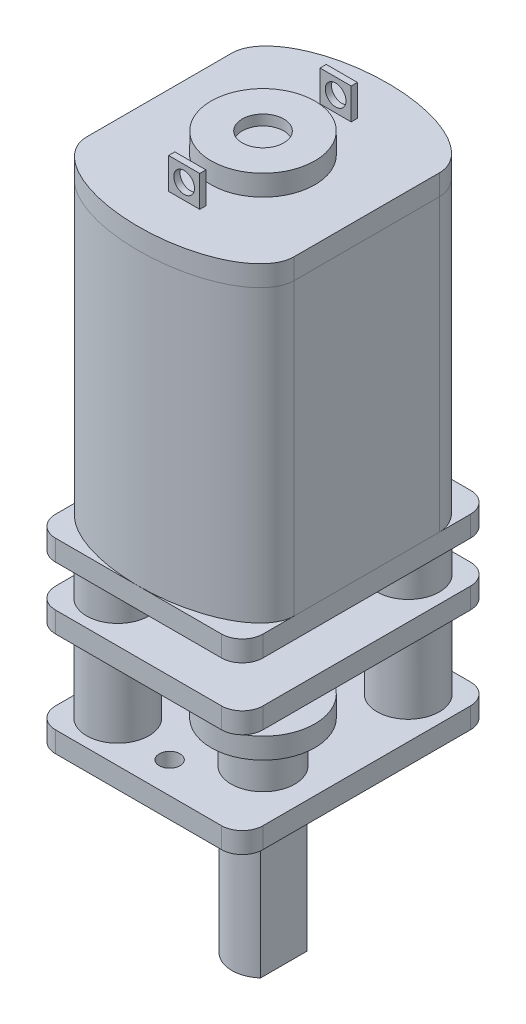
ISO-10303-21;
HEADER;
FILE_DESCRIPTION(('STEP AP214'),'2;1');
FILE_NAME('part.step','',(''),(''),'','','');
FILE_SCHEMA(('AUTOMOTIVE_DESIGN { 1 0 10303 214 1 1 1 1 }'));
ENDSEC;
DATA;
#1=APPLICATION_CONTEXT('core data for automotive mechanical design processes');
#2=APPLICATION_PROTOCOL_DEFINITION('international standard','automotive_design',2000,#1);
#3=PRODUCT_CONTEXT('',#1,'mechanical');
#4=PRODUCT('Part','Part','',(#3));
#5=PRODUCT_RELATED_PRODUCT_CATEGORY('part','',(#4));
#6=PRODUCT_DEFINITION_FORMATION('','',#4);
#7=PRODUCT_DEFINITION_CONTEXT('part definition',#1,'design');
#8=PRODUCT_DEFINITION('design','',#6,#7);
#9=PRODUCT_DEFINITION_SHAPE('','',#8);
#10=(LENGTH_UNIT() NAMED_UNIT(*) SI_UNIT(.MILLI.,.METRE.));
#11=(NAMED_UNIT(*) PLANE_ANGLE_UNIT() SI_UNIT($,.RADIAN.));
#12=(NAMED_UNIT(*) SI_UNIT($,.STERADIAN.) SOLID_ANGLE_UNIT());
#13=UNCERTAINTY_MEASURE_WITH_UNIT(LENGTH_MEASURE(1.E-05),#10,'distance_accuracy_value','');
#14=(GEOMETRIC_REPRESENTATION_CONTEXT(3) GLOBAL_UNCERTAINTY_ASSIGNED_CONTEXT((#13)) GLOBAL_UNIT_ASSIGNED_CONTEXT((#10,
#11,#12)) REPRESENTATION_CONTEXT('',''));
#15=CARTESIAN_POINT('',(0.,0.,0.));
#16=DIRECTION('',(0.,0.,1.));
#17=DIRECTION('',(1.,0.,0.));
#18=AXIS2_PLACEMENT_3D('',#15,#16,#17);
#19=CARTESIAN_POINT('',(2.5,0.999999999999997,2.5));
#20=DIRECTION('',(0.,1.,0.));
#21=DIRECTION('',(0.,0.,-1.));
#22=AXIS2_PLACEMENT_3D('',#19,#20,#21);
#23=CYLINDRICAL_SURFACE('',#22,1.53553390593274);
#24=CARTESIAN_POINT('',(2.5,0.999999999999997,2.5));
#25=DIRECTION('',(0.,-1.,0.));
#26=DIRECTION('',(0.,0.,1.));
#27=AXIS2_PLACEMENT_3D('',#24,#25,#26);
#28=CIRCLE('',#27,1.53553390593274);
#29=CARTESIAN_POINT('',(2.5,0.999999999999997,4.03553390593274));
#30=VERTEX_POINT('',#29);
#31=EDGE_CURVE('P0_E10',#30,#30,#28,.T.);
#32=ORIENTED_EDGE('',*,*,#31,.F.);
#33=EDGE_LOOP('',(#32));
#34=FACE_BOUND('',#33,.T.);
#35=CARTESIAN_POINT('',(2.5,3.,2.5));
#36=DIRECTION('',(0.,-1.,0.));
#37=DIRECTION('',(0.,0.,1.));
#38=AXIS2_PLACEMENT_3D('',#35,#36,#37);
#39=CIRCLE('',#38,1.53553390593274);
#40=CARTESIAN_POINT('',(2.5,3.,4.03553390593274));
#41=VERTEX_POINT('',#40);
#42=EDGE_CURVE('P0_E18',#41,#41,#39,.T.);
#43=ORIENTED_EDGE('',*,*,#42,.T.);
#44=EDGE_LOOP('',(#43));
#45=FACE_BOUND('',#44,.T.);
#46=ADVANCED_FACE('P0_F15',(#34,#45),#23,.T.);
#47=CARTESIAN_POINT('',(2.5,0.999999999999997,2.5));
#48=DIRECTION('',(0.,-1.,0.));
#49=DIRECTION('',(0.,0.,1.));
#50=AXIS2_PLACEMENT_3D('',#47,#48,#49);
#51=PLANE('',#50);
#52=ORIENTED_EDGE('',*,*,#31,.T.);
#53=EDGE_LOOP('',(#52));
#54=FACE_BOUND('',#53,.T.);
#55=ADVANCED_FACE('P0_F30',(#54),#51,.T.);
#56=CARTESIAN_POINT('',(2.5,3.,2.5));
#57=DIRECTION('',(0.,-1.,0.));
#58=DIRECTION('',(0.,0.,1.));
#59=AXIS2_PLACEMENT_3D('',#56,#57,#58);
#60=PLANE('',#59);
#61=ORIENTED_EDGE('',*,*,#42,.F.);
#62=EDGE_LOOP('',(#61));
#63=FACE_BOUND('',#62,.T.);
#64=ADVANCED_FACE('P0_F28',(#63),#60,.F.);
#65=CLOSED_SHELL('',(#46,#55,#64));
#66=MANIFOLD_SOLID_BREP('P0_B1',#65);
#67=CARTESIAN_POINT('',(-1.5,8.,-3.));
#68=DIRECTION('',(0.,-1.,0.));
#69=DIRECTION('',(0.,0.,1.));
#70=AXIS2_PLACEMENT_3D('',#67,#68,#69);
#71=CYLINDRICAL_SURFACE('',#70,0.2);
#72=CARTESIAN_POINT('',(-1.5,8.,-3.));
#73=DIRECTION('',(0.,-1.,0.));
#74=DIRECTION('',(0.,0.,1.));
#75=AXIS2_PLACEMENT_3D('',#72,#73,#74);
#76=CIRCLE('',#75,0.2);
#77=CARTESIAN_POINT('',(-1.5,8.,-2.8));
#78=VERTEX_POINT('',#77);
#79=EDGE_CURVE('P1_E10',#78,#78,#76,.T.);
#80=ORIENTED_EDGE('',*,*,#79,.T.);
#81=EDGE_LOOP('',(#80));
#82=FACE_BOUND('',#81,.T.);
#83=CARTESIAN_POINT('',(-1.5,1.,-3.));
#84=DIRECTION('',(0.,-1.,0.));
#85=DIRECTION('',(0.,0.,1.));
#86=AXIS2_PLACEMENT_3D('',#83,#84,#85);
#87=CIRCLE('',#86,0.2);
#88=CARTESIAN_POINT('',(-1.5,1.,-2.8));
#89=VERTEX_POINT('',#88);
#90=EDGE_CURVE('P1_E21',#89,#89,#87,.T.);
#91=ORIENTED_EDGE('',*,*,#90,.F.);
#92=EDGE_LOOP('',(#91));
#93=FACE_BOUND('',#92,.T.);
#94=ADVANCED_FACE('P1_F15',(#82,#93),#71,.T.);
#95=CARTESIAN_POINT('',(-1.5,8.,-3.));
#96=DIRECTION('',(0.,-1.,0.));
#97=DIRECTION('',(0.,0.,1.));
#98=AXIS2_PLACEMENT_3D('',#95,#96,#97);
#99=PLANE('',#98);
#100=ORIENTED_EDGE('',*,*,#79,.F.);
#101=EDGE_LOOP('',(#100));
#102=FACE_BOUND('',#101,.T.);
#103=ADVANCED_FACE('P1_F30',(#102),#99,.F.);
#104=CARTESIAN_POINT('',(-1.5,1.,-3.));
#105=DIRECTION('',(0.,-1.,0.));
#106=DIRECTION('',(0.,0.,1.));
#107=AXIS2_PLACEMENT_3D('',#104,#105,#106);
#108=PLANE('',#107);
#109=ORIENTED_EDGE('',*,*,#90,.T.);
#110=EDGE_LOOP('',(#109));
#111=FACE_BOUND('',#110,.T.);
#112=ADVANCED_FACE('P1_F27',(#111),#108,.T.);
#113=CLOSED_SHELL('',(#94,#103,#112));
#114=MANIFOLD_SOLID_BREP('P1_B1',#113);
#115=CARTESIAN_POINT('',(0.,3.,0.));
#116=DIRECTION('',(0.,1.,0.));
#117=DIRECTION('',(0.,0.,-1.));
#118=AXIS2_PLACEMENT_3D('',#115,#116,#117);
#119=CYLINDRICAL_SURFACE('',#118,1.);
#120=CARTESIAN_POINT('',(0.,3.,0.));
#121=DIRECTION('',(0.,-1.,0.));
#122=DIRECTION('',(0.,0.,1.));
#123=AXIS2_PLACEMENT_3D('',#120,#121,#122);
#124=CIRCLE('',#123,1.);
#125=CARTESIAN_POINT('',(0.,3.,1.));
#126=VERTEX_POINT('',#125);
#127=EDGE_CURVE('P2_E10',#126,#126,#124,.T.);
#128=ORIENTED_EDGE('',*,*,#127,.F.);
#129=EDGE_LOOP('',(#128));
#130=FACE_BOUND('',#129,.T.);
#131=CARTESIAN_POINT('',(0.,4.,0.));
#132=DIRECTION('',(0.,-1.,0.));
#133=DIRECTION('',(0.,0.,1.));
#134=AXIS2_PLACEMENT_3D('',#131,#132,#133);
#135=CIRCLE('',#134,1.);
#136=CARTESIAN_POINT('',(0.,4.,1.));
#137=VERTEX_POINT('',#136);
#138=EDGE_CURVE('P2_E18',#137,#137,#135,.T.);
#139=ORIENTED_EDGE('',*,*,#138,.T.);
#140=EDGE_LOOP('',(#139));
#141=FACE_BOUND('',#140,.T.);
#142=ADVANCED_FACE('P2_F15',(#130,#141),#119,.T.);
#143=CARTESIAN_POINT('',(0.,3.,0.));
#144=DIRECTION('',(0.,-1.,0.));
#145=DIRECTION('',(0.,0.,1.));
#146=AXIS2_PLACEMENT_3D('',#143,#144,#145);
#147=PLANE('',#146);
#148=ORIENTED_EDGE('',*,*,#127,.T.);
#149=EDGE_LOOP('',(#148));
#150=FACE_BOUND('',#149,.T.);
#151=ADVANCED_FACE('P2_F30',(#150),#147,.T.);
#152=CARTESIAN_POINT('',(0.,4.,0.));
#153=DIRECTION('',(0.,-1.,0.));
#154=DIRECTION('',(0.,0.,1.));
#155=AXIS2_PLACEMENT_3D('',#152,#153,#154);
#156=PLANE('',#155);
#157=ORIENTED_EDGE('',*,*,#138,.F.);
#158=EDGE_LOOP('',(#157));
#159=FACE_BOUND('',#158,.T.);
#160=ADVANCED_FACE('P2_F28',(#159),#156,.F.);
#161=CLOSED_SHELL('',(#142,#151,#160));
#162=MANIFOLD_SOLID_BREP('P2_B1',#161);
#163=CARTESIAN_POINT('',(2.5,3.,2.5));
#164=DIRECTION('',(0.,1.,0.));
#165=DIRECTION('',(0.,0.,-1.));
#166=AXIS2_PLACEMENT_3D('',#163,#164,#165);
#167=CYLINDRICAL_SURFACE('',#166,2.5);
#168=CARTESIAN_POINT('',(2.5,3.,2.5));
#169=DIRECTION('',(0.,-1.,0.));
#170=DIRECTION('',(0.,0.,1.));
#171=AXIS2_PLACEMENT_3D('',#168,#169,#170);
#172=CIRCLE('',#171,2.5);
#173=CARTESIAN_POINT('',(2.5,3.,5.));
#174=VERTEX_POINT('',#173);
#175=EDGE_CURVE('P3_E10',#174,#174,#172,.T.);
#176=ORIENTED_EDGE('',*,*,#175,.F.);
#177=EDGE_LOOP('',(#176));
#178=FACE_BOUND('',#177,.T.);
#179=CARTESIAN_POINT('',(2.5,4.,2.5));
#180=DIRECTION('',(0.,-1.,0.));
#181=DIRECTION('',(0.,0.,1.));
#182=AXIS2_PLACEMENT_3D('',#179,#180,#181);
#183=CIRCLE('',#182,2.5);
#184=CARTESIAN_POINT('',(2.5,4.,5.));
#185=VERTEX_POINT('',#184);
#186=EDGE_CURVE('P3_E18',#185,#185,#183,.T.);
#187=ORIENTED_EDGE('',*,*,#186,.T.);
#188=EDGE_LOOP('',(#187));
#189=FACE_BOUND('',#188,.T.);
#190=ADVANCED_FACE('P3_F15',(#178,#189),#167,.T.);
#191=CARTESIAN_POINT('',(2.5,3.,2.5));
#192=DIRECTION('',(0.,-1.,0.));
#193=DIRECTION('',(0.,0.,1.));
#194=AXIS2_PLACEMENT_3D('',#191,#192,#193);
#195=PLANE('',#194);
#196=ORIENTED_EDGE('',*,*,#175,.T.);
#197=EDGE_LOOP('',(#196));
#198=FACE_BOUND('',#197,.T.);
#199=ADVANCED_FACE('P3_F30',(#198),#195,.T.);
#200=CARTESIAN_POINT('',(2.5,4.,2.5));
#201=DIRECTION('',(0.,-1.,0.));
#202=DIRECTION('',(0.,0.,1.));
#203=AXIS2_PLACEMENT_3D('',#200,#201,#202);
#204=PLANE('',#203);
#205=ORIENTED_EDGE('',*,*,#186,.F.);
#206=EDGE_LOOP('',(#205));
#207=FACE_BOUND('',#206,.T.);
#208=ADVANCED_FACE('P3_F28',(#207),#204,.F.);
#209=CLOSED_SHELL('',(#190,#199,#208));
#210=MANIFOLD_SOLID_BREP('P3_B1',#209);
#211=CARTESIAN_POINT('',(0.,1.,0.));
#212=DIRECTION('',(0.,1.,0.));
#213=DIRECTION('',(1.,0.,0.));
#214=AXIS2_PLACEMENT_3D('',#211,#212,#213);
#215=CYLINDRICAL_SURFACE('',#214,2.);
#216=CARTESIAN_POINT('',(0.,1.,0.));
#217=DIRECTION('',(0.,-1.,0.));
#218=DIRECTION('',(-1.,0.,0.));
#219=AXIS2_PLACEMENT_3D('',#216,#217,#218);
#220=CIRCLE('',#219,2.);
#221=CARTESIAN_POINT('',(-2.,1.,0.));
#222=VERTEX_POINT('',#221);
#223=EDGE_CURVE('P4_E10',#222,#222,#220,.T.);
#224=ORIENTED_EDGE('',*,*,#223,.F.);
#225=EDGE_LOOP('',(#224));
#226=FACE_BOUND('',#225,.T.);
#227=CARTESIAN_POINT('',(0.,3.,0.));
#228=DIRECTION('',(0.,-1.,0.));
#229=DIRECTION('',(-1.,0.,0.));
#230=AXIS2_PLACEMENT_3D('',#227,#228,#229);
#231=CIRCLE('',#230,2.);
#232=CARTESIAN_POINT('',(-2.,3.,0.));
#233=VERTEX_POINT('',#232);
#234=EDGE_CURVE('P4_E18',#233,#233,#231,.T.);
#235=ORIENTED_EDGE('',*,*,#234,.T.);
#236=EDGE_LOOP('',(#235));
#237=FACE_BOUND('',#236,.T.);
#238=ADVANCED_FACE('P4_F15',(#226,#237),#215,.T.);
#239=CARTESIAN_POINT('',(0.,1.,0.));
#240=DIRECTION('',(0.,-1.,0.));
#241=DIRECTION('',(-1.,0.,0.));
#242=AXIS2_PLACEMENT_3D('',#239,#240,#241);
#243=PLANE('',#242);
#244=CARTESIAN_POINT('',(0.,1.,0.));
#245=DIRECTION('',(0.,1.,0.));
#246=DIRECTION('',(1.,0.,0.));
#247=AXIS2_PLACEMENT_3D('',#244,#245,#246);
#248=CIRCLE('',#247,0.2);
#249=CARTESIAN_POINT('',(0.199999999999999,1.,0.));
#250=VERTEX_POINT('',#249);
#251=EDGE_CURVE('P4_E25',#250,#250,#248,.T.);
#252=ORIENTED_EDGE('',*,*,#251,.T.);
#253=EDGE_LOOP('',(#252));
#254=FACE_BOUND('',#253,.T.);
#255=ORIENTED_EDGE('',*,*,#223,.T.);
#256=EDGE_LOOP('',(#255));
#257=FACE_BOUND('',#256,.T.);
#258=ADVANCED_FACE('P4_F33',(#254,#257),#243,.T.);
#259=CARTESIAN_POINT('',(0.,3.,0.));
#260=DIRECTION('',(0.,-1.,0.));
#261=DIRECTION('',(-1.,0.,0.));
#262=AXIS2_PLACEMENT_3D('',#259,#260,#261);
#263=PLANE('',#262);
#264=CARTESIAN_POINT('',(0.,3.,0.));
#265=DIRECTION('',(0.,1.,0.));
#266=DIRECTION('',(1.,0.,0.));
#267=AXIS2_PLACEMENT_3D('',#264,#265,#266);
#268=CIRCLE('',#267,0.2);
#269=CARTESIAN_POINT('',(0.199999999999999,3.,0.));
#270=VERTEX_POINT('',#269);
#271=EDGE_CURVE('P4_E27',#270,#270,#268,.T.);
#272=ORIENTED_EDGE('',*,*,#271,.F.);
#273=EDGE_LOOP('',(#272));
#274=FACE_BOUND('',#273,.T.);
#275=ORIENTED_EDGE('',*,*,#234,.F.);
#276=EDGE_LOOP('',(#275));
#277=FACE_BOUND('',#276,.T.);
#278=ADVANCED_FACE('P4_F38',(#274,#277),#263,.F.);
#279=CARTESIAN_POINT('',(0.,1.,0.));
#280=DIRECTION('',(0.,1.,0.));
#281=DIRECTION('',(1.,0.,0.));
#282=AXIS2_PLACEMENT_3D('',#279,#280,#281);
#283=CYLINDRICAL_SURFACE('',#282,0.2);
#284=ORIENTED_EDGE('',*,*,#251,.F.);
#285=EDGE_LOOP('',(#284));
#286=FACE_BOUND('',#285,.T.);
#287=ORIENTED_EDGE('',*,*,#271,.T.);
#288=EDGE_LOOP('',(#287));
#289=FACE_BOUND('',#288,.T.);
#290=ADVANCED_FACE('P4_F35',(#286,#289),#283,.F.);
#291=CLOSED_SHELL('',(#238,#258,#278,#290));
#292=MANIFOLD_SOLID_BREP('P4_B1',#291);
#293=CARTESIAN_POINT('',(0.999999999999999,1.,0.));
#294=DIRECTION('',(-1.,0.,0.));
#295=DIRECTION('',(0.,0.,-1.));
#296=AXIS2_PLACEMENT_3D('',#293,#294,#295);
#297=PLANE('',#296);
#298=DIRECTION('',(0.,0.,-1.));
#299=VECTOR('',#298,1.);
#300=CARTESIAN_POINT('',(0.999999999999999,0.,0.));
#301=LINE('',#300,#299);
#302=CARTESIAN_POINT('',(0.999999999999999,0.,1.1180339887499));
#303=VERTEX_POINT('',#302);
#304=CARTESIAN_POINT('',(0.999999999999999,0.,-1.1180339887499));
#305=VERTEX_POINT('',#304);
#306=EDGE_CURVE('P5_E10',#303,#305,#301,.T.);
#307=ORIENTED_EDGE('',*,*,#306,.F.);
#308=DIRECTION('',(0.,-1.,0.));
#309=VECTOR('',#308,1.);
#310=CARTESIAN_POINT('',(0.999999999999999,1.,1.1180339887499));
#311=LINE('',#310,#309);
#312=CARTESIAN_POINT('',(0.999999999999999,-9.3,1.1180339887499));
#313=VERTEX_POINT('',#312);
#314=EDGE_CURVE('P5_E31',#303,#313,#311,.T.);
#315=ORIENTED_EDGE('',*,*,#314,.T.);
#316=DIRECTION('',(0.,0.,-1.));
#317=VECTOR('',#316,1.);
#318=CARTESIAN_POINT('',(0.999999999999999,-9.3,0.));
#319=LINE('',#318,#317);
#320=CARTESIAN_POINT('',(1.,-9.3,-1.11803398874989));
#321=VERTEX_POINT('',#320);
#322=EDGE_CURVE('P5_E47',#313,#321,#319,.T.);
#323=ORIENTED_EDGE('',*,*,#322,.T.);
#324=DIRECTION('',(0.,-1.,0.));
#325=VECTOR('',#324,1.);
#326=CARTESIAN_POINT('',(0.999999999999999,1.,-1.11803398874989));
#327=LINE('',#326,#325);
#328=EDGE_CURVE('P5_E39',#305,#321,#327,.T.);
#329=ORIENTED_EDGE('',*,*,#328,.F.);
#330=EDGE_LOOP('',(#307,#315,#323,#329));
#331=FACE_BOUND('',#330,.T.);
#332=ADVANCED_FACE('P5_F16',(#331),#297,.F.);
#333=CARTESIAN_POINT('',(0.,-9.3,0.));
#334=DIRECTION('',(0.,1.,0.));
#335=DIRECTION('',(1.,0.,0.));
#336=AXIS2_PLACEMENT_3D('',#333,#334,#335);
#337=CYLINDRICAL_SURFACE('',#336,1.5);
#338=CARTESIAN_POINT('',(0.,0.,0.));
#339=DIRECTION('',(0.,1.,0.));
#340=DIRECTION('',(-1.,0.,0.));
#341=AXIS2_PLACEMENT_3D('',#338,#339,#340);
#342=CIRCLE('',#341,1.5);
#343=EDGE_CURVE('P5_E45',#303,#305,#342,.T.);
#344=ORIENTED_EDGE('',*,*,#343,.T.);
#345=ORIENTED_EDGE('',*,*,#328,.T.);
#346=CARTESIAN_POINT('',(0.,-9.3,0.));
#347=DIRECTION('',(0.,-1.,0.));
#348=DIRECTION('',(-1.,0.,0.));
#349=AXIS2_PLACEMENT_3D('',#346,#347,#348);
#350=CIRCLE('',#349,1.5);
#351=EDGE_CURVE('P5_E24',#313,#321,#350,.T.);
#352=ORIENTED_EDGE('',*,*,#351,.F.);
#353=ORIENTED_EDGE('',*,*,#314,.F.);
#354=EDGE_LOOP('',(#344,#345,#352,#353));
#355=FACE_BOUND('',#354,.T.);
#356=CARTESIAN_POINT('',(0.,1.,0.));
#357=DIRECTION('',(0.,-1.,0.));
#358=DIRECTION('',(-1.,0.,0.));
#359=AXIS2_PLACEMENT_3D('',#356,#357,#358);
#360=CIRCLE('',#359,1.5);
#361=CARTESIAN_POINT('',(-1.5,1.,0.));
#362=VERTEX_POINT('',#361);
#363=EDGE_CURVE('P5_E51',#362,#362,#360,.T.);
#364=ORIENTED_EDGE('',*,*,#363,.T.);
#365=EDGE_LOOP('',(#364));
#366=FACE_BOUND('',#365,.T.);
#367=ADVANCED_FACE('P5_F18',(#355,#366),#337,.T.);
#368=CARTESIAN_POINT('',(0.,-9.3,0.));
#369=DIRECTION('',(0.,-1.,0.));
#370=DIRECTION('',(-1.,0.,0.));
#371=AXIS2_PLACEMENT_3D('',#368,#369,#370);
#372=PLANE('',#371);
#373=ORIENTED_EDGE('',*,*,#322,.F.);
#374=ORIENTED_EDGE('',*,*,#351,.T.);
#375=EDGE_LOOP('',(#373,#374));
#376=FACE_BOUND('',#375,.T.);
#377=ADVANCED_FACE('P5_F58',(#376),#372,.T.);
#378=CARTESIAN_POINT('',(0.,1.,0.));
#379=DIRECTION('',(0.,-1.,0.));
#380=DIRECTION('',(-1.,0.,0.));
#381=AXIS2_PLACEMENT_3D('',#378,#379,#380);
#382=PLANE('',#381);
#383=ORIENTED_EDGE('',*,*,#363,.F.);
#384=EDGE_LOOP('',(#383));
#385=FACE_BOUND('',#384,.T.);
#386=ADVANCED_FACE('P5_F60',(#385),#382,.F.);
#387=CARTESIAN_POINT('',(0.,0.,0.));
#388=DIRECTION('',(0.,1.,0.));
#389=DIRECTION('',(-1.,0.,0.));
#390=AXIS2_PLACEMENT_3D('',#387,#388,#389);
#391=PLANE('',#390);
#392=ORIENTED_EDGE('',*,*,#343,.F.);
#393=ORIENTED_EDGE('',*,*,#306,.T.);
#394=EDGE_LOOP('',(#392,#393));
#395=FACE_BOUND('',#394,.T.);
#396=ADVANCED_FACE('P5_F46',(#395),#391,.F.);
#397=CLOSED_SHELL('',(#332,#367,#377,#386,#396));
#398=MANIFOLD_SOLID_BREP('P5_B1',#397);
#399=CARTESIAN_POINT('',(2.5,5.,2.5));
#400=DIRECTION('',(0.,-1.,0.));
#401=DIRECTION('',(0.,0.,1.));
#402=AXIS2_PLACEMENT_3D('',#399,#400,#401);
#403=CYLINDRICAL_SURFACE('',#402,0.2);
#404=CARTESIAN_POINT('',(2.5,5.,2.5));
#405=DIRECTION('',(0.,-1.,0.));
#406=DIRECTION('',(0.,0.,1.));
#407=AXIS2_PLACEMENT_3D('',#404,#405,#406);
#408=CIRCLE('',#407,0.2);
#409=CARTESIAN_POINT('',(2.5,5.,2.7));
#410=VERTEX_POINT('',#409);
#411=EDGE_CURVE('P6_E10',#410,#410,#408,.T.);
#412=ORIENTED_EDGE('',*,*,#411,.T.);
#413=EDGE_LOOP('',(#412));
#414=FACE_BOUND('',#413,.T.);
#415=CARTESIAN_POINT('',(2.5,0.999999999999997,2.5));
#416=DIRECTION('',(0.,-1.,0.));
#417=DIRECTION('',(0.,0.,1.));
#418=AXIS2_PLACEMENT_3D('',#415,#416,#417);
#419=CIRCLE('',#418,0.2);
#420=CARTESIAN_POINT('',(2.5,0.999999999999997,2.7));
#421=VERTEX_POINT('',#420);
#422=EDGE_CURVE('P6_E18',#421,#421,#419,.T.);
#423=ORIENTED_EDGE('',*,*,#422,.F.);
#424=EDGE_LOOP('',(#423));
#425=FACE_BOUND('',#424,.T.);
#426=ADVANCED_FACE('P6_F15',(#414,#425),#403,.T.);
#427=CARTESIAN_POINT('',(2.5,5.,2.5));
#428=DIRECTION('',(0.,-1.,0.));
#429=DIRECTION('',(0.,0.,1.));
#430=AXIS2_PLACEMENT_3D('',#427,#428,#429);
#431=PLANE('',#430);
#432=ORIENTED_EDGE('',*,*,#411,.F.);
#433=EDGE_LOOP('',(#432));
#434=FACE_BOUND('',#433,.T.);
#435=ADVANCED_FACE('P6_F30',(#434),#431,.F.);
#436=CARTESIAN_POINT('',(2.5,0.999999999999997,2.5));
#437=DIRECTION('',(0.,-1.,0.));
#438=DIRECTION('',(0.,0.,1.));
#439=AXIS2_PLACEMENT_3D('',#436,#437,#438);
#440=PLANE('',#439);
#441=ORIENTED_EDGE('',*,*,#422,.T.);
#442=EDGE_LOOP('',(#441));
#443=FACE_BOUND('',#442,.T.);
#444=ADVANCED_FACE('P6_F27',(#443),#440,.T.);
#445=CLOSED_SHELL('',(#426,#435,#444));
#446=MANIFOLD_SOLID_BREP('P6_B1',#445);
#447=CARTESIAN_POINT('',(0.,0.999999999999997,0.));
#448=DIRECTION('',(0.,1.,0.));
#449=DIRECTION('',(0.,0.,-1.));
#450=AXIS2_PLACEMENT_3D('',#447,#448,#449);
#451=CYLINDRICAL_SURFACE('',#450,0.2);
#452=CARTESIAN_POINT('',(0.,0.999999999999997,0.));
#453=DIRECTION('',(0.,-1.,0.));
#454=DIRECTION('',(0.,0.,1.));
#455=AXIS2_PLACEMENT_3D('',#452,#453,#454);
#456=CIRCLE('',#455,0.2);
#457=CARTESIAN_POINT('',(0.,0.999999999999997,0.2));
#458=VERTEX_POINT('',#457);
#459=EDGE_CURVE('P7_E10',#458,#458,#456,.T.);
#460=ORIENTED_EDGE('',*,*,#459,.F.);
#461=EDGE_LOOP('',(#460));
#462=FACE_BOUND('',#461,.T.);
#463=CARTESIAN_POINT('',(0.,3.,0.));
#464=DIRECTION('',(0.,-1.,0.));
#465=DIRECTION('',(0.,0.,1.));
#466=AXIS2_PLACEMENT_3D('',#463,#464,#465);
#467=CIRCLE('',#466,0.2);
#468=CARTESIAN_POINT('',(0.,3.,0.2));
#469=VERTEX_POINT('',#468);
#470=EDGE_CURVE('P7_E18',#469,#469,#467,.T.);
#471=ORIENTED_EDGE('',*,*,#470,.T.);
#472=EDGE_LOOP('',(#471));
#473=FACE_BOUND('',#472,.T.);
#474=ADVANCED_FACE('P7_F15',(#462,#473),#451,.T.);
#475=CARTESIAN_POINT('',(0.,0.999999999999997,0.));
#476=DIRECTION('',(0.,-1.,0.));
#477=DIRECTION('',(0.,0.,1.));
#478=AXIS2_PLACEMENT_3D('',#475,#476,#477);
#479=PLANE('',#478);
#480=ORIENTED_EDGE('',*,*,#459,.T.);
#481=EDGE_LOOP('',(#480));
#482=FACE_BOUND('',#481,.T.);
#483=ADVANCED_FACE('P7_F30',(#482),#479,.T.);
#484=CARTESIAN_POINT('',(0.,3.,0.));
#485=DIRECTION('',(0.,-1.,0.));
#486=DIRECTION('',(0.,0.,1.));
#487=AXIS2_PLACEMENT_3D('',#484,#485,#486);
#488=PLANE('',#487);
#489=ORIENTED_EDGE('',*,*,#470,.F.);
#490=EDGE_LOOP('',(#489));
#491=FACE_BOUND('',#490,.T.);
#492=ADVANCED_FACE('P7_F28',(#491),#488,.F.);
#493=CLOSED_SHELL('',(#474,#483,#492));
#494=MANIFOLD_SOLID_BREP('P7_B1',#493);
#495=CARTESIAN_POINT('',(0.,4.,0.));
#496=DIRECTION('',(0.,1.,0.));
#497=DIRECTION('',(0.,0.,-1.));
#498=AXIS2_PLACEMENT_3D('',#495,#496,#497);
#499=CYLINDRICAL_SURFACE('',#498,1.85410196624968);
#500=CARTESIAN_POINT('',(0.,4.,0.));
#501=DIRECTION('',(0.,-1.,0.));
#502=DIRECTION('',(0.,0.,1.));
#503=AXIS2_PLACEMENT_3D('',#500,#501,#502);
#504=CIRCLE('',#503,1.85410196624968);
#505=CARTESIAN_POINT('',(0.,4.,1.85410196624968));
#506=VERTEX_POINT('',#505);
#507=EDGE_CURVE('P8_E10',#506,#506,#504,.T.);
#508=ORIENTED_EDGE('',*,*,#507,.F.);
#509=EDGE_LOOP('',(#508));
#510=FACE_BOUND('',#509,.T.);
#511=CARTESIAN_POINT('',(0.,5.,0.));
#512=DIRECTION('',(0.,-1.,0.));
#513=DIRECTION('',(0.,0.,1.));
#514=AXIS2_PLACEMENT_3D('',#511,#512,#513);
#515=CIRCLE('',#514,1.85410196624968);
#516=CARTESIAN_POINT('',(0.,5.,1.85410196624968));
#517=VERTEX_POINT('',#516);
#518=EDGE_CURVE('P8_E18',#517,#517,#515,.T.);
#519=ORIENTED_EDGE('',*,*,#518,.T.);
#520=EDGE_LOOP('',(#519));
#521=FACE_BOUND('',#520,.T.);
#522=ADVANCED_FACE('P8_F15',(#510,#521),#499,.T.);
#523=CARTESIAN_POINT('',(0.,4.,0.));
#524=DIRECTION('',(0.,-1.,0.));
#525=DIRECTION('',(0.,0.,1.));
#526=AXIS2_PLACEMENT_3D('',#523,#524,#525);
#527=PLANE('',#526);
#528=ORIENTED_EDGE('',*,*,#507,.T.);
#529=EDGE_LOOP('',(#528));
#530=FACE_BOUND('',#529,.T.);
#531=ADVANCED_FACE('P8_F30',(#530),#527,.T.);
#532=CARTESIAN_POINT('',(0.,5.,0.));
#533=DIRECTION('',(0.,-1.,0.));
#534=DIRECTION('',(0.,0.,1.));
#535=AXIS2_PLACEMENT_3D('',#532,#533,#534);
#536=PLANE('',#535);
#537=ORIENTED_EDGE('',*,*,#518,.F.);
#538=EDGE_LOOP('',(#537));
#539=FACE_BOUND('',#538,.T.);
#540=ADVANCED_FACE('P8_F28',(#539),#536,.F.);
#541=CLOSED_SHELL('',(#522,#531,#540));
#542=MANIFOLD_SOLID_BREP('P8_B1',#541);
#543=CARTESIAN_POINT('',(-1.5,6.,-3.));
#544=DIRECTION('',(0.,-1.,0.));
#545=DIRECTION('',(0.,0.,1.));
#546=AXIS2_PLACEMENT_3D('',#543,#544,#545);
#547=PLANE('',#546);
#548=CARTESIAN_POINT('',(-1.5,6.,-3.));
#549=DIRECTION('',(0.,-1.,0.));
#550=DIRECTION('',(0.,0.,1.));
#551=AXIS2_PLACEMENT_3D('',#548,#549,#550);
#552=CIRCLE('',#551,2.35410196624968);
#553=CARTESIAN_POINT('',(-1.5,6.,-0.645898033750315));
#554=VERTEX_POINT('',#553);
#555=EDGE_CURVE('P9_E10',#554,#554,#552,.T.);
#556=ORIENTED_EDGE('',*,*,#555,.T.);
#557=EDGE_LOOP('',(#556));
#558=FACE_BOUND('',#557,.T.);
#559=CARTESIAN_POINT('',(-1.5,6.,-3.));
#560=DIRECTION('',(0.,-1.,0.));
#561=DIRECTION('',(0.,0.,1.));
#562=AXIS2_PLACEMENT_3D('',#559,#560,#561);
#563=CIRCLE('',#562,1.5);
#564=CARTESIAN_POINT('',(-1.5,6.,-1.5));
#565=VERTEX_POINT('',#564);
#566=EDGE_CURVE('P9_E28',#565,#565,#563,.T.);
#567=ORIENTED_EDGE('',*,*,#566,.F.);
#568=EDGE_LOOP('',(#567));
#569=FACE_BOUND('',#568,.T.);
#570=ADVANCED_FACE('P9_F15',(#558,#569),#547,.T.);
#571=CARTESIAN_POINT('',(-1.5,6.,-3.));
#572=DIRECTION('',(0.,1.,0.));
#573=DIRECTION('',(0.,0.,-1.));
#574=AXIS2_PLACEMENT_3D('',#571,#572,#573);
#575=CYLINDRICAL_SURFACE('',#574,2.35410196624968);
#576=ORIENTED_EDGE('',*,*,#555,.F.);
#577=EDGE_LOOP('',(#576));
#578=FACE_BOUND('',#577,.T.);
#579=CARTESIAN_POINT('',(-1.5,7.,-3.));
#580=DIRECTION('',(0.,-1.,0.));
#581=DIRECTION('',(0.,0.,1.));
#582=AXIS2_PLACEMENT_3D('',#579,#580,#581);
#583=CIRCLE('',#582,2.35410196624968);
#584=CARTESIAN_POINT('',(-1.5,7.,-0.645898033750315));
#585=VERTEX_POINT('',#584);
#586=EDGE_CURVE('P9_E19',#585,#585,#583,.T.);
#587=ORIENTED_EDGE('',*,*,#586,.T.);
#588=EDGE_LOOP('',(#587));
#589=FACE_BOUND('',#588,.T.);
#590=ADVANCED_FACE('P9_F17',(#578,#589),#575,.T.);
#591=CARTESIAN_POINT('',(-1.5,7.,-3.));
#592=DIRECTION('',(0.,-1.,0.));
#593=DIRECTION('',(0.,0.,1.));
#594=AXIS2_PLACEMENT_3D('',#591,#592,#593);
#595=PLANE('',#594);
#596=ORIENTED_EDGE('',*,*,#586,.F.);
#597=EDGE_LOOP('',(#596));
#598=FACE_BOUND('',#597,.T.);
#599=ADVANCED_FACE('P9_F39',(#598),#595,.F.);
#600=CARTESIAN_POINT('',(-1.5,3.,-3.));
#601=DIRECTION('',(0.,1.,0.));
#602=DIRECTION('',(0.,0.,-1.));
#603=AXIS2_PLACEMENT_3D('',#600,#601,#602);
#604=CYLINDRICAL_SURFACE('',#603,1.5);
#605=CARTESIAN_POINT('',(-1.5,3.,-3.));
#606=DIRECTION('',(0.,-1.,0.));
#607=DIRECTION('',(0.,0.,1.));
#608=AXIS2_PLACEMENT_3D('',#605,#606,#607);
#609=CIRCLE('',#608,1.5);
#610=CARTESIAN_POINT('',(-1.5,3.,-1.5));
#611=VERTEX_POINT('',#610);
#612=EDGE_CURVE('P9_E26',#611,#611,#609,.T.);
#613=ORIENTED_EDGE('',*,*,#612,.F.);
#614=EDGE_LOOP('',(#613));
#615=FACE_BOUND('',#614,.T.);
#616=ORIENTED_EDGE('',*,*,#566,.T.);
#617=EDGE_LOOP('',(#616));
#618=FACE_BOUND('',#617,.T.);
#619=ADVANCED_FACE('P9_F36',(#615,#618),#604,.T.);
#620=CARTESIAN_POINT('',(-1.5,3.,-3.));
#621=DIRECTION('',(0.,-1.,0.));
#622=DIRECTION('',(0.,0.,1.));
#623=AXIS2_PLACEMENT_3D('',#620,#621,#622);
#624=PLANE('',#623);
#625=ORIENTED_EDGE('',*,*,#612,.T.);
#626=EDGE_LOOP('',(#625));
#627=FACE_BOUND('',#626,.T.);
#628=ADVANCED_FACE('P9_F34',(#627),#624,.T.);
#629=CLOSED_SHELL('',(#570,#590,#599,#619,#628));
#630=MANIFOLD_SOLID_BREP('P9_B1',#629);
#631=CARTESIAN_POINT('',(-3.,7.,0.));
#632=DIRECTION('',(0.,-1.,0.));
#633=DIRECTION('',(0.,0.,1.));
#634=AXIS2_PLACEMENT_3D('',#631,#632,#633);
#635=PLANE('',#634);
#636=CARTESIAN_POINT('',(-3.,7.,0.));
#637=DIRECTION('',(0.,-1.,0.));
#638=DIRECTION('',(0.,0.,1.));
#639=AXIS2_PLACEMENT_3D('',#636,#637,#638);
#640=CIRCLE('',#639,2.);
#641=CARTESIAN_POINT('',(-3.,7.,2.));
#642=VERTEX_POINT('',#641);
#643=EDGE_CURVE('P10_E10',#642,#642,#640,.T.);
#644=ORIENTED_EDGE('',*,*,#643,.T.);
#645=EDGE_LOOP('',(#644));
#646=FACE_BOUND('',#645,.T.);
#647=CARTESIAN_POINT('',(-3.,7.,0.));
#648=DIRECTION('',(0.,-1.,0.));
#649=DIRECTION('',(0.,0.,1.));
#650=AXIS2_PLACEMENT_3D('',#647,#648,#649);
#651=CIRCLE('',#650,1.);
#652=CARTESIAN_POINT('',(-3.,7.,1.));
#653=VERTEX_POINT('',#652);
#654=EDGE_CURVE('P10_E28',#653,#653,#651,.T.);
#655=ORIENTED_EDGE('',*,*,#654,.F.);
#656=EDGE_LOOP('',(#655));
#657=FACE_BOUND('',#656,.T.);
#658=ADVANCED_FACE('P10_F15',(#646,#657),#635,.T.);
#659=CARTESIAN_POINT('',(-3.,7.,0.));
#660=DIRECTION('',(0.,1.,0.));
#661=DIRECTION('',(0.,0.,-1.));
#662=AXIS2_PLACEMENT_3D('',#659,#660,#661);
#663=CYLINDRICAL_SURFACE('',#662,2.);
#664=ORIENTED_EDGE('',*,*,#643,.F.);
#665=EDGE_LOOP('',(#664));
#666=FACE_BOUND('',#665,.T.);
#667=CARTESIAN_POINT('',(-3.,8.,0.));
#668=DIRECTION('',(0.,-1.,0.));
#669=DIRECTION('',(0.,0.,1.));
#670=AXIS2_PLACEMENT_3D('',#667,#668,#669);
#671=CIRCLE('',#670,2.);
#672=CARTESIAN_POINT('',(-3.,8.,2.));
#673=VERTEX_POINT('',#672);
#674=EDGE_CURVE('P10_E19',#673,#673,#671,.T.);
#675=ORIENTED_EDGE('',*,*,#674,.T.);
#676=EDGE_LOOP('',(#675));
#677=FACE_BOUND('',#676,.T.);
#678=ADVANCED_FACE('P10_F17',(#666,#677),#663,.T.);
#679=CARTESIAN_POINT('',(-3.,8.,0.));
#680=DIRECTION('',(0.,-1.,0.));
#681=DIRECTION('',(0.,0.,1.));
#682=AXIS2_PLACEMENT_3D('',#679,#680,#681);
#683=PLANE('',#682);
#684=ORIENTED_EDGE('',*,*,#674,.F.);
#685=EDGE_LOOP('',(#684));
#686=FACE_BOUND('',#685,.T.);
#687=ADVANCED_FACE('P10_F39',(#686),#683,.F.);
#688=CARTESIAN_POINT('',(-3.,6.,0.));
#689=DIRECTION('',(0.,1.,0.));
#690=DIRECTION('',(0.,0.,-1.));
#691=AXIS2_PLACEMENT_3D('',#688,#689,#690);
#692=CYLINDRICAL_SURFACE('',#691,1.);
#693=CARTESIAN_POINT('',(-3.,6.,0.));
#694=DIRECTION('',(0.,-1.,0.));
#695=DIRECTION('',(0.,0.,1.));
#696=AXIS2_PLACEMENT_3D('',#693,#694,#695);
#697=CIRCLE('',#696,1.);
#698=CARTESIAN_POINT('',(-3.,6.,1.));
#699=VERTEX_POINT('',#698);
#700=EDGE_CURVE('P10_E26',#699,#699,#697,.T.);
#701=ORIENTED_EDGE('',*,*,#700,.F.);
#702=EDGE_LOOP('',(#701));
#703=FACE_BOUND('',#702,.T.);
#704=ORIENTED_EDGE('',*,*,#654,.T.);
#705=EDGE_LOOP('',(#704));
#706=FACE_BOUND('',#705,.T.);
#707=ADVANCED_FACE('P10_F36',(#703,#706),#692,.T.);
#708=CARTESIAN_POINT('',(-3.,6.,0.));
#709=DIRECTION('',(0.,-1.,0.));
#710=DIRECTION('',(0.,0.,1.));
#711=AXIS2_PLACEMENT_3D('',#708,#709,#710);
#712=PLANE('',#711);
#713=ORIENTED_EDGE('',*,*,#700,.T.);
#714=EDGE_LOOP('',(#713));
#715=FACE_BOUND('',#714,.T.);
#716=ADVANCED_FACE('P10_F34',(#715),#712,.T.);
#717=CLOSED_SHELL('',(#658,#678,#687,#707,#716));
#718=MANIFOLD_SOLID_BREP('P10_B1',#717);
#719=CARTESIAN_POINT('',(0.,7.,0.));
#720=DIRECTION('',(0.,1.,0.));
#721=DIRECTION('',(0.,0.,-1.));
#722=AXIS2_PLACEMENT_3D('',#719,#720,#721);
#723=CYLINDRICAL_SURFACE('',#722,0.999999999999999);
#724=CARTESIAN_POINT('',(0.,7.,0.));
#725=DIRECTION('',(0.,-1.,0.));
#726=DIRECTION('',(0.,0.,1.));
#727=AXIS2_PLACEMENT_3D('',#724,#725,#726);
#728=CIRCLE('',#727,0.999999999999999);
#729=CARTESIAN_POINT('',(0.,7.,0.999999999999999));
#730=VERTEX_POINT('',#729);
#731=EDGE_CURVE('P11_E10',#730,#730,#728,.T.);
#732=ORIENTED_EDGE('',*,*,#731,.F.);
#733=EDGE_LOOP('',(#732));
#734=FACE_BOUND('',#733,.T.);
#735=CARTESIAN_POINT('',(0.,8.,0.));
#736=DIRECTION('',(0.,-1.,0.));
#737=DIRECTION('',(0.,0.,1.));
#738=AXIS2_PLACEMENT_3D('',#735,#736,#737);
#739=CIRCLE('',#738,0.999999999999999);
#740=CARTESIAN_POINT('',(0.,8.,0.999999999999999));
#741=VERTEX_POINT('',#740);
#742=EDGE_CURVE('P11_E18',#741,#741,#739,.T.);
#743=ORIENTED_EDGE('',*,*,#742,.T.);
#744=EDGE_LOOP('',(#743));
#745=FACE_BOUND('',#744,.T.);
#746=ADVANCED_FACE('P11_F15',(#734,#745),#723,.T.);
#747=CARTESIAN_POINT('',(0.,7.,0.));
#748=DIRECTION('',(0.,-1.,0.));
#749=DIRECTION('',(0.,0.,1.));
#750=AXIS2_PLACEMENT_3D('',#747,#748,#749);
#751=PLANE('',#750);
#752=ORIENTED_EDGE('',*,*,#731,.T.);
#753=EDGE_LOOP('',(#752));
#754=FACE_BOUND('',#753,.T.);
#755=ADVANCED_FACE('P11_F30',(#754),#751,.T.);
#756=CARTESIAN_POINT('',(0.,8.,0.));
#757=DIRECTION('',(0.,-1.,0.));
#758=DIRECTION('',(0.,0.,1.));
#759=AXIS2_PLACEMENT_3D('',#756,#757,#758);
#760=PLANE('',#759);
#761=ORIENTED_EDGE('',*,*,#742,.F.);
#762=EDGE_LOOP('',(#761));
#763=FACE_BOUND('',#762,.T.);
#764=ADVANCED_FACE('P11_F28',(#763),#760,.F.);
#765=CLOSED_SHELL('',(#746,#755,#764));
#766=MANIFOLD_SOLID_BREP('P11_B1',#765);
#767=CARTESIAN_POINT('',(-1.,6.,-2.));
#768=DIRECTION('',(0.,1.,0.));
#769=DIRECTION('',(0.,0.,-1.));
#770=AXIS2_PLACEMENT_3D('',#767,#768,#769);
#771=CYLINDRICAL_SURFACE('',#770,1.);
#772=DIRECTION('',(0.,-1.,0.));
#773=VECTOR('',#772,1.);
#774=CARTESIAN_POINT('',(-1.,6.,-0.999999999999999));
#775=LINE('',#774,#773);
#776=CARTESIAN_POINT('',(-1.,6.,-0.999999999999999));
#777=VERTEX_POINT('',#776);
#778=CARTESIAN_POINT('',(-1.,5.,-0.999999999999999));
#779=VERTEX_POINT('',#778);
#780=EDGE_CURVE('P12_E380',#777,#779,#775,.T.);
#781=ORIENTED_EDGE('',*,*,#780,.F.);
#782=CARTESIAN_POINT('',(-1.,6.,-2.));
#783=DIRECTION('',(0.,1.,0.));
#784=DIRECTION('',(0.,0.,-1.));
#785=AXIS2_PLACEMENT_3D('',#782,#783,#784);
#786=CIRCLE('',#785,1.);
#787=CARTESIAN_POINT('',(0.,6.,-2.));
#788=VERTEX_POINT('',#787);
#789=EDGE_CURVE('P12_E24',#777,#788,#786,.T.);
#790=ORIENTED_EDGE('',*,*,#789,.T.);
#791=DIRECTION('',(0.,-1.,0.));
#792=VECTOR('',#791,1.);
#793=CARTESIAN_POINT('',(0.,6.,-2.));
#794=LINE('',#793,#792);
#795=CARTESIAN_POINT('',(0.,5.,-2.));
#796=VERTEX_POINT('',#795);
#797=EDGE_CURVE('P12_E383',#796,#788,#794,.F.);
#798=ORIENTED_EDGE('',*,*,#797,.F.);
#799=CARTESIAN_POINT('',(-1.,5.,-2.));
#800=DIRECTION('',(0.,1.,0.));
#801=DIRECTION('',(0.,0.,-1.));
#802=AXIS2_PLACEMENT_3D('',#799,#800,#801);
#803=CIRCLE('',#802,1.);
#804=EDGE_CURVE('P12_E11',#796,#779,#803,.F.);
#805=ORIENTED_EDGE('',*,*,#804,.T.);
#806=EDGE_LOOP('',(#781,#790,#798,#805));
#807=FACE_BOUND('',#806,.T.);
#808=ADVANCED_FACE('P12_F17',(#807),#771,.F.);
#809=CARTESIAN_POINT('',(4.,0.,-5.));
#810=DIRECTION('',(0.,-1.,0.));
#811=DIRECTION('',(0.,0.,1.));
#812=AXIS2_PLACEMENT_3D('',#809,#810,#811);
#813=CYLINDRICAL_SURFACE('',#812,1.);
#814=DIRECTION('',(0.,-1.,0.));
#815=VECTOR('',#814,1.);
#816=CARTESIAN_POINT('',(4.,0.,-6.));
#817=LINE('',#816,#815);
#818=CARTESIAN_POINT('',(4.,1.,-6.));
#819=VERTEX_POINT('',#818);
#820=CARTESIAN_POINT('',(4.,0.,-6.));
#821=VERTEX_POINT('',#820);
#822=EDGE_CURVE('P12_E370',#819,#821,#817,.T.);
#823=ORIENTED_EDGE('',*,*,#822,.F.);
#824=CARTESIAN_POINT('',(4.,1.,-5.));
#825=DIRECTION('',(0.,1.,0.));
#826=DIRECTION('',(0.,0.,-1.));
#827=AXIS2_PLACEMENT_3D('',#824,#825,#826);
#828=CIRCLE('',#827,1.);
#829=CARTESIAN_POINT('',(5.,1.,-5.));
#830=VERTEX_POINT('',#829);
#831=EDGE_CURVE('P12_E376',#830,#819,#828,.T.);
#832=ORIENTED_EDGE('',*,*,#831,.F.);
#833=DIRECTION('',(0.,-1.,0.));
#834=VECTOR('',#833,1.);
#835=CARTESIAN_POINT('',(5.,0.,-5.));
#836=LINE('',#835,#834);
#837=CARTESIAN_POINT('',(5.,0.,-5.));
#838=VERTEX_POINT('',#837);
#839=EDGE_CURVE('P12_E373',#838,#830,#836,.F.);
#840=ORIENTED_EDGE('',*,*,#839,.F.);
#841=CARTESIAN_POINT('',(4.,0.,-5.));
#842=DIRECTION('',(0.,1.,0.));
#843=DIRECTION('',(0.,0.,-1.));
#844=AXIS2_PLACEMENT_3D('',#841,#842,#843);
#845=CIRCLE('',#844,1.);
#846=EDGE_CURVE('P12_E378',#821,#838,#845,.F.);
#847=ORIENTED_EDGE('',*,*,#846,.F.);
#848=EDGE_LOOP('',(#823,#832,#840,#847));
#849=FACE_BOUND('',#848,.T.);
#850=ADVANCED_FACE('P12_F479',(#849),#813,.T.);
#851=CARTESIAN_POINT('',(-4.,0.,-5.));
#852=DIRECTION('',(0.,1.,0.));
#853=DIRECTION('',(0.,0.,-1.));
#854=AXIS2_PLACEMENT_3D('',#851,#852,#853);
#855=CYLINDRICAL_SURFACE('',#854,1.);
#856=DIRECTION('',(0.,1.,0.));
#857=VECTOR('',#856,1.);
#858=CARTESIAN_POINT('',(-4.,0.,-6.));
#859=LINE('',#858,#857);
#860=CARTESIAN_POINT('',(-4.,0.,-6.));
#861=VERTEX_POINT('',#860);
#862=CARTESIAN_POINT('',(-4.,1.,-6.));
#863=VERTEX_POINT('',#862);
#864=EDGE_CURVE('P12_E360',#861,#863,#859,.T.);
#865=ORIENTED_EDGE('',*,*,#864,.F.);
#866=CARTESIAN_POINT('',(-4.,0.,-5.));
#867=DIRECTION('',(0.,1.,0.));
#868=DIRECTION('',(0.,0.,-1.));
#869=AXIS2_PLACEMENT_3D('',#866,#867,#868);
#870=CIRCLE('',#869,1.);
#871=CARTESIAN_POINT('',(-5.,0.,-5.));
#872=VERTEX_POINT('',#871);
#873=EDGE_CURVE('P12_E366',#872,#861,#870,.F.);
#874=ORIENTED_EDGE('',*,*,#873,.F.);
#875=DIRECTION('',(0.,1.,0.));
#876=VECTOR('',#875,1.);
#877=CARTESIAN_POINT('',(-5.,0.,-5.));
#878=LINE('',#877,#876);
#879=CARTESIAN_POINT('',(-5.,1.,-5.));
#880=VERTEX_POINT('',#879);
#881=EDGE_CURVE('P12_E363',#880,#872,#878,.F.);
#882=ORIENTED_EDGE('',*,*,#881,.F.);
#883=CARTESIAN_POINT('',(-4.,1.,-5.));
#884=DIRECTION('',(0.,1.,0.));
#885=DIRECTION('',(0.,0.,-1.));
#886=AXIS2_PLACEMENT_3D('',#883,#884,#885);
#887=CIRCLE('',#886,1.);
#888=EDGE_CURVE('P12_E368',#863,#880,#887,.T.);
#889=ORIENTED_EDGE('',*,*,#888,.F.);
#890=EDGE_LOOP('',(#865,#874,#882,#889));
#891=FACE_BOUND('',#890,.T.);
#892=ADVANCED_FACE('P12_F483',(#891),#855,.T.);
#893=CARTESIAN_POINT('',(-4.,0.,5.));
#894=DIRECTION('',(0.,1.,0.));
#895=DIRECTION('',(0.,0.,-1.));
#896=AXIS2_PLACEMENT_3D('',#893,#894,#895);
#897=CYLINDRICAL_SURFACE('',#896,1.);
#898=DIRECTION('',(0.,1.,0.));
#899=VECTOR('',#898,1.);
#900=CARTESIAN_POINT('',(-5.,0.,5.));
#901=LINE('',#900,#899);
#902=CARTESIAN_POINT('',(-5.,0.,5.));
#903=VERTEX_POINT('',#902);
#904=CARTESIAN_POINT('',(-5.,1.,5.));
#905=VERTEX_POINT('',#904);
#906=EDGE_CURVE('P12_E350',#903,#905,#901,.T.);
#907=ORIENTED_EDGE('',*,*,#906,.F.);
#908=CARTESIAN_POINT('',(-4.,0.,5.));
#909=DIRECTION('',(0.,1.,0.));
#910=DIRECTION('',(0.,0.,-1.));
#911=AXIS2_PLACEMENT_3D('',#908,#909,#910);
#912=CIRCLE('',#911,1.);
#913=CARTESIAN_POINT('',(-4.,0.,6.));
#914=VERTEX_POINT('',#913);
#915=EDGE_CURVE('P12_E356',#914,#903,#912,.F.);
#916=ORIENTED_EDGE('',*,*,#915,.F.);
#917=DIRECTION('',(0.,1.,0.));
#918=VECTOR('',#917,1.);
#919=CARTESIAN_POINT('',(-4.,0.,6.));
#920=LINE('',#919,#918);
#921=CARTESIAN_POINT('',(-4.,1.,6.));
#922=VERTEX_POINT('',#921);
#923=EDGE_CURVE('P12_E353',#922,#914,#920,.F.);
#924=ORIENTED_EDGE('',*,*,#923,.F.);
#925=CARTESIAN_POINT('',(-4.,1.,5.));
#926=DIRECTION('',(0.,1.,0.));
#927=DIRECTION('',(0.,0.,-1.));
#928=AXIS2_PLACEMENT_3D('',#925,#926,#927);
#929=CIRCLE('',#928,1.);
#930=EDGE_CURVE('P12_E358',#905,#922,#929,.T.);
#931=ORIENTED_EDGE('',*,*,#930,.F.);
#932=EDGE_LOOP('',(#907,#916,#924,#931));
#933=FACE_BOUND('',#932,.T.);
#934=ADVANCED_FACE('P12_F831',(#933),#897,.T.);
#935=CARTESIAN_POINT('',(4.,0.,5.));
#936=DIRECTION('',(0.,1.,0.));
#937=DIRECTION('',(0.,0.,-1.));
#938=AXIS2_PLACEMENT_3D('',#935,#936,#937);
#939=CYLINDRICAL_SURFACE('',#938,1.);
#940=DIRECTION('',(0.,1.,0.));
#941=VECTOR('',#940,1.);
#942=CARTESIAN_POINT('',(4.,0.,6.));
#943=LINE('',#942,#941);
#944=CARTESIAN_POINT('',(4.,0.,6.));
#945=VERTEX_POINT('',#944);
#946=CARTESIAN_POINT('',(4.,1.,6.));
#947=VERTEX_POINT('',#946);
#948=EDGE_CURVE('P12_E339',#945,#947,#943,.T.);
#949=ORIENTED_EDGE('',*,*,#948,.F.);
#950=CARTESIAN_POINT('',(4.,0.,5.));
#951=DIRECTION('',(0.,1.,0.));
#952=DIRECTION('',(0.,0.,-1.));
#953=AXIS2_PLACEMENT_3D('',#950,#951,#952);
#954=CIRCLE('',#953,1.);
#955=CARTESIAN_POINT('',(5.,0.,5.));
#956=VERTEX_POINT('',#955);
#957=EDGE_CURVE('P12_E345',#956,#945,#954,.F.);
#958=ORIENTED_EDGE('',*,*,#957,.F.);
#959=DIRECTION('',(0.,1.,0.));
#960=VECTOR('',#959,1.);
#961=CARTESIAN_POINT('',(5.,0.,5.));
#962=LINE('',#961,#960);
#963=CARTESIAN_POINT('',(5.,1.,5.));
#964=VERTEX_POINT('',#963);
#965=EDGE_CURVE('P12_E342',#964,#956,#962,.F.);
#966=ORIENTED_EDGE('',*,*,#965,.F.);
#967=CARTESIAN_POINT('',(4.,1.,5.));
#968=DIRECTION('',(0.,1.,0.));
#969=DIRECTION('',(0.,0.,-1.));
#970=AXIS2_PLACEMENT_3D('',#967,#968,#969);
#971=CIRCLE('',#970,1.);
#972=EDGE_CURVE('P12_E347',#947,#964,#971,.T.);
#973=ORIENTED_EDGE('',*,*,#972,.F.);
#974=EDGE_LOOP('',(#949,#958,#966,#973));
#975=FACE_BOUND('',#974,.T.);
#976=ADVANCED_FACE('P12_F842',(#975),#939,.T.);
#977=CARTESIAN_POINT('',(0.,0.,0.));
#978=DIRECTION('',(0.,1.,0.));
#979=DIRECTION('',(0.,0.,-1.));
#980=AXIS2_PLACEMENT_3D('',#977,#978,#979);
#981=PLANE('',#980);
#982=CARTESIAN_POINT('',(2.99999999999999,0.,-4.));
#983=DIRECTION('',(0.,-1.,0.));
#984=DIRECTION('',(0.,0.,1.));
#985=AXIS2_PLACEMENT_3D('',#982,#983,#984);
#986=CIRCLE('',#985,1.1);
#987=CARTESIAN_POINT('',(2.99999999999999,0.,-2.9));
#988=VERTEX_POINT('',#987);
#989=EDGE_CURVE('P12_E1039',#988,#988,#986,.T.);
#990=ORIENTED_EDGE('',*,*,#989,.F.);
#991=EDGE_LOOP('',(#990));
#992=FACE_BOUND('',#991,.T.);
#993=CARTESIAN_POINT('',(-3.,0.,4.));
#994=DIRECTION('',(0.,-1.,0.));
#995=DIRECTION('',(0.,0.,1.));
#996=AXIS2_PLACEMENT_3D('',#993,#994,#995);
#997=CIRCLE('',#996,1.1);
#998=CARTESIAN_POINT('',(-3.,0.,5.1));
#999=VERTEX_POINT('',#998);
#1000=EDGE_CURVE('P12_E1043',#999,#999,#997,.T.);
#1001=ORIENTED_EDGE('',*,*,#1000,.F.);
#1002=EDGE_LOOP('',(#1001));
#1003=FACE_BOUND('',#1002,.T.);
#1004=CARTESIAN_POINT('',(0.,0.,4.5));
#1005=DIRECTION('',(0.,-1.,0.));
#1006=DIRECTION('',(0.,0.,-1.));
#1007=AXIS2_PLACEMENT_3D('',#1004,#1005,#1006);
#1008=CIRCLE('',#1007,0.5);
#1009=CARTESIAN_POINT('',(0.,0.,4.));
#1010=VERTEX_POINT('',#1009);
#1011=EDGE_CURVE('P12_E1047',#1010,#1010,#1008,.T.);
#1012=ORIENTED_EDGE('',*,*,#1011,.F.);
#1013=EDGE_LOOP('',(#1012));
#1014=FACE_BOUND('',#1013,.T.);
#1015=CARTESIAN_POINT('',(0.,0.,-4.5));
#1016=DIRECTION('',(0.,-1.,0.));
#1017=DIRECTION('',(0.,0.,1.));
#1018=AXIS2_PLACEMENT_3D('',#1015,#1016,#1017);
#1019=CIRCLE('',#1018,0.5);
#1020=CARTESIAN_POINT('',(0.,0.,-4.));
#1021=VERTEX_POINT('',#1020);
#1022=EDGE_CURVE('P12_E1051',#1021,#1021,#1019,.T.);
#1023=ORIENTED_EDGE('',*,*,#1022,.F.);
#1024=EDGE_LOOP('',(#1023));
#1025=FACE_BOUND('',#1024,.T.);
#1026=DIRECTION('',(1.,0.,0.));
#1027=VECTOR('',#1026,1.);
#1028=CARTESIAN_POINT('',(5.,0.,-6.));
#1029=LINE('',#1028,#1027);
#1030=EDGE_CURVE('P12_E406',#861,#821,#1029,.T.);
#1031=ORIENTED_EDGE('',*,*,#1030,.T.);
#1032=ORIENTED_EDGE('',*,*,#846,.T.);
#1033=DIRECTION('',(0.,0.,1.));
#1034=VECTOR('',#1033,1.);
#1035=CARTESIAN_POINT('',(5.,0.,6.));
#1036=LINE('',#1035,#1034);
#1037=EDGE_CURVE('P12_E1075',#838,#956,#1036,.T.);
#1038=ORIENTED_EDGE('',*,*,#1037,.T.);
#1039=ORIENTED_EDGE('',*,*,#957,.T.);
#1040=DIRECTION('',(-1.,0.,0.));
#1041=VECTOR('',#1040,1.);
#1042=CARTESIAN_POINT('',(-5.,0.,6.));
#1043=LINE('',#1042,#1041);
#1044=EDGE_CURVE('P12_E1062',#945,#914,#1043,.T.);
#1045=ORIENTED_EDGE('',*,*,#1044,.T.);
#1046=ORIENTED_EDGE('',*,*,#915,.T.);
#1047=DIRECTION('',(0.,0.,-1.));
#1048=VECTOR('',#1047,1.);
#1049=CARTESIAN_POINT('',(-5.,0.,-6.));
#1050=LINE('',#1049,#1048);
#1051=EDGE_CURVE('P12_E1060',#903,#872,#1050,.T.);
#1052=ORIENTED_EDGE('',*,*,#1051,.T.);
#1053=ORIENTED_EDGE('',*,*,#873,.T.);
#1054=EDGE_LOOP('',(#1031,#1032,#1038,#1039,#1045,#1046,#1052,#1053));
#1055=FACE_BOUND('',#1054,.T.);
#1056=CARTESIAN_POINT('',(0.,0.,0.));
#1057=DIRECTION('',(0.,1.,0.));
#1058=DIRECTION('',(0.,0.,-1.));
#1059=AXIS2_PLACEMENT_3D('',#1056,#1057,#1058);
#1060=CIRCLE('',#1059,1.95);
#1061=CARTESIAN_POINT('',(0.,0.,-1.95));
#1062=VERTEX_POINT('',#1061);
#1063=EDGE_CURVE('P12_E336',#1062,#1062,#1060,.F.);
#1064=ORIENTED_EDGE('',*,*,#1063,.F.);
#1065=EDGE_LOOP('',(#1064));
#1066=FACE_BOUND('',#1065,.T.);
#1067=ADVANCED_FACE('P12_F852',(#992,#1003,#1014,#1025,#1055,#1066),#981,.F.);
#1068=CARTESIAN_POINT('',(-4.,5.,5.));
#1069=DIRECTION('',(0.,1.,0.));
#1070=DIRECTION('',(0.,0.,-1.));
#1071=AXIS2_PLACEMENT_3D('',#1068,#1069,#1070);
#1072=CYLINDRICAL_SURFACE('',#1071,1.);
#1073=DIRECTION('',(0.,1.,0.));
#1074=VECTOR('',#1073,1.);
#1075=CARTESIAN_POINT('',(-5.,5.,5.));
#1076=LINE('',#1075,#1074);
#1077=CARTESIAN_POINT('',(-5.,5.,5.));
#1078=VERTEX_POINT('',#1077);
#1079=CARTESIAN_POINT('',(-5.,6.,5.));
#1080=VERTEX_POINT('',#1079);
#1081=EDGE_CURVE('P12_E326',#1078,#1080,#1076,.T.);
#1082=ORIENTED_EDGE('',*,*,#1081,.F.);
#1083=CARTESIAN_POINT('',(-4.,5.,5.));
#1084=DIRECTION('',(0.,1.,0.));
#1085=DIRECTION('',(0.,0.,-1.));
#1086=AXIS2_PLACEMENT_3D('',#1083,#1084,#1085);
#1087=CIRCLE('',#1086,1.);
#1088=CARTESIAN_POINT('',(-4.,5.,6.));
#1089=VERTEX_POINT('',#1088);
#1090=EDGE_CURVE('P12_E332',#1089,#1078,#1087,.F.);
#1091=ORIENTED_EDGE('',*,*,#1090,.F.);
#1092=DIRECTION('',(0.,1.,0.));
#1093=VECTOR('',#1092,1.);
#1094=CARTESIAN_POINT('',(-4.,5.,6.));
#1095=LINE('',#1094,#1093);
#1096=CARTESIAN_POINT('',(-4.,6.,6.));
#1097=VERTEX_POINT('',#1096);
#1098=EDGE_CURVE('P12_E329',#1097,#1089,#1095,.F.);
#1099=ORIENTED_EDGE('',*,*,#1098,.F.);
#1100=CARTESIAN_POINT('',(-4.,6.,5.));
#1101=DIRECTION('',(0.,1.,0.));
#1102=DIRECTION('',(0.,0.,-1.));
#1103=AXIS2_PLACEMENT_3D('',#1100,#1101,#1102);
#1104=CIRCLE('',#1103,1.);
#1105=EDGE_CURVE('P12_E334',#1080,#1097,#1104,.T.);
#1106=ORIENTED_EDGE('',*,*,#1105,.F.);
#1107=EDGE_LOOP('',(#1082,#1091,#1099,#1106));
#1108=FACE_BOUND('',#1107,.T.);
#1109=ADVANCED_FACE('P12_F502',(#1108),#1072,.T.);
#1110=CARTESIAN_POINT('',(4.,5.,5.));
#1111=DIRECTION('',(0.,1.,0.));
#1112=DIRECTION('',(0.,0.,-1.));
#1113=AXIS2_PLACEMENT_3D('',#1110,#1111,#1112);
#1114=CYLINDRICAL_SURFACE('',#1113,1.);
#1115=DIRECTION('',(0.,1.,0.));
#1116=VECTOR('',#1115,1.);
#1117=CARTESIAN_POINT('',(4.,5.,6.));
#1118=LINE('',#1117,#1116);
#1119=CARTESIAN_POINT('',(4.,5.,6.));
#1120=VERTEX_POINT('',#1119);
#1121=CARTESIAN_POINT('',(4.,6.,6.));
#1122=VERTEX_POINT('',#1121);
#1123=EDGE_CURVE('P12_E316',#1120,#1122,#1118,.T.);
#1124=ORIENTED_EDGE('',*,*,#1123,.F.);
#1125=CARTESIAN_POINT('',(4.,5.,5.));
#1126=DIRECTION('',(0.,1.,0.));
#1127=DIRECTION('',(0.,0.,-1.));
#1128=AXIS2_PLACEMENT_3D('',#1125,#1126,#1127);
#1129=CIRCLE('',#1128,1.);
#1130=CARTESIAN_POINT('',(5.,5.,5.));
#1131=VERTEX_POINT('',#1130);
#1132=EDGE_CURVE('P12_E322',#1131,#1120,#1129,.F.);
#1133=ORIENTED_EDGE('',*,*,#1132,.F.);
#1134=DIRECTION('',(0.,1.,0.));
#1135=VECTOR('',#1134,1.);
#1136=CARTESIAN_POINT('',(5.,5.,5.));
#1137=LINE('',#1136,#1135);
#1138=CARTESIAN_POINT('',(5.,6.,5.));
#1139=VERTEX_POINT('',#1138);
#1140=EDGE_CURVE('P12_E319',#1139,#1131,#1137,.F.);
#1141=ORIENTED_EDGE('',*,*,#1140,.F.);
#1142=CARTESIAN_POINT('',(4.,6.,5.));
#1143=DIRECTION('',(0.,1.,0.));
#1144=DIRECTION('',(0.,0.,-1.));
#1145=AXIS2_PLACEMENT_3D('',#1142,#1143,#1144);
#1146=CIRCLE('',#1145,1.);
#1147=EDGE_CURVE('P12_E324',#1122,#1139,#1146,.T.);
#1148=ORIENTED_EDGE('',*,*,#1147,.F.);
#1149=EDGE_LOOP('',(#1124,#1133,#1141,#1148));
#1150=FACE_BOUND('',#1149,.T.);
#1151=ADVANCED_FACE('P12_F508',(#1150),#1114,.T.);
#1152=CARTESIAN_POINT('',(4.,5.,-5.));
#1153=DIRECTION('',(0.,-1.,0.));
#1154=DIRECTION('',(0.,0.,1.));
#1155=AXIS2_PLACEMENT_3D('',#1152,#1153,#1154);
#1156=CYLINDRICAL_SURFACE('',#1155,1.);
#1157=DIRECTION('',(0.,-1.,0.));
#1158=VECTOR('',#1157,1.);
#1159=CARTESIAN_POINT('',(4.,5.,-6.));
#1160=LINE('',#1159,#1158);
#1161=CARTESIAN_POINT('',(4.,6.,-6.));
#1162=VERTEX_POINT('',#1161);
#1163=CARTESIAN_POINT('',(4.,5.,-6.));
#1164=VERTEX_POINT('',#1163);
#1165=EDGE_CURVE('P12_E306',#1162,#1164,#1160,.T.);
#1166=ORIENTED_EDGE('',*,*,#1165,.F.);
#1167=CARTESIAN_POINT('',(4.,6.,-5.));
#1168=DIRECTION('',(0.,1.,0.));
#1169=DIRECTION('',(0.,0.,-1.));
#1170=AXIS2_PLACEMENT_3D('',#1167,#1168,#1169);
#1171=CIRCLE('',#1170,1.);
#1172=CARTESIAN_POINT('',(5.,6.,-5.));
#1173=VERTEX_POINT('',#1172);
#1174=EDGE_CURVE('P12_E312',#1173,#1162,#1171,.T.);
#1175=ORIENTED_EDGE('',*,*,#1174,.F.);
#1176=DIRECTION('',(0.,-1.,0.));
#1177=VECTOR('',#1176,1.);
#1178=CARTESIAN_POINT('',(5.,5.,-5.));
#1179=LINE('',#1178,#1177);
#1180=CARTESIAN_POINT('',(5.,5.,-5.));
#1181=VERTEX_POINT('',#1180);
#1182=EDGE_CURVE('P12_E309',#1181,#1173,#1179,.F.);
#1183=ORIENTED_EDGE('',*,*,#1182,.F.);
#1184=CARTESIAN_POINT('',(4.,5.,-5.));
#1185=DIRECTION('',(0.,1.,0.));
#1186=DIRECTION('',(0.,0.,-1.));
#1187=AXIS2_PLACEMENT_3D('',#1184,#1185,#1186);
#1188=CIRCLE('',#1187,1.);
#1189=EDGE_CURVE('P12_E314',#1164,#1181,#1188,.F.);
#1190=ORIENTED_EDGE('',*,*,#1189,.F.);
#1191=EDGE_LOOP('',(#1166,#1175,#1183,#1190));
#1192=FACE_BOUND('',#1191,.T.);
#1193=ADVANCED_FACE('P12_F517',(#1192),#1156,.T.);
#1194=CARTESIAN_POINT('',(0.999999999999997,5.,-5.));
#1195=DIRECTION('',(0.,1.,0.));
#1196=DIRECTION('',(0.,0.,-1.));
#1197=AXIS2_PLACEMENT_3D('',#1194,#1195,#1196);
#1198=CYLINDRICAL_SURFACE('',#1197,1.);
#1199=DIRECTION('',(0.,1.,0.));
#1200=VECTOR('',#1199,1.);
#1201=CARTESIAN_POINT('',(0.999999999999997,5.,-6.));
#1202=LINE('',#1201,#1200);
#1203=CARTESIAN_POINT('',(0.999999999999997,5.,-6.));
#1204=VERTEX_POINT('',#1203);
#1205=CARTESIAN_POINT('',(0.999999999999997,6.,-6.));
#1206=VERTEX_POINT('',#1205);
#1207=EDGE_CURVE('P12_E296',#1204,#1206,#1202,.T.);
#1208=ORIENTED_EDGE('',*,*,#1207,.F.);
#1209=CARTESIAN_POINT('',(0.999999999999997,5.,-5.));
#1210=DIRECTION('',(0.,1.,0.));
#1211=DIRECTION('',(0.,0.,-1.));
#1212=AXIS2_PLACEMENT_3D('',#1209,#1210,#1211);
#1213=CIRCLE('',#1212,1.);
#1214=CARTESIAN_POINT('',(0.,5.,-5.));
#1215=VERTEX_POINT('',#1214);
#1216=EDGE_CURVE('P12_E302',#1215,#1204,#1213,.F.);
#1217=ORIENTED_EDGE('',*,*,#1216,.F.);
#1218=DIRECTION('',(0.,1.,0.));
#1219=VECTOR('',#1218,1.);
#1220=CARTESIAN_POINT('',(0.,6.,-5.));
#1221=LINE('',#1220,#1219);
#1222=CARTESIAN_POINT('',(0.,6.,-5.));
#1223=VERTEX_POINT('',#1222);
#1224=EDGE_CURVE('P12_E299',#1223,#1215,#1221,.F.);
#1225=ORIENTED_EDGE('',*,*,#1224,.F.);
#1226=CARTESIAN_POINT('',(0.999999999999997,6.,-5.));
#1227=DIRECTION('',(0.,1.,0.));
#1228=DIRECTION('',(0.,0.,-1.));
#1229=AXIS2_PLACEMENT_3D('',#1226,#1227,#1228);
#1230=CIRCLE('',#1229,1.);
#1231=EDGE_CURVE('P12_E304',#1206,#1223,#1230,.T.);
#1232=ORIENTED_EDGE('',*,*,#1231,.F.);
#1233=EDGE_LOOP('',(#1208,#1217,#1225,#1232));
#1234=FACE_BOUND('',#1233,.T.);
#1235=ADVANCED_FACE('P12_F523',(#1234),#1198,.T.);
#1236=CARTESIAN_POINT('',(-4.,6.,0.));
#1237=DIRECTION('',(0.,1.,0.));
#1238=DIRECTION('',(0.,0.,-1.));
#1239=AXIS2_PLACEMENT_3D('',#1236,#1237,#1238);
#1240=CYLINDRICAL_SURFACE('',#1239,1.);
#1241=DIRECTION('',(0.,1.,0.));
#1242=VECTOR('',#1241,1.);
#1243=CARTESIAN_POINT('',(-4.,6.,-0.999999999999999));
#1244=LINE('',#1243,#1242);
#1245=CARTESIAN_POINT('',(-4.,5.,-0.999999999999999));
#1246=VERTEX_POINT('',#1245);
#1247=CARTESIAN_POINT('',(-4.,6.,-0.999999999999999));
#1248=VERTEX_POINT('',#1247);
#1249=EDGE_CURVE('P12_E284',#1246,#1248,#1244,.T.);
#1250=ORIENTED_EDGE('',*,*,#1249,.F.);
#1251=CARTESIAN_POINT('',(-4.,5.,0.));
#1252=DIRECTION('',(0.,1.,0.));
#1253=DIRECTION('',(0.,0.,-1.));
#1254=AXIS2_PLACEMENT_3D('',#1251,#1252,#1253);
#1255=CIRCLE('',#1254,1.);
#1256=CARTESIAN_POINT('',(-5.,5.,0.));
#1257=VERTEX_POINT('',#1256);
#1258=EDGE_CURVE('P12_E290',#1257,#1246,#1255,.F.);
#1259=ORIENTED_EDGE('',*,*,#1258,.F.);
#1260=DIRECTION('',(0.,1.,0.));
#1261=VECTOR('',#1260,1.);
#1262=CARTESIAN_POINT('',(-5.,5.,0.));
#1263=LINE('',#1262,#1261);
#1264=CARTESIAN_POINT('',(-5.,6.,0.));
#1265=VERTEX_POINT('',#1264);
#1266=EDGE_CURVE('P12_E287',#1265,#1257,#1263,.F.);
#1267=ORIENTED_EDGE('',*,*,#1266,.F.);
#1268=CARTESIAN_POINT('',(-4.,6.,0.));
#1269=DIRECTION('',(0.,1.,0.));
#1270=DIRECTION('',(0.,0.,-1.));
#1271=AXIS2_PLACEMENT_3D('',#1268,#1269,#1270);
#1272=CIRCLE('',#1271,1.);
#1273=EDGE_CURVE('P12_E293',#1248,#1265,#1272,.T.);
#1274=ORIENTED_EDGE('',*,*,#1273,.F.);
#1275=EDGE_LOOP('',(#1250,#1259,#1267,#1274));
#1276=FACE_BOUND('',#1275,.T.);
#1277=ADVANCED_FACE('P12_F493',(#1276),#1240,.T.);
#1278=CARTESIAN_POINT('',(0.,5.,0.));
#1279=DIRECTION('',(0.,1.,0.));
#1280=DIRECTION('',(0.,0.,-1.));
#1281=AXIS2_PLACEMENT_3D('',#1278,#1279,#1280);
#1282=PLANE('',#1281);
#1283=CARTESIAN_POINT('',(-3.,5.,4.));
#1284=DIRECTION('',(0.,1.,0.));
#1285=DIRECTION('',(0.,0.,-1.));
#1286=AXIS2_PLACEMENT_3D('',#1283,#1284,#1285);
#1287=CIRCLE('',#1286,1.5);
#1288=CARTESIAN_POINT('',(-3.,5.,2.5));
#1289=VERTEX_POINT('',#1288);
#1290=EDGE_CURVE('P12_E278',#1289,#1289,#1287,.F.);
#1291=ORIENTED_EDGE('',*,*,#1290,.F.);
#1292=EDGE_LOOP('',(#1291));
#1293=FACE_BOUND('',#1292,.T.);
#1294=DIRECTION('',(-1.,0.,0.));
#1295=VECTOR('',#1294,1.);
#1296=CARTESIAN_POINT('',(-5.,5.,6.));
#1297=LINE('',#1296,#1295);
#1298=EDGE_CURVE('P12_E417',#1120,#1089,#1297,.T.);
#1299=ORIENTED_EDGE('',*,*,#1298,.T.);
#1300=ORIENTED_EDGE('',*,*,#1090,.T.);
#1301=DIRECTION('',(0.,0.,-1.));
#1302=VECTOR('',#1301,1.);
#1303=CARTESIAN_POINT('',(-5.,5.,-6.));
#1304=LINE('',#1303,#1302);
#1305=EDGE_CURVE('P12_E421',#1078,#1257,#1304,.T.);
#1306=ORIENTED_EDGE('',*,*,#1305,.T.);
#1307=ORIENTED_EDGE('',*,*,#1258,.T.);
#1308=DIRECTION('',(-1.,0.,0.));
#1309=VECTOR('',#1308,1.);
#1310=CARTESIAN_POINT('',(0.,5.,-0.999999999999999));
#1311=LINE('',#1310,#1309);
#1312=EDGE_CURVE('P12_E397',#779,#1246,#1311,.T.);
#1313=ORIENTED_EDGE('',*,*,#1312,.F.);
#1314=ORIENTED_EDGE('',*,*,#804,.F.);
#1315=DIRECTION('',(0.,0.,1.));
#1316=VECTOR('',#1315,1.);
#1317=CARTESIAN_POINT('',(0.,5.,-6.));
#1318=LINE('',#1317,#1316);
#1319=EDGE_CURVE('P12_E390',#1215,#796,#1318,.T.);
#1320=ORIENTED_EDGE('',*,*,#1319,.F.);
#1321=ORIENTED_EDGE('',*,*,#1216,.T.);
#1322=DIRECTION('',(1.,0.,0.));
#1323=VECTOR('',#1322,1.);
#1324=CARTESIAN_POINT('',(5.,5.,-6.));
#1325=LINE('',#1324,#1323);
#1326=EDGE_CURVE('P12_E423',#1204,#1164,#1325,.T.);
#1327=ORIENTED_EDGE('',*,*,#1326,.T.);
#1328=ORIENTED_EDGE('',*,*,#1189,.T.);
#1329=DIRECTION('',(0.,0.,1.));
#1330=VECTOR('',#1329,1.);
#1331=CARTESIAN_POINT('',(5.,5.,6.));
#1332=LINE('',#1331,#1330);
#1333=EDGE_CURVE('P12_E414',#1181,#1131,#1332,.T.);
#1334=ORIENTED_EDGE('',*,*,#1333,.T.);
#1335=ORIENTED_EDGE('',*,*,#1132,.T.);
#1336=EDGE_LOOP('',(#1299,#1300,#1306,#1307,#1313,#1314,#1320,#1321,#1327,#1328,#1334,#1335));
#1337=FACE_BOUND('',#1336,.T.);
#1338=CARTESIAN_POINT('',(3.,5.,-4.));
#1339=DIRECTION('',(0.,1.,0.));
#1340=DIRECTION('',(0.,0.,-1.));
#1341=AXIS2_PLACEMENT_3D('',#1338,#1339,#1340);
#1342=CIRCLE('',#1341,1.5);
#1343=CARTESIAN_POINT('',(3.,5.,-5.5));
#1344=VERTEX_POINT('',#1343);
#1345=EDGE_CURVE('P12_E281',#1344,#1344,#1342,.F.);
#1346=ORIENTED_EDGE('',*,*,#1345,.F.);
#1347=EDGE_LOOP('',(#1346));
#1348=FACE_BOUND('',#1347,.T.);
#1349=ADVANCED_FACE('P12_F474',(#1293,#1337,#1348),#1282,.F.);
#1350=CARTESIAN_POINT('',(0.,8.,0.));
#1351=DIRECTION('',(0.,1.,0.));
#1352=DIRECTION('',(0.,0.,-1.));
#1353=AXIS2_PLACEMENT_3D('',#1350,#1351,#1352);
#1354=PLANE('',#1353);
#1355=CARTESIAN_POINT('',(3.,8.,-4.));
#1356=DIRECTION('',(0.,1.,0.));
#1357=DIRECTION('',(0.,0.,-1.));
#1358=AXIS2_PLACEMENT_3D('',#1355,#1356,#1357);
#1359=CIRCLE('',#1358,1.5);
#1360=CARTESIAN_POINT('',(3.,8.,-5.5));
#1361=VERTEX_POINT('',#1360);
#1362=EDGE_CURVE('P12_E272',#1361,#1361,#1359,.F.);
#1363=ORIENTED_EDGE('',*,*,#1362,.F.);
#1364=EDGE_LOOP('',(#1363));
#1365=FACE_BOUND('',#1364,.T.);
#1366=DIRECTION('',(0.,0.,1.));
#1367=VECTOR('',#1366,1.);
#1368=CARTESIAN_POINT('',(5.,8.,6.));
#1369=LINE('',#1368,#1367);
#1370=CARTESIAN_POINT('',(5.,8.,-5.));
#1371=VERTEX_POINT('',#1370);
#1372=CARTESIAN_POINT('',(5.,8.,5.));
#1373=VERTEX_POINT('',#1372);
#1374=EDGE_CURVE('P12_E220',#1371,#1373,#1369,.T.);
#1375=ORIENTED_EDGE('',*,*,#1374,.T.);
#1376=CARTESIAN_POINT('',(4.,8.,5.));
#1377=DIRECTION('',(0.,1.,0.));
#1378=DIRECTION('',(0.,0.,-1.));
#1379=AXIS2_PLACEMENT_3D('',#1376,#1377,#1378);
#1380=CIRCLE('',#1379,1.);
#1381=CARTESIAN_POINT('',(4.,8.,6.));
#1382=VERTEX_POINT('',#1381);
#1383=EDGE_CURVE('P12_E269',#1373,#1382,#1380,.F.);
#1384=ORIENTED_EDGE('',*,*,#1383,.T.);
#1385=DIRECTION('',(-1.,0.,0.));
#1386=VECTOR('',#1385,1.);
#1387=CARTESIAN_POINT('',(-5.,8.,6.));
#1388=LINE('',#1387,#1386);
#1389=CARTESIAN_POINT('',(-4.,8.,6.));
#1390=VERTEX_POINT('',#1389);
#1391=EDGE_CURVE('P12_E438',#1382,#1390,#1388,.T.);
#1392=ORIENTED_EDGE('',*,*,#1391,.T.);
#1393=CARTESIAN_POINT('',(-4.,8.,5.));
#1394=DIRECTION('',(0.,1.,0.));
#1395=DIRECTION('',(0.,0.,-1.));
#1396=AXIS2_PLACEMENT_3D('',#1393,#1394,#1395);
#1397=CIRCLE('',#1396,1.);
#1398=CARTESIAN_POINT('',(-5.,8.,5.));
#1399=VERTEX_POINT('',#1398);
#1400=EDGE_CURVE('P12_E259',#1390,#1399,#1397,.F.);
#1401=ORIENTED_EDGE('',*,*,#1400,.T.);
#1402=DIRECTION('',(0.,0.,-1.));
#1403=VECTOR('',#1402,1.);
#1404=CARTESIAN_POINT('',(-5.,8.,-6.));
#1405=LINE('',#1404,#1403);
#1406=CARTESIAN_POINT('',(-5.,8.,-5.));
#1407=VERTEX_POINT('',#1406);
#1408=EDGE_CURVE('P12_E439',#1399,#1407,#1405,.T.);
#1409=ORIENTED_EDGE('',*,*,#1408,.T.);
#1410=CARTESIAN_POINT('',(-4.,8.,-5.));
#1411=DIRECTION('',(0.,1.,0.));
#1412=DIRECTION('',(0.,0.,-1.));
#1413=AXIS2_PLACEMENT_3D('',#1410,#1411,#1412);
#1414=CIRCLE('',#1413,1.);
#1415=CARTESIAN_POINT('',(-4.,8.,-6.));
#1416=VERTEX_POINT('',#1415);
#1417=EDGE_CURVE('P12_E251',#1407,#1416,#1414,.F.);
#1418=ORIENTED_EDGE('',*,*,#1417,.T.);
#1419=DIRECTION('',(1.,0.,0.));
#1420=VECTOR('',#1419,1.);
#1421=CARTESIAN_POINT('',(5.,8.,-6.));
#1422=LINE('',#1421,#1420);
#1423=CARTESIAN_POINT('',(4.,8.,-6.));
#1424=VERTEX_POINT('',#1423);
#1425=EDGE_CURVE('P12_E221',#1416,#1424,#1422,.T.);
#1426=ORIENTED_EDGE('',*,*,#1425,.T.);
#1427=CARTESIAN_POINT('',(4.,8.,-5.));
#1428=DIRECTION('',(0.,1.,0.));
#1429=DIRECTION('',(0.,0.,-1.));
#1430=AXIS2_PLACEMENT_3D('',#1427,#1428,#1429);
#1431=CIRCLE('',#1430,1.);
#1432=EDGE_CURVE('P12_E212',#1424,#1371,#1431,.F.);
#1433=ORIENTED_EDGE('',*,*,#1432,.T.);
#1434=EDGE_LOOP('',(#1375,#1384,#1392,#1401,#1409,#1418,#1426,#1433));
#1435=FACE_BOUND('',#1434,.T.);
#1436=CARTESIAN_POINT('',(-3.,8.,4.));
#1437=DIRECTION('',(0.,1.,0.));
#1438=DIRECTION('',(0.,0.,-1.));
#1439=AXIS2_PLACEMENT_3D('',#1436,#1437,#1438);
#1440=CIRCLE('',#1439,1.5);
#1441=CARTESIAN_POINT('',(-3.,8.,2.5));
#1442=VERTEX_POINT('',#1441);
#1443=EDGE_CURVE('P12_E275',#1442,#1442,#1440,.F.);
#1444=ORIENTED_EDGE('',*,*,#1443,.F.);
#1445=EDGE_LOOP('',(#1444));
#1446=FACE_BOUND('',#1445,.T.);
#1447=ADVANCED_FACE('P12_F444',(#1365,#1435,#1446),#1354,.F.);
#1448=CARTESIAN_POINT('',(4.,8.,5.));
#1449=DIRECTION('',(0.,1.,0.));
#1450=DIRECTION('',(0.,0.,-1.));
#1451=AXIS2_PLACEMENT_3D('',#1448,#1449,#1450);
#1452=CYLINDRICAL_SURFACE('',#1451,1.);
#1453=DIRECTION('',(0.,1.,0.));
#1454=VECTOR('',#1453,1.);
#1455=CARTESIAN_POINT('',(4.,8.,6.));
#1456=LINE('',#1455,#1454);
#1457=CARTESIAN_POINT('',(4.,9.00000000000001,6.));
#1458=VERTEX_POINT('',#1457);
#1459=EDGE_CURVE('P12_E264',#1382,#1458,#1456,.T.);
#1460=ORIENTED_EDGE('',*,*,#1459,.F.);
#1461=ORIENTED_EDGE('',*,*,#1383,.F.);
#1462=DIRECTION('',(0.,1.,0.));
#1463=VECTOR('',#1462,1.);
#1464=CARTESIAN_POINT('',(5.,8.,5.));
#1465=LINE('',#1464,#1463);
#1466=CARTESIAN_POINT('',(5.,9.00000000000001,5.));
#1467=VERTEX_POINT('',#1466);
#1468=EDGE_CURVE('P12_E267',#1467,#1373,#1465,.F.);
#1469=ORIENTED_EDGE('',*,*,#1468,.F.);
#1470=CARTESIAN_POINT('',(4.,9.00000000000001,5.));
#1471=DIRECTION('',(0.,1.,0.));
#1472=DIRECTION('',(0.,0.,-1.));
#1473=AXIS2_PLACEMENT_3D('',#1470,#1471,#1472);
#1474=CIRCLE('',#1473,1.);
#1475=EDGE_CURVE('P12_E225',#1458,#1467,#1474,.T.);
#1476=ORIENTED_EDGE('',*,*,#1475,.F.);
#1477=EDGE_LOOP('',(#1460,#1461,#1469,#1476));
#1478=FACE_BOUND('',#1477,.T.);
#1479=ADVANCED_FACE('P12_F465',(#1478),#1452,.T.);
#1480=CARTESIAN_POINT('',(-4.,8.,5.));
#1481=DIRECTION('',(0.,1.,0.));
#1482=DIRECTION('',(0.,0.,-1.));
#1483=AXIS2_PLACEMENT_3D('',#1480,#1481,#1482);
#1484=CYLINDRICAL_SURFACE('',#1483,1.);
#1485=DIRECTION('',(0.,1.,0.));
#1486=VECTOR('',#1485,1.);
#1487=CARTESIAN_POINT('',(-5.,8.,5.));
#1488=LINE('',#1487,#1486);
#1489=CARTESIAN_POINT('',(-5.,9.00000000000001,5.));
#1490=VERTEX_POINT('',#1489);
#1491=EDGE_CURVE('P12_E253',#1399,#1490,#1488,.T.);
#1492=ORIENTED_EDGE('',*,*,#1491,.F.);
#1493=ORIENTED_EDGE('',*,*,#1400,.F.);
#1494=DIRECTION('',(0.,1.,0.));
#1495=VECTOR('',#1494,1.);
#1496=CARTESIAN_POINT('',(-4.,8.,6.));
#1497=LINE('',#1496,#1495);
#1498=CARTESIAN_POINT('',(-4.,9.00000000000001,6.));
#1499=VERTEX_POINT('',#1498);
#1500=EDGE_CURVE('P12_E256',#1499,#1390,#1497,.F.);
#1501=ORIENTED_EDGE('',*,*,#1500,.F.);
#1502=CARTESIAN_POINT('',(-4.,9.00000000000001,5.));
#1503=DIRECTION('',(0.,1.,0.));
#1504=DIRECTION('',(0.,0.,-1.));
#1505=AXIS2_PLACEMENT_3D('',#1502,#1503,#1504);
#1506=CIRCLE('',#1505,1.);
#1507=EDGE_CURVE('P12_E261',#1490,#1499,#1506,.T.);
#1508=ORIENTED_EDGE('',*,*,#1507,.F.);
#1509=EDGE_LOOP('',(#1492,#1493,#1501,#1508));
#1510=FACE_BOUND('',#1509,.T.);
#1511=ADVANCED_FACE('P12_F458',(#1510),#1484,.T.);
#1512=CARTESIAN_POINT('',(-4.,8.,-5.));
#1513=DIRECTION('',(0.,-1.,0.));
#1514=DIRECTION('',(0.,0.,1.));
#1515=AXIS2_PLACEMENT_3D('',#1512,#1513,#1514);
#1516=CYLINDRICAL_SURFACE('',#1515,1.);
#1517=DIRECTION('',(0.,-1.,0.));
#1518=VECTOR('',#1517,1.);
#1519=CARTESIAN_POINT('',(-5.,8.,-5.));
#1520=LINE('',#1519,#1518);
#1521=CARTESIAN_POINT('',(-5.,9.00000000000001,-5.));
#1522=VERTEX_POINT('',#1521);
#1523=EDGE_CURVE('P12_E211',#1522,#1407,#1520,.T.);
#1524=ORIENTED_EDGE('',*,*,#1523,.F.);
#1525=CARTESIAN_POINT('',(-4.,9.00000000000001,-5.));
#1526=DIRECTION('',(0.,1.,0.));
#1527=DIRECTION('',(0.,0.,-1.));
#1528=AXIS2_PLACEMENT_3D('',#1525,#1526,#1527);
#1529=CIRCLE('',#1528,1.);
#1530=CARTESIAN_POINT('',(-4.,9.00000000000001,-6.));
#1531=VERTEX_POINT('',#1530);
#1532=EDGE_CURVE('P12_E248',#1531,#1522,#1529,.T.);
#1533=ORIENTED_EDGE('',*,*,#1532,.F.);
#1534=DIRECTION('',(0.,-1.,0.));
#1535=VECTOR('',#1534,1.);
#1536=CARTESIAN_POINT('',(-4.,8.,-6.));
#1537=LINE('',#1536,#1535);
#1538=EDGE_CURVE('P12_E245',#1416,#1531,#1537,.F.);
#1539=ORIENTED_EDGE('',*,*,#1538,.F.);
#1540=ORIENTED_EDGE('',*,*,#1417,.F.);
#1541=EDGE_LOOP('',(#1524,#1533,#1539,#1540));
#1542=FACE_BOUND('',#1541,.T.);
#1543=ADVANCED_FACE('P12_F452',(#1542),#1516,.T.);
#1544=CARTESIAN_POINT('',(4.,8.,-5.));
#1545=DIRECTION('',(0.,1.,0.));
#1546=DIRECTION('',(0.,0.,-1.));
#1547=AXIS2_PLACEMENT_3D('',#1544,#1545,#1546);
#1548=CYLINDRICAL_SURFACE('',#1547,1.);
#1549=DIRECTION('',(0.,1.,0.));
#1550=VECTOR('',#1549,1.);
#1551=CARTESIAN_POINT('',(5.,8.,-5.));
#1552=LINE('',#1551,#1550);
#1553=CARTESIAN_POINT('',(5.,9.00000000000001,-5.));
#1554=VERTEX_POINT('',#1553);
#1555=EDGE_CURVE('P12_E204',#1371,#1554,#1552,.T.);
#1556=ORIENTED_EDGE('',*,*,#1555,.F.);
#1557=ORIENTED_EDGE('',*,*,#1432,.F.);
#1558=DIRECTION('',(0.,1.,0.));
#1559=VECTOR('',#1558,1.);
#1560=CARTESIAN_POINT('',(4.,8.,-6.));
#1561=LINE('',#1560,#1559);
#1562=CARTESIAN_POINT('',(4.,9.00000000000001,-6.));
#1563=VERTEX_POINT('',#1562);
#1564=EDGE_CURVE('P12_E207',#1563,#1424,#1561,.F.);
#1565=ORIENTED_EDGE('',*,*,#1564,.F.);
#1566=CARTESIAN_POINT('',(4.,9.00000000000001,-5.));
#1567=DIRECTION('',(0.,1.,0.));
#1568=DIRECTION('',(0.,0.,-1.));
#1569=AXIS2_PLACEMENT_3D('',#1566,#1567,#1568);
#1570=CIRCLE('',#1569,1.);
#1571=EDGE_CURVE('P12_E200',#1554,#1563,#1570,.T.);
#1572=ORIENTED_EDGE('',*,*,#1571,.F.);
#1573=EDGE_LOOP('',(#1556,#1557,#1565,#1572));
#1574=FACE_BOUND('',#1573,.T.);
#1575=ADVANCED_FACE('P12_F202',(#1574),#1548,.T.);
#1576=CARTESIAN_POINT('',(5.,8.,6.));
#1577=DIRECTION('',(-1.,0.,0.));
#1578=DIRECTION('',(0.,0.,-1.));
#1579=AXIS2_PLACEMENT_3D('',#1576,#1577,#1578);
#1580=PLANE('',#1579);
#1581=DIRECTION('',(0.,0.,1.));
#1582=VECTOR('',#1581,1.);
#1583=CARTESIAN_POINT('',(5.,9.00000000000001,6.));
#1584=LINE('',#1583,#1582);
#1585=EDGE_CURVE('P12_E218',#1554,#1467,#1584,.T.);
#1586=ORIENTED_EDGE('',*,*,#1585,.T.);
#1587=ORIENTED_EDGE('',*,*,#1468,.T.);
#1588=ORIENTED_EDGE('',*,*,#1374,.F.);
#1589=ORIENTED_EDGE('',*,*,#1555,.T.);
#1590=EDGE_LOOP('',(#1586,#1587,#1588,#1589));
#1591=FACE_BOUND('',#1590,.T.);
#1592=ADVANCED_FACE('P12_F216',(#1591),#1580,.F.);
#1593=CARTESIAN_POINT('',(-5.,8.,6.));
#1594=DIRECTION('',(0.,0.,-1.));
#1595=DIRECTION('',(1.,0.,0.));
#1596=AXIS2_PLACEMENT_3D('',#1593,#1594,#1595);
#1597=PLANE('',#1596);
#1598=ORIENTED_EDGE('',*,*,#1391,.F.);
#1599=ORIENTED_EDGE('',*,*,#1459,.T.);
#1600=DIRECTION('',(-1.,0.,0.));
#1601=VECTOR('',#1600,1.);
#1602=CARTESIAN_POINT('',(-5.,9.00000000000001,6.));
#1603=LINE('',#1602,#1601);
#1604=EDGE_CURVE('P12_E227',#1458,#1499,#1603,.T.);
#1605=ORIENTED_EDGE('',*,*,#1604,.T.);
#1606=ORIENTED_EDGE('',*,*,#1500,.T.);
#1607=EDGE_LOOP('',(#1598,#1599,#1605,#1606));
#1608=FACE_BOUND('',#1607,.T.);
#1609=ADVANCED_FACE('P12_F462',(#1608),#1597,.F.);
#1610=CARTESIAN_POINT('',(-5.,8.,-6.));
#1611=DIRECTION('',(1.,0.,0.));
#1612=DIRECTION('',(0.,0.,1.));
#1613=AXIS2_PLACEMENT_3D('',#1610,#1611,#1612);
#1614=PLANE('',#1613);
#1615=ORIENTED_EDGE('',*,*,#1408,.F.);
#1616=ORIENTED_EDGE('',*,*,#1491,.T.);
#1617=DIRECTION('',(0.,0.,-1.));
#1618=VECTOR('',#1617,1.);
#1619=CARTESIAN_POINT('',(-5.,9.00000000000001,-6.));
#1620=LINE('',#1619,#1618);
#1621=EDGE_CURVE('P12_E230',#1490,#1522,#1620,.T.);
#1622=ORIENTED_EDGE('',*,*,#1621,.T.);
#1623=ORIENTED_EDGE('',*,*,#1523,.T.);
#1624=EDGE_LOOP('',(#1615,#1616,#1622,#1623));
#1625=FACE_BOUND('',#1624,.T.);
#1626=ADVANCED_FACE('P12_F454',(#1625),#1614,.F.);
#1627=CARTESIAN_POINT('',(5.,8.,-6.));
#1628=DIRECTION('',(0.,0.,1.));
#1629=DIRECTION('',(-1.,0.,0.));
#1630=AXIS2_PLACEMENT_3D('',#1627,#1628,#1629);
#1631=PLANE('',#1630);
#1632=ORIENTED_EDGE('',*,*,#1425,.F.);
#1633=ORIENTED_EDGE('',*,*,#1538,.T.);
#1634=DIRECTION('',(1.,0.,0.));
#1635=VECTOR('',#1634,1.);
#1636=CARTESIAN_POINT('',(5.,9.00000000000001,-6.));
#1637=LINE('',#1636,#1635);
#1638=EDGE_CURVE('P12_E239',#1531,#1563,#1637,.T.);
#1639=ORIENTED_EDGE('',*,*,#1638,.T.);
#1640=ORIENTED_EDGE('',*,*,#1564,.T.);
#1641=EDGE_LOOP('',(#1632,#1633,#1639,#1640));
#1642=FACE_BOUND('',#1641,.T.);
#1643=ADVANCED_FACE('P12_F448',(#1642),#1631,.F.);
#1644=CARTESIAN_POINT('',(0.,9.00000000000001,0.));
#1645=DIRECTION('',(0.,1.,0.));
#1646=DIRECTION('',(0.,0.,-1.));
#1647=AXIS2_PLACEMENT_3D('',#1644,#1645,#1646);
#1648=PLANE('',#1647);
#1649=ORIENTED_EDGE('',*,*,#1604,.F.);
#1650=ORIENTED_EDGE('',*,*,#1475,.T.);
#1651=ORIENTED_EDGE('',*,*,#1585,.F.);
#1652=ORIENTED_EDGE('',*,*,#1571,.T.);
#1653=ORIENTED_EDGE('',*,*,#1638,.F.);
#1654=ORIENTED_EDGE('',*,*,#1532,.T.);
#1655=ORIENTED_EDGE('',*,*,#1621,.F.);
#1656=ORIENTED_EDGE('',*,*,#1507,.T.);
#1657=EDGE_LOOP('',(#1649,#1650,#1651,#1652,#1653,#1654,#1655,#1656));
#1658=FACE_BOUND('',#1657,.T.);
#1659=ADVANCED_FACE('P12_F224',(#1658),#1648,.T.);
#1660=CARTESIAN_POINT('',(3.,6.,-4.));
#1661=DIRECTION('',(0.,1.,0.));
#1662=DIRECTION('',(0.,0.,-1.));
#1663=AXIS2_PLACEMENT_3D('',#1660,#1661,#1662);
#1664=CYLINDRICAL_SURFACE('',#1663,1.5);
#1665=CARTESIAN_POINT('',(3.,6.,-4.));
#1666=DIRECTION('',(0.,-1.,0.));
#1667=DIRECTION('',(0.,0.,1.));
#1668=AXIS2_PLACEMENT_3D('',#1665,#1666,#1667);
#1669=CIRCLE('',#1668,1.5);
#1670=CARTESIAN_POINT('',(3.,6.,-2.5));
#1671=VERTEX_POINT('',#1670);
#1672=EDGE_CURVE('P12_E228',#1671,#1671,#1669,.T.);
#1673=ORIENTED_EDGE('',*,*,#1672,.F.);
#1674=EDGE_LOOP('',(#1673));
#1675=FACE_BOUND('',#1674,.T.);
#1676=ORIENTED_EDGE('',*,*,#1362,.T.);
#1677=EDGE_LOOP('',(#1676));
#1678=FACE_BOUND('',#1677,.T.);
#1679=ADVANCED_FACE('P12_F558',(#1675,#1678),#1664,.T.);
#1680=CARTESIAN_POINT('',(-3.,6.,4.));
#1681=DIRECTION('',(0.,1.,0.));
#1682=DIRECTION('',(0.,0.,-1.));
#1683=AXIS2_PLACEMENT_3D('',#1680,#1681,#1682);
#1684=CYLINDRICAL_SURFACE('',#1683,1.5);
#1685=CARTESIAN_POINT('',(-3.,6.,4.));
#1686=DIRECTION('',(0.,-1.,0.));
#1687=DIRECTION('',(0.,0.,1.));
#1688=AXIS2_PLACEMENT_3D('',#1685,#1686,#1687);
#1689=CIRCLE('',#1688,1.5);
#1690=CARTESIAN_POINT('',(-3.,6.,5.5));
#1691=VERTEX_POINT('',#1690);
#1692=EDGE_CURVE('P12_E233',#1691,#1691,#1689,.T.);
#1693=ORIENTED_EDGE('',*,*,#1692,.F.);
#1694=EDGE_LOOP('',(#1693));
#1695=FACE_BOUND('',#1694,.T.);
#1696=ORIENTED_EDGE('',*,*,#1443,.T.);
#1697=EDGE_LOOP('',(#1696));
#1698=FACE_BOUND('',#1697,.T.);
#1699=ADVANCED_FACE('P12_F547',(#1695,#1698),#1684,.T.);
#1700=CARTESIAN_POINT('',(0.,6.,0.));
#1701=DIRECTION('',(0.,1.,0.));
#1702=DIRECTION('',(0.,0.,-1.));
#1703=AXIS2_PLACEMENT_3D('',#1700,#1701,#1702);
#1704=PLANE('',#1703);
#1705=ORIENTED_EDGE('',*,*,#789,.F.);
#1706=DIRECTION('',(-1.,0.,0.));
#1707=VECTOR('',#1706,1.);
#1708=CARTESIAN_POINT('',(0.,6.,-0.999999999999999));
#1709=LINE('',#1708,#1707);
#1710=EDGE_CURVE('P12_E396',#777,#1248,#1709,.T.);
#1711=ORIENTED_EDGE('',*,*,#1710,.T.);
#1712=ORIENTED_EDGE('',*,*,#1273,.T.);
#1713=DIRECTION('',(0.,0.,-1.));
#1714=VECTOR('',#1713,1.);
#1715=CARTESIAN_POINT('',(-5.,6.,-6.));
#1716=LINE('',#1715,#1714);
#1717=EDGE_CURVE('P12_E431',#1080,#1265,#1716,.T.);
#1718=ORIENTED_EDGE('',*,*,#1717,.F.);
#1719=ORIENTED_EDGE('',*,*,#1105,.T.);
#1720=DIRECTION('',(-1.,0.,0.));
#1721=VECTOR('',#1720,1.);
#1722=CARTESIAN_POINT('',(-5.,6.,6.));
#1723=LINE('',#1722,#1721);
#1724=EDGE_CURVE('P12_E428',#1122,#1097,#1723,.T.);
#1725=ORIENTED_EDGE('',*,*,#1724,.F.);
#1726=ORIENTED_EDGE('',*,*,#1147,.T.);
#1727=DIRECTION('',(0.,0.,1.));
#1728=VECTOR('',#1727,1.);
#1729=CARTESIAN_POINT('',(5.,6.,6.));
#1730=LINE('',#1729,#1728);
#1731=EDGE_CURVE('P12_E413',#1173,#1139,#1730,.T.);
#1732=ORIENTED_EDGE('',*,*,#1731,.F.);
#1733=ORIENTED_EDGE('',*,*,#1174,.T.);
#1734=DIRECTION('',(1.,0.,0.));
#1735=VECTOR('',#1734,1.);
#1736=CARTESIAN_POINT('',(5.,6.,-6.));
#1737=LINE('',#1736,#1735);
#1738=EDGE_CURVE('P12_E418',#1206,#1162,#1737,.T.);
#1739=ORIENTED_EDGE('',*,*,#1738,.F.);
#1740=ORIENTED_EDGE('',*,*,#1231,.T.);
#1741=DIRECTION('',(0.,0.,1.));
#1742=VECTOR('',#1741,1.);
#1743=CARTESIAN_POINT('',(0.,6.,-6.));
#1744=LINE('',#1743,#1742);
#1745=EDGE_CURVE('P12_E389',#1223,#788,#1744,.T.);
#1746=ORIENTED_EDGE('',*,*,#1745,.T.);
#1747=EDGE_LOOP('',(#1705,#1711,#1712,#1718,#1719,#1725,#1726,#1732,#1733,#1739,#1740,#1746));
#1748=FACE_BOUND('',#1747,.T.);
#1749=ORIENTED_EDGE('',*,*,#1692,.T.);
#1750=EDGE_LOOP('',(#1749));
#1751=FACE_BOUND('',#1750,.T.);
#1752=ORIENTED_EDGE('',*,*,#1672,.T.);
#1753=EDGE_LOOP('',(#1752));
#1754=FACE_BOUND('',#1753,.T.);
#1755=ADVANCED_FACE('P12_F392',(#1748,#1751,#1754),#1704,.T.);
#1756=CARTESIAN_POINT('',(5.,5.,6.));
#1757=DIRECTION('',(-1.,0.,0.));
#1758=DIRECTION('',(0.,0.,-1.));
#1759=AXIS2_PLACEMENT_3D('',#1756,#1757,#1758);
#1760=PLANE('',#1759);
#1761=ORIENTED_EDGE('',*,*,#1731,.T.);
#1762=ORIENTED_EDGE('',*,*,#1140,.T.);
#1763=ORIENTED_EDGE('',*,*,#1333,.F.);
#1764=ORIENTED_EDGE('',*,*,#1182,.T.);
#1765=EDGE_LOOP('',(#1761,#1762,#1763,#1764));
#1766=FACE_BOUND('',#1765,.T.);
#1767=ADVANCED_FACE('P12_F513',(#1766),#1760,.F.);
#1768=CARTESIAN_POINT('',(-5.,5.,6.));
#1769=DIRECTION('',(0.,0.,-1.));
#1770=DIRECTION('',(1.,0.,0.));
#1771=AXIS2_PLACEMENT_3D('',#1768,#1769,#1770);
#1772=PLANE('',#1771);
#1773=ORIENTED_EDGE('',*,*,#1724,.T.);
#1774=ORIENTED_EDGE('',*,*,#1098,.T.);
#1775=ORIENTED_EDGE('',*,*,#1298,.F.);
#1776=ORIENTED_EDGE('',*,*,#1123,.T.);
#1777=EDGE_LOOP('',(#1773,#1774,#1775,#1776));
#1778=FACE_BOUND('',#1777,.T.);
#1779=ADVANCED_FACE('P12_F505',(#1778),#1772,.F.);
#1780=CARTESIAN_POINT('',(-5.,5.,-6.));
#1781=DIRECTION('',(1.,0.,0.));
#1782=DIRECTION('',(0.,0.,1.));
#1783=AXIS2_PLACEMENT_3D('',#1780,#1781,#1782);
#1784=PLANE('',#1783);
#1785=ORIENTED_EDGE('',*,*,#1305,.F.);
#1786=ORIENTED_EDGE('',*,*,#1081,.T.);
#1787=ORIENTED_EDGE('',*,*,#1717,.T.);
#1788=ORIENTED_EDGE('',*,*,#1266,.T.);
#1789=EDGE_LOOP('',(#1785,#1786,#1787,#1788));
#1790=FACE_BOUND('',#1789,.T.);
#1791=ADVANCED_FACE('P12_F497',(#1790),#1784,.F.);
#1792=CARTESIAN_POINT('',(5.,5.,-6.));
#1793=DIRECTION('',(0.,0.,1.));
#1794=DIRECTION('',(-1.,0.,0.));
#1795=AXIS2_PLACEMENT_3D('',#1792,#1793,#1794);
#1796=PLANE('',#1795);
#1797=ORIENTED_EDGE('',*,*,#1738,.T.);
#1798=ORIENTED_EDGE('',*,*,#1165,.T.);
#1799=ORIENTED_EDGE('',*,*,#1326,.F.);
#1800=ORIENTED_EDGE('',*,*,#1207,.T.);
#1801=EDGE_LOOP('',(#1797,#1798,#1799,#1800));
#1802=FACE_BOUND('',#1801,.T.);
#1803=ADVANCED_FACE('P12_F520',(#1802),#1796,.F.);
#1804=CARTESIAN_POINT('',(-3.,1.,4.));
#1805=DIRECTION('',(0.,1.,0.));
#1806=DIRECTION('',(0.,0.,-1.));
#1807=AXIS2_PLACEMENT_3D('',#1804,#1805,#1806);
#1808=CYLINDRICAL_SURFACE('',#1807,1.5);
#1809=CARTESIAN_POINT('',(-3.,1.,4.));
#1810=DIRECTION('',(0.,-1.,0.));
#1811=DIRECTION('',(0.,0.,1.));
#1812=AXIS2_PLACEMENT_3D('',#1809,#1810,#1811);
#1813=CIRCLE('',#1812,1.5);
#1814=CARTESIAN_POINT('',(-3.,1.,5.5));
#1815=VERTEX_POINT('',#1814);
#1816=EDGE_CURVE('P12_E410',#1815,#1815,#1813,.T.);
#1817=ORIENTED_EDGE('',*,*,#1816,.F.);
#1818=EDGE_LOOP('',(#1817));
#1819=FACE_BOUND('',#1818,.T.);
#1820=ORIENTED_EDGE('',*,*,#1290,.T.);
#1821=EDGE_LOOP('',(#1820));
#1822=FACE_BOUND('',#1821,.T.);
#1823=ADVANCED_FACE('P12_F532',(#1819,#1822),#1808,.T.);
#1824=CARTESIAN_POINT('',(3.,1.,-4.));
#1825=DIRECTION('',(0.,1.,0.));
#1826=DIRECTION('',(0.,0.,-1.));
#1827=AXIS2_PLACEMENT_3D('',#1824,#1825,#1826);
#1828=CYLINDRICAL_SURFACE('',#1827,1.5);
#1829=CARTESIAN_POINT('',(3.,1.,-4.));
#1830=DIRECTION('',(0.,-1.,0.));
#1831=DIRECTION('',(0.,0.,1.));
#1832=AXIS2_PLACEMENT_3D('',#1829,#1830,#1831);
#1833=CIRCLE('',#1832,1.5);
#1834=CARTESIAN_POINT('',(3.,1.,-2.5));
#1835=VERTEX_POINT('',#1834);
#1836=EDGE_CURVE('P12_E399',#1835,#1835,#1833,.T.);
#1837=ORIENTED_EDGE('',*,*,#1836,.F.);
#1838=EDGE_LOOP('',(#1837));
#1839=FACE_BOUND('',#1838,.T.);
#1840=ORIENTED_EDGE('',*,*,#1345,.T.);
#1841=EDGE_LOOP('',(#1840));
#1842=FACE_BOUND('',#1841,.T.);
#1843=ADVANCED_FACE('P12_F530',(#1839,#1842),#1828,.T.);
#1844=CARTESIAN_POINT('',(0.,6.,-0.999999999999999));
#1845=DIRECTION('',(0.,0.,1.));
#1846=DIRECTION('',(-1.,0.,0.));
#1847=AXIS2_PLACEMENT_3D('',#1844,#1845,#1846);
#1848=PLANE('',#1847);
#1849=ORIENTED_EDGE('',*,*,#1710,.F.);
#1850=ORIENTED_EDGE('',*,*,#780,.T.);
#1851=ORIENTED_EDGE('',*,*,#1312,.T.);
#1852=ORIENTED_EDGE('',*,*,#1249,.T.);
#1853=EDGE_LOOP('',(#1849,#1850,#1851,#1852));
#1854=FACE_BOUND('',#1853,.T.);
#1855=ADVANCED_FACE('P12_F487',(#1854),#1848,.F.);
#1856=CARTESIAN_POINT('',(0.,6.,-6.));
#1857=DIRECTION('',(1.,0.,0.));
#1858=DIRECTION('',(0.,0.,1.));
#1859=AXIS2_PLACEMENT_3D('',#1856,#1857,#1858);
#1860=PLANE('',#1859);
#1861=ORIENTED_EDGE('',*,*,#1319,.T.);
#1862=ORIENTED_EDGE('',*,*,#797,.T.);
#1863=ORIENTED_EDGE('',*,*,#1745,.F.);
#1864=ORIENTED_EDGE('',*,*,#1224,.T.);
#1865=EDGE_LOOP('',(#1861,#1862,#1863,#1864));
#1866=FACE_BOUND('',#1865,.T.);
#1867=ADVANCED_FACE('P12_F388',(#1866),#1860,.F.);
#1868=CARTESIAN_POINT('',(0.,1.,0.));
#1869=DIRECTION('',(0.,1.,0.));
#1870=DIRECTION('',(0.,0.,-1.));
#1871=AXIS2_PLACEMENT_3D('',#1868,#1869,#1870);
#1872=PLANE('',#1871);
#1873=CARTESIAN_POINT('',(0.,1.,0.));
#1874=DIRECTION('',(0.,-1.,0.));
#1875=DIRECTION('',(0.,0.,1.));
#1876=AXIS2_PLACEMENT_3D('',#1873,#1874,#1875);
#1877=CIRCLE('',#1876,1.5);
#1878=CARTESIAN_POINT('',(0.,1.,1.5));
#1879=VERTEX_POINT('',#1878);
#1880=EDGE_CURVE('P12_E1101',#1879,#1879,#1877,.T.);
#1881=ORIENTED_EDGE('',*,*,#1880,.T.);
#1882=EDGE_LOOP('',(#1881));
#1883=FACE_BOUND('',#1882,.T.);
#1884=CARTESIAN_POINT('',(0.,1.,4.5));
#1885=DIRECTION('',(0.,-1.,0.));
#1886=DIRECTION('',(0.,0.,-1.));
#1887=AXIS2_PLACEMENT_3D('',#1884,#1885,#1886);
#1888=CIRCLE('',#1887,0.5);
#1889=CARTESIAN_POINT('',(0.,1.,4.));
#1890=VERTEX_POINT('',#1889);
#1891=EDGE_CURVE('P12_E1089',#1890,#1890,#1888,.T.);
#1892=ORIENTED_EDGE('',*,*,#1891,.T.);
#1893=EDGE_LOOP('',(#1892));
#1894=FACE_BOUND('',#1893,.T.);
#1895=CARTESIAN_POINT('',(0.,1.,-4.5));
#1896=DIRECTION('',(0.,-1.,0.));
#1897=DIRECTION('',(0.,0.,1.));
#1898=AXIS2_PLACEMENT_3D('',#1895,#1896,#1897);
#1899=CIRCLE('',#1898,0.5);
#1900=CARTESIAN_POINT('',(0.,1.,-4.));
#1901=VERTEX_POINT('',#1900);
#1902=EDGE_CURVE('P12_E1087',#1901,#1901,#1899,.T.);
#1903=ORIENTED_EDGE('',*,*,#1902,.T.);
#1904=EDGE_LOOP('',(#1903));
#1905=FACE_BOUND('',#1904,.T.);
#1906=ORIENTED_EDGE('',*,*,#1836,.T.);
#1907=EDGE_LOOP('',(#1906));
#1908=FACE_BOUND('',#1907,.T.);
#1909=DIRECTION('',(0.,0.,1.));
#1910=VECTOR('',#1909,1.);
#1911=CARTESIAN_POINT('',(5.,1.,6.));
#1912=LINE('',#1911,#1910);
#1913=EDGE_CURVE('P12_E1066',#830,#964,#1912,.T.);
#1914=ORIENTED_EDGE('',*,*,#1913,.F.);
#1915=ORIENTED_EDGE('',*,*,#831,.T.);
#1916=DIRECTION('',(1.,0.,0.));
#1917=VECTOR('',#1916,1.);
#1918=CARTESIAN_POINT('',(5.,1.,-6.));
#1919=LINE('',#1918,#1917);
#1920=EDGE_CURVE('P12_E403',#863,#819,#1919,.T.);
#1921=ORIENTED_EDGE('',*,*,#1920,.F.);
#1922=ORIENTED_EDGE('',*,*,#888,.T.);
#1923=DIRECTION('',(0.,0.,-1.));
#1924=VECTOR('',#1923,1.);
#1925=CARTESIAN_POINT('',(-5.,1.,-6.));
#1926=LINE('',#1925,#1924);
#1927=EDGE_CURVE('P12_E1071',#905,#880,#1926,.T.);
#1928=ORIENTED_EDGE('',*,*,#1927,.F.);
#1929=ORIENTED_EDGE('',*,*,#930,.T.);
#1930=DIRECTION('',(-1.,0.,0.));
#1931=VECTOR('',#1930,1.);
#1932=CARTESIAN_POINT('',(-5.,1.,6.));
#1933=LINE('',#1932,#1931);
#1934=EDGE_CURVE('P12_E1068',#947,#922,#1933,.T.);
#1935=ORIENTED_EDGE('',*,*,#1934,.F.);
#1936=ORIENTED_EDGE('',*,*,#972,.T.);
#1937=EDGE_LOOP('',(#1914,#1915,#1921,#1922,#1928,#1929,#1935,#1936));
#1938=FACE_BOUND('',#1937,.T.);
#1939=ORIENTED_EDGE('',*,*,#1816,.T.);
#1940=EDGE_LOOP('',(#1939));
#1941=FACE_BOUND('',#1940,.T.);
#1942=ADVANCED_FACE('P12_F662',(#1883,#1894,#1905,#1908,#1938,#1941),#1872,.T.);
#1943=CARTESIAN_POINT('',(5.,0.,6.));
#1944=DIRECTION('',(-1.,0.,0.));
#1945=DIRECTION('',(0.,0.,-1.));
#1946=AXIS2_PLACEMENT_3D('',#1943,#1944,#1945);
#1947=PLANE('',#1946);
#1948=ORIENTED_EDGE('',*,*,#1037,.F.);
#1949=ORIENTED_EDGE('',*,*,#839,.T.);
#1950=ORIENTED_EDGE('',*,*,#1913,.T.);
#1951=ORIENTED_EDGE('',*,*,#965,.T.);
#1952=EDGE_LOOP('',(#1948,#1949,#1950,#1951));
#1953=FACE_BOUND('',#1952,.T.);
#1954=ADVANCED_FACE('P12_F671',(#1953),#1947,.F.);
#1955=CARTESIAN_POINT('',(-5.,0.,6.));
#1956=DIRECTION('',(0.,0.,-1.));
#1957=DIRECTION('',(1.,0.,0.));
#1958=AXIS2_PLACEMENT_3D('',#1955,#1956,#1957);
#1959=PLANE('',#1958);
#1960=ORIENTED_EDGE('',*,*,#1934,.T.);
#1961=ORIENTED_EDGE('',*,*,#923,.T.);
#1962=ORIENTED_EDGE('',*,*,#1044,.F.);
#1963=ORIENTED_EDGE('',*,*,#948,.T.);
#1964=EDGE_LOOP('',(#1960,#1961,#1962,#1963));
#1965=FACE_BOUND('',#1964,.T.);
#1966=ADVANCED_FACE('P12_F682',(#1965),#1959,.F.);
#1967=CARTESIAN_POINT('',(-5.,0.,-6.));
#1968=DIRECTION('',(1.,0.,0.));
#1969=DIRECTION('',(0.,0.,1.));
#1970=AXIS2_PLACEMENT_3D('',#1967,#1968,#1969);
#1971=PLANE('',#1970);
#1972=ORIENTED_EDGE('',*,*,#1927,.T.);
#1973=ORIENTED_EDGE('',*,*,#881,.T.);
#1974=ORIENTED_EDGE('',*,*,#1051,.F.);
#1975=ORIENTED_EDGE('',*,*,#906,.T.);
#1976=EDGE_LOOP('',(#1972,#1973,#1974,#1975));
#1977=FACE_BOUND('',#1976,.T.);
#1978=ADVANCED_FACE('P12_F693',(#1977),#1971,.F.);
#1979=CARTESIAN_POINT('',(5.,0.,-6.));
#1980=DIRECTION('',(0.,0.,1.));
#1981=DIRECTION('',(-1.,0.,0.));
#1982=AXIS2_PLACEMENT_3D('',#1979,#1980,#1981);
#1983=PLANE('',#1982);
#1984=ORIENTED_EDGE('',*,*,#1920,.T.);
#1985=ORIENTED_EDGE('',*,*,#822,.T.);
#1986=ORIENTED_EDGE('',*,*,#1030,.F.);
#1987=ORIENTED_EDGE('',*,*,#864,.T.);
#1988=EDGE_LOOP('',(#1984,#1985,#1986,#1987));
#1989=FACE_BOUND('',#1988,.T.);
#1990=ADVANCED_FACE('P12_F704',(#1989),#1983,.F.);
#1991=CARTESIAN_POINT('',(0.,-0.300000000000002,0.));
#1992=DIRECTION('',(0.,-1.,0.));
#1993=DIRECTION('',(0.,0.,1.));
#1994=AXIS2_PLACEMENT_3D('',#1991,#1992,#1993);
#1995=PLANE('',#1994);
#1996=CARTESIAN_POINT('',(0.,-0.300000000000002,0.));
#1997=DIRECTION('',(0.,-1.,0.));
#1998=DIRECTION('',(0.,0.,1.));
#1999=AXIS2_PLACEMENT_3D('',#1996,#1997,#1998);
#2000=CIRCLE('',#1999,1.95);
#2001=CARTESIAN_POINT('',(0.,-0.300000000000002,1.95));
#2002=VERTEX_POINT('',#2001);
#2003=EDGE_CURVE('P12_E1069',#2002,#2002,#2000,.T.);
#2004=ORIENTED_EDGE('',*,*,#2003,.T.);
#2005=EDGE_LOOP('',(#2004));
#2006=FACE_BOUND('',#2005,.T.);
#2007=CARTESIAN_POINT('',(0.,-0.300000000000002,0.));
#2008=DIRECTION('',(0.,-1.,0.));
#2009=DIRECTION('',(0.,0.,1.));
#2010=AXIS2_PLACEMENT_3D('',#2007,#2008,#2009);
#2011=CIRCLE('',#2010,1.5);
#2012=CARTESIAN_POINT('',(0.,-0.300000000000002,1.5));
#2013=VERTEX_POINT('',#2012);
#2014=EDGE_CURVE('P12_E1084',#2013,#2013,#2011,.T.);
#2015=ORIENTED_EDGE('',*,*,#2014,.F.);
#2016=EDGE_LOOP('',(#2015));
#2017=FACE_BOUND('',#2016,.T.);
#2018=ADVANCED_FACE('P12_F715',(#2006,#2017),#1995,.T.);
#2019=CARTESIAN_POINT('',(0.,-0.300000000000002,0.));
#2020=DIRECTION('',(0.,1.,0.));
#2021=DIRECTION('',(0.,0.,-1.));
#2022=AXIS2_PLACEMENT_3D('',#2019,#2020,#2021);
#2023=CYLINDRICAL_SURFACE('',#2022,1.95);
#2024=ORIENTED_EDGE('',*,*,#2003,.F.);
#2025=EDGE_LOOP('',(#2024));
#2026=FACE_BOUND('',#2025,.T.);
#2027=ORIENTED_EDGE('',*,*,#1063,.T.);
#2028=EDGE_LOOP('',(#2027));
#2029=FACE_BOUND('',#2028,.T.);
#2030=ADVANCED_FACE('P12_F726',(#2026,#2029),#2023,.T.);
#2031=CARTESIAN_POINT('',(0.,-0.300000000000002,0.));
#2032=DIRECTION('',(0.,1.,0.));
#2033=DIRECTION('',(0.,0.,-1.));
#2034=AXIS2_PLACEMENT_3D('',#2031,#2032,#2033);
#2035=CYLINDRICAL_SURFACE('',#2034,1.5);
#2036=ORIENTED_EDGE('',*,*,#2014,.T.);
#2037=EDGE_LOOP('',(#2036));
#2038=FACE_BOUND('',#2037,.T.);
#2039=ORIENTED_EDGE('',*,*,#1880,.F.);
#2040=EDGE_LOOP('',(#2039));
#2041=FACE_BOUND('',#2040,.T.);
#2042=ADVANCED_FACE('P12_F737',(#2038,#2041),#2035,.F.);
#2043=CARTESIAN_POINT('',(0.,1.,-4.5));
#2044=DIRECTION('',(0.,-1.,0.));
#2045=DIRECTION('',(0.,0.,1.));
#2046=AXIS2_PLACEMENT_3D('',#2043,#2044,#2045);
#2047=CYLINDRICAL_SURFACE('',#2046,0.5);
#2048=ORIENTED_EDGE('',*,*,#1902,.F.);
#2049=EDGE_LOOP('',(#2048));
#2050=FACE_BOUND('',#2049,.T.);
#2051=ORIENTED_EDGE('',*,*,#1022,.T.);
#2052=EDGE_LOOP('',(#2051));
#2053=FACE_BOUND('',#2052,.T.);
#2054=ADVANCED_FACE('P12_F748',(#2050,#2053),#2047,.F.);
#2055=CARTESIAN_POINT('',(0.,1.,4.5));
#2056=DIRECTION('',(0.,-1.,0.));
#2057=DIRECTION('',(0.,0.,1.));
#2058=AXIS2_PLACEMENT_3D('',#2055,#2056,#2057);
#2059=CYLINDRICAL_SURFACE('',#2058,0.5);
#2060=ORIENTED_EDGE('',*,*,#1891,.F.);
#2061=EDGE_LOOP('',(#2060));
#2062=FACE_BOUND('',#2061,.T.);
#2063=ORIENTED_EDGE('',*,*,#1011,.T.);
#2064=EDGE_LOOP('',(#2063));
#2065=FACE_BOUND('',#2064,.T.);
#2066=ADVANCED_FACE('P12_F759',(#2062,#2065),#2059,.F.);
#2067=CARTESIAN_POINT('',(-3.,0.199999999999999,4.));
#2068=DIRECTION('',(0.,-1.,0.));
#2069=DIRECTION('',(0.,0.,1.));
#2070=AXIS2_PLACEMENT_3D('',#2067,#2068,#2069);
#2071=CYLINDRICAL_SURFACE('',#2070,1.1);
#2072=CARTESIAN_POINT('',(-3.,0.199999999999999,4.));
#2073=DIRECTION('',(0.,-1.,0.));
#2074=DIRECTION('',(0.,0.,1.));
#2075=AXIS2_PLACEMENT_3D('',#2072,#2073,#2074);
#2076=CIRCLE('',#2075,1.1);
#2077=CARTESIAN_POINT('',(-3.,0.199999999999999,5.1));
#2078=VERTEX_POINT('',#2077);
#2079=EDGE_CURVE('P12_E1093',#2078,#2078,#2076,.T.);
#2080=ORIENTED_EDGE('',*,*,#2079,.F.);
#2081=EDGE_LOOP('',(#2080));
#2082=FACE_BOUND('',#2081,.T.);
#2083=ORIENTED_EDGE('',*,*,#1000,.T.);
#2084=EDGE_LOOP('',(#2083));
#2085=FACE_BOUND('',#2084,.T.);
#2086=ADVANCED_FACE('P12_F770',(#2082,#2085),#2071,.F.);
#2087=CARTESIAN_POINT('',(-3.,0.199999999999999,4.));
#2088=DIRECTION('',(0.,-1.,0.));
#2089=DIRECTION('',(0.,0.,1.));
#2090=AXIS2_PLACEMENT_3D('',#2087,#2088,#2089);
#2091=PLANE('',#2090);
#2092=ORIENTED_EDGE('',*,*,#2079,.T.);
#2093=EDGE_LOOP('',(#2092));
#2094=FACE_BOUND('',#2093,.T.);
#2095=ADVANCED_FACE('P12_F781',(#2094),#2091,.T.);
#2096=CARTESIAN_POINT('',(2.99999999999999,0.199999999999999,-4.));
#2097=DIRECTION('',(0.,-1.,0.));
#2098=DIRECTION('',(0.,0.,1.));
#2099=AXIS2_PLACEMENT_3D('',#2096,#2097,#2098);
#2100=CYLINDRICAL_SURFACE('',#2099,1.1);
#2101=CARTESIAN_POINT('',(2.99999999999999,0.199999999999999,-4.));
#2102=DIRECTION('',(0.,-1.,0.));
#2103=DIRECTION('',(0.,0.,1.));
#2104=AXIS2_PLACEMENT_3D('',#2101,#2102,#2103);
#2105=CIRCLE('',#2104,1.1);
#2106=CARTESIAN_POINT('',(2.99999999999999,0.199999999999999,-2.9));
#2107=VERTEX_POINT('',#2106);
#2108=EDGE_CURVE('P12_E1097',#2107,#2107,#2105,.T.);
#2109=ORIENTED_EDGE('',*,*,#2108,.F.);
#2110=EDGE_LOOP('',(#2109));
#2111=FACE_BOUND('',#2110,.T.);
#2112=ORIENTED_EDGE('',*,*,#989,.T.);
#2113=EDGE_LOOP('',(#2112));
#2114=FACE_BOUND('',#2113,.T.);
#2115=ADVANCED_FACE('P12_F792',(#2111,#2114),#2100,.F.);
#2116=CARTESIAN_POINT('',(2.99999999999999,0.199999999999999,-4.));
#2117=DIRECTION('',(0.,-1.,0.));
#2118=DIRECTION('',(0.,0.,1.));
#2119=AXIS2_PLACEMENT_3D('',#2116,#2117,#2118);
#2120=PLANE('',#2119);
#2121=ORIENTED_EDGE('',*,*,#2108,.T.);
#2122=EDGE_LOOP('',(#2121));
#2123=FACE_BOUND('',#2122,.T.);
#2124=ADVANCED_FACE('P12_F803',(#2123),#2120,.T.);
#2125=CLOSED_SHELL('',(#808,#850,#892,#934,#976,#1067,#1109,#1151,#1193,#1235,#1277,#1349,#1447,
#1479,#1511,#1543,#1575,#1592,#1609,#1626,#1643,#1659,#1679,#1699,#1755,#1767,#1779,#1791,#1803,
#1823,#1843,#1855,#1867,#1942,#1954,#1966,#1978,#1990,#2018,#2030,#2042,#2054,#2066,#2086,#2095,
#2115,#2124));
#2126=MANIFOLD_SOLID_BREP('P12_B1',#2125);
#2127=CARTESIAN_POINT('',(-3.,0.,4.));
#2128=DIRECTION('',(0.,-1.,0.));
#2129=DIRECTION('',(0.,0.,1.));
#2130=AXIS2_PLACEMENT_3D('',#2127,#2128,#2129);
#2131=PLANE('',#2130);
#2132=DIRECTION('',(-1.,0.,0.));
#2133=VECTOR('',#2132,1.);
#2134=CARTESIAN_POINT('',(-3.125,0.,4.125));
#2135=LINE('',#2134,#2133);
#2136=CARTESIAN_POINT('',(-3.125,0.,4.125));
#2137=VERTEX_POINT('',#2136);
#2138=CARTESIAN_POINT('',(-3.99215674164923,0.,4.125));
#2139=VERTEX_POINT('',#2138);
#2140=EDGE_CURVE('P13_E156',#2137,#2139,#2135,.T.);
#2141=ORIENTED_EDGE('',*,*,#2140,.F.);
#2142=DIRECTION('',(0.,0.,-1.));
#2143=VECTOR('',#2142,1.);
#2144=CARTESIAN_POINT('',(-3.125,0.,4.125));
#2145=LINE('',#2144,#2143);
#2146=CARTESIAN_POINT('',(-3.125,0.,4.99215674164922));
#2147=VERTEX_POINT('',#2146);
#2148=EDGE_CURVE('P13_E117',#2147,#2137,#2145,.T.);
#2149=ORIENTED_EDGE('',*,*,#2148,.F.);
#2150=CARTESIAN_POINT('',(-3.,0.,4.));
#2151=DIRECTION('',(0.,-1.,0.));
#2152=DIRECTION('',(0.,0.,1.));
#2153=AXIS2_PLACEMENT_3D('',#2150,#2151,#2152);
#2154=CIRCLE('',#2153,1.);
#2155=EDGE_CURVE('P13_E11',#2147,#2139,#2154,.T.);
#2156=ORIENTED_EDGE('',*,*,#2155,.T.);
#2157=EDGE_LOOP('',(#2141,#2149,#2156));
#2158=FACE_BOUND('',#2157,.T.);
#2159=ADVANCED_FACE('P13_F17',(#2158),#2131,.T.);
#2160=DIRECTION('',(0.,0.,1.));
#2161=VECTOR('',#2160,1.);
#2162=CARTESIAN_POINT('',(-2.875,0.,4.125));
#2163=LINE('',#2162,#2161);
#2164=CARTESIAN_POINT('',(-2.875,0.,4.125));
#2165=VERTEX_POINT('',#2164);
#2166=CARTESIAN_POINT('',(-2.875,0.,4.99215674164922));
#2167=VERTEX_POINT('',#2166);
#2168=EDGE_CURVE('P13_E153',#2165,#2167,#2163,.T.);
#2169=ORIENTED_EDGE('',*,*,#2168,.F.);
#2170=DIRECTION('',(-1.,0.,0.));
#2171=VECTOR('',#2170,1.);
#2172=CARTESIAN_POINT('',(-2.875,0.,4.125));
#2173=LINE('',#2172,#2171);
#2174=CARTESIAN_POINT('',(-2.00784325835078,0.,4.125));
#2175=VERTEX_POINT('',#2174);
#2176=EDGE_CURVE('P13_E150',#2175,#2165,#2173,.T.);
#2177=ORIENTED_EDGE('',*,*,#2176,.F.);
#2178=EDGE_CURVE('P13_E27',#2175,#2167,#2154,.T.);
#2179=ORIENTED_EDGE('',*,*,#2178,.T.);
#2180=EDGE_LOOP('',(#2169,#2177,#2179));
#2181=FACE_BOUND('',#2180,.T.);
#2182=ADVANCED_FACE('P13_F215',(#2181),#2131,.T.);
#2183=DIRECTION('',(1.,0.,0.));
#2184=VECTOR('',#2183,1.);
#2185=CARTESIAN_POINT('',(-2.875,0.,3.875));
#2186=LINE('',#2185,#2184);
#2187=CARTESIAN_POINT('',(-2.875,0.,3.875));
#2188=VERTEX_POINT('',#2187);
#2189=CARTESIAN_POINT('',(-2.00784325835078,0.,3.875));
#2190=VERTEX_POINT('',#2189);
#2191=EDGE_CURVE('P13_E148',#2188,#2190,#2186,.T.);
#2192=ORIENTED_EDGE('',*,*,#2191,.F.);
#2193=DIRECTION('',(0.,0.,1.));
#2194=VECTOR('',#2193,1.);
#2195=CARTESIAN_POINT('',(-2.875,0.,3.875));
#2196=LINE('',#2195,#2194);
#2197=CARTESIAN_POINT('',(-2.875,0.,3.00784325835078));
#2198=VERTEX_POINT('',#2197);
#2199=EDGE_CURVE('P13_E145',#2198,#2188,#2196,.T.);
#2200=ORIENTED_EDGE('',*,*,#2199,.F.);
#2201=EDGE_CURVE('P13_E188',#2198,#2190,#2154,.T.);
#2202=ORIENTED_EDGE('',*,*,#2201,.T.);
#2203=EDGE_LOOP('',(#2192,#2200,#2202));
#2204=FACE_BOUND('',#2203,.T.);
#2205=ADVANCED_FACE('P13_F213',(#2204),#2131,.T.);
#2206=CARTESIAN_POINT('',(-3.,0.,4.));
#2207=DIRECTION('',(0.,1.,0.));
#2208=DIRECTION('',(0.,0.,-1.));
#2209=AXIS2_PLACEMENT_3D('',#2206,#2207,#2208);
#2210=CYLINDRICAL_SURFACE('',#2209,1.);
#2211=CARTESIAN_POINT('',(-3.99215674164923,0.,3.875));
#2212=VERTEX_POINT('',#2211);
#2213=CARTESIAN_POINT('',(-3.125,0.,3.00784325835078));
#2214=VERTEX_POINT('',#2213);
#2215=EDGE_CURVE('P13_E26',#2212,#2214,#2154,.T.);
#2216=ORIENTED_EDGE('',*,*,#2215,.F.);
#2217=DIRECTION('',(0.,-1.,0.));
#2218=VECTOR('',#2217,1.);
#2219=CARTESIAN_POINT('',(-3.99215674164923,0.0999999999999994,3.875));
#2220=LINE('',#2219,#2218);
#2221=CARTESIAN_POINT('',(-3.99215674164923,0.0999999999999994,3.875));
#2222=VERTEX_POINT('',#2221);
#2223=EDGE_CURVE('P13_E79',#2222,#2212,#2220,.T.);
#2224=ORIENTED_EDGE('',*,*,#2223,.F.);
#2225=CARTESIAN_POINT('',(-3.,0.0999999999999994,4.));
#2226=DIRECTION('',(0.,-1.,0.));
#2227=DIRECTION('',(0.,0.,1.));
#2228=AXIS2_PLACEMENT_3D('',#2225,#2226,#2227);
#2229=CIRCLE('',#2228,1.);
#2230=CARTESIAN_POINT('',(-3.99215674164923,0.0999999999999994,4.125));
#2231=VERTEX_POINT('',#2230);
#2232=EDGE_CURVE('P13_E129',#2231,#2222,#2229,.T.);
#2233=ORIENTED_EDGE('',*,*,#2232,.F.);
#2234=DIRECTION('',(0.,-1.,0.));
#2235=VECTOR('',#2234,1.);
#2236=CARTESIAN_POINT('',(-3.99215674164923,0.0999999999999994,4.125));
#2237=LINE('',#2236,#2235);
#2238=EDGE_CURVE('P13_E120',#2231,#2139,#2237,.T.);
#2239=ORIENTED_EDGE('',*,*,#2238,.T.);
#2240=ORIENTED_EDGE('',*,*,#2155,.F.);
#2241=DIRECTION('',(0.,-1.,0.));
#2242=VECTOR('',#2241,1.);
#2243=CARTESIAN_POINT('',(-3.125,0.0999999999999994,4.99215674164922));
#2244=LINE('',#2243,#2242);
#2245=CARTESIAN_POINT('',(-3.125,0.0999999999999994,4.99215674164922));
#2246=VERTEX_POINT('',#2245);
#2247=EDGE_CURVE('P13_E121',#2246,#2147,#2244,.T.);
#2248=ORIENTED_EDGE('',*,*,#2247,.F.);
#2249=CARTESIAN_POINT('',(-3.,0.0999999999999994,4.));
#2250=DIRECTION('',(0.,-1.,0.));
#2251=DIRECTION('',(0.,0.,1.));
#2252=AXIS2_PLACEMENT_3D('',#2249,#2250,#2251);
#2253=CIRCLE('',#2252,1.);
#2254=CARTESIAN_POINT('',(-2.875,0.0999999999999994,4.99215674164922));
#2255=VERTEX_POINT('',#2254);
#2256=EDGE_CURVE('P13_E134',#2255,#2246,#2253,.T.);
#2257=ORIENTED_EDGE('',*,*,#2256,.F.);
#2258=DIRECTION('',(0.,-1.,0.));
#2259=VECTOR('',#2258,1.);
#2260=CARTESIAN_POINT('',(-2.875,0.0999999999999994,4.99215674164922));
#2261=LINE('',#2260,#2259);
#2262=EDGE_CURVE('P13_E161',#2255,#2167,#2261,.T.);
#2263=ORIENTED_EDGE('',*,*,#2262,.T.);
#2264=ORIENTED_EDGE('',*,*,#2178,.F.);
#2265=DIRECTION('',(0.,-1.,0.));
#2266=VECTOR('',#2265,1.);
#2267=CARTESIAN_POINT('',(-2.00784325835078,0.0999999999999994,4.125));
#2268=LINE('',#2267,#2266);
#2269=CARTESIAN_POINT('',(-2.00784325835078,0.0999999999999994,4.125));
#2270=VERTEX_POINT('',#2269);
#2271=EDGE_CURVE('P13_E166',#2270,#2175,#2268,.T.);
#2272=ORIENTED_EDGE('',*,*,#2271,.F.);
#2273=CARTESIAN_POINT('',(-3.,0.0999999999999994,4.));
#2274=DIRECTION('',(0.,-1.,0.));
#2275=DIRECTION('',(0.,0.,1.));
#2276=AXIS2_PLACEMENT_3D('',#2273,#2274,#2275);
#2277=CIRCLE('',#2276,1.);
#2278=CARTESIAN_POINT('',(-2.00784325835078,0.0999999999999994,3.875));
#2279=VERTEX_POINT('',#2278);
#2280=EDGE_CURVE('P13_E377',#2279,#2270,#2277,.T.);
#2281=ORIENTED_EDGE('',*,*,#2280,.F.);
#2282=DIRECTION('',(0.,-1.,0.));
#2283=VECTOR('',#2282,1.);
#2284=CARTESIAN_POINT('',(-2.00784325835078,0.0999999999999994,3.875));
#2285=LINE('',#2284,#2283);
#2286=EDGE_CURVE('P13_E168',#2279,#2190,#2285,.T.);
#2287=ORIENTED_EDGE('',*,*,#2286,.T.);
#2288=ORIENTED_EDGE('',*,*,#2201,.F.);
#2289=DIRECTION('',(0.,-1.,0.));
#2290=VECTOR('',#2289,1.);
#2291=CARTESIAN_POINT('',(-2.875,0.0999999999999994,3.00784325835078));
#2292=LINE('',#2291,#2290);
#2293=CARTESIAN_POINT('',(-2.875,0.0999999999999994,3.00784325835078));
#2294=VERTEX_POINT('',#2293);
#2295=EDGE_CURVE('P13_E173',#2294,#2198,#2292,.T.);
#2296=ORIENTED_EDGE('',*,*,#2295,.F.);
#2297=CARTESIAN_POINT('',(-3.,0.0999999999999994,4.));
#2298=DIRECTION('',(0.,-1.,0.));
#2299=DIRECTION('',(0.,0.,1.));
#2300=AXIS2_PLACEMENT_3D('',#2297,#2298,#2299);
#2301=CIRCLE('',#2300,1.);
#2302=CARTESIAN_POINT('',(-3.125,0.0999999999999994,3.00784325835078));
#2303=VERTEX_POINT('',#2302);
#2304=EDGE_CURVE('P13_E391',#2303,#2294,#2301,.T.);
#2305=ORIENTED_EDGE('',*,*,#2304,.F.);
#2306=DIRECTION('',(0.,-1.,0.));
#2307=VECTOR('',#2306,1.);
#2308=CARTESIAN_POINT('',(-3.125,0.0999999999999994,3.00784325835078));
#2309=LINE('',#2308,#2307);
#2310=EDGE_CURVE('P13_E175',#2303,#2214,#2309,.T.);
#2311=ORIENTED_EDGE('',*,*,#2310,.T.);
#2312=EDGE_LOOP('',(#2216,#2224,#2233,#2239,#2240,#2248,#2257,#2263,#2264,#2272,#2281,#2287,
#2288,#2296,#2305,#2311));
#2313=FACE_BOUND('',#2312,.T.);
#2314=CARTESIAN_POINT('',(-3.,0.199999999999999,4.));
#2315=DIRECTION('',(0.,-1.,0.));
#2316=DIRECTION('',(0.,0.,1.));
#2317=AXIS2_PLACEMENT_3D('',#2314,#2315,#2316);
#2318=CIRCLE('',#2317,1.);
#2319=CARTESIAN_POINT('',(-3.,0.199999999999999,5.));
#2320=VERTEX_POINT('',#2319);
#2321=EDGE_CURVE('P13_E21',#2320,#2320,#2318,.T.);
#2322=ORIENTED_EDGE('',*,*,#2321,.T.);
#2323=EDGE_LOOP('',(#2322));
#2324=FACE_BOUND('',#2323,.T.);
#2325=ADVANCED_FACE('P13_F19',(#2313,#2324),#2210,.T.);
#2326=DIRECTION('',(1.,0.,0.));
#2327=VECTOR('',#2326,1.);
#2328=CARTESIAN_POINT('',(-3.125,0.,3.875));
#2329=LINE('',#2328,#2327);
#2330=CARTESIAN_POINT('',(-3.125,0.,3.875));
#2331=VERTEX_POINT('',#2330);
#2332=EDGE_CURVE('P13_E34',#2212,#2331,#2329,.T.);
#2333=ORIENTED_EDGE('',*,*,#2332,.F.);
#2334=ORIENTED_EDGE('',*,*,#2215,.T.);
#2335=DIRECTION('',(0.,0.,-1.));
#2336=VECTOR('',#2335,1.);
#2337=CARTESIAN_POINT('',(-3.125,0.,3.875));
#2338=LINE('',#2337,#2336);
#2339=EDGE_CURVE('P13_E143',#2331,#2214,#2338,.T.);
#2340=ORIENTED_EDGE('',*,*,#2339,.F.);
#2341=EDGE_LOOP('',(#2333,#2334,#2340));
#2342=FACE_BOUND('',#2341,.T.);
#2343=ADVANCED_FACE('P13_F185',(#2342),#2131,.T.);
#2344=CARTESIAN_POINT('',(-3.,0.199999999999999,4.));
#2345=DIRECTION('',(0.,-1.,0.));
#2346=DIRECTION('',(0.,0.,1.));
#2347=AXIS2_PLACEMENT_3D('',#2344,#2345,#2346);
#2348=PLANE('',#2347);
#2349=ORIENTED_EDGE('',*,*,#2321,.F.);
#2350=EDGE_LOOP('',(#2349));
#2351=FACE_BOUND('',#2350,.T.);
#2352=ADVANCED_FACE('P13_F203',(#2351),#2348,.F.);
#2353=CARTESIAN_POINT('',(-3.125,0.0999999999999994,3.875));
#2354=DIRECTION('',(0.,0.,-1.));
#2355=DIRECTION('',(1.,0.,0.));
#2356=AXIS2_PLACEMENT_3D('',#2353,#2354,#2355);
#2357=PLANE('',#2356);
#2358=ORIENTED_EDGE('',*,*,#2332,.T.);
#2359=DIRECTION('',(0.,-1.,0.));
#2360=VECTOR('',#2359,1.);
#2361=CARTESIAN_POINT('',(-3.125,0.0999999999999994,3.875));
#2362=LINE('',#2361,#2360);
#2363=CARTESIAN_POINT('',(-3.125,0.0999999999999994,3.875));
#2364=VERTEX_POINT('',#2363);
#2365=EDGE_CURVE('P13_E82',#2364,#2331,#2362,.T.);
#2366=ORIENTED_EDGE('',*,*,#2365,.F.);
#2367=DIRECTION('',(1.,0.,0.));
#2368=VECTOR('',#2367,1.);
#2369=CARTESIAN_POINT('',(-3.125,0.0999999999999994,3.875));
#2370=LINE('',#2369,#2368);
#2371=EDGE_CURVE('P13_E40',#2222,#2364,#2370,.T.);
#2372=ORIENTED_EDGE('',*,*,#2371,.F.);
#2373=ORIENTED_EDGE('',*,*,#2223,.T.);
#2374=EDGE_LOOP('',(#2358,#2366,#2372,#2373));
#2375=FACE_BOUND('',#2374,.T.);
#2376=ADVANCED_FACE('P13_F205',(#2375),#2357,.F.);
#2377=CARTESIAN_POINT('',(-3.125,0.0999999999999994,4.125));
#2378=DIRECTION('',(0.,0.,1.));
#2379=DIRECTION('',(-1.,0.,0.));
#2380=AXIS2_PLACEMENT_3D('',#2377,#2378,#2379);
#2381=PLANE('',#2380);
#2382=ORIENTED_EDGE('',*,*,#2140,.T.);
#2383=ORIENTED_EDGE('',*,*,#2238,.F.);
#2384=DIRECTION('',(-1.,0.,0.));
#2385=VECTOR('',#2384,1.);
#2386=CARTESIAN_POINT('',(-3.125,0.0999999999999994,4.125));
#2387=LINE('',#2386,#2385);
#2388=CARTESIAN_POINT('',(-3.125,0.0999999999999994,4.125));
#2389=VERTEX_POINT('',#2388);
#2390=EDGE_CURVE('P13_E124',#2389,#2231,#2387,.T.);
#2391=ORIENTED_EDGE('',*,*,#2390,.F.);
#2392=DIRECTION('',(0.,-1.,0.));
#2393=VECTOR('',#2392,1.);
#2394=CARTESIAN_POINT('',(-3.125,0.0999999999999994,4.125));
#2395=LINE('',#2394,#2393);
#2396=EDGE_CURVE('P13_E110',#2389,#2137,#2395,.T.);
#2397=ORIENTED_EDGE('',*,*,#2396,.T.);
#2398=EDGE_LOOP('',(#2382,#2383,#2391,#2397));
#2399=FACE_BOUND('',#2398,.T.);
#2400=ADVANCED_FACE('P13_F125',(#2399),#2381,.F.);
#2401=CARTESIAN_POINT('',(-3.125,0.0999999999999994,4.125));
#2402=DIRECTION('',(-1.,0.,0.));
#2403=DIRECTION('',(0.,0.,-1.));
#2404=AXIS2_PLACEMENT_3D('',#2401,#2402,#2403);
#2405=PLANE('',#2404);
#2406=ORIENTED_EDGE('',*,*,#2148,.T.);
#2407=ORIENTED_EDGE('',*,*,#2396,.F.);
#2408=DIRECTION('',(0.,0.,-1.));
#2409=VECTOR('',#2408,1.);
#2410=CARTESIAN_POINT('',(-3.125,0.0999999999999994,4.125));
#2411=LINE('',#2410,#2409);
#2412=EDGE_CURVE('P13_E114',#2246,#2389,#2411,.T.);
#2413=ORIENTED_EDGE('',*,*,#2412,.F.);
#2414=ORIENTED_EDGE('',*,*,#2247,.T.);
#2415=EDGE_LOOP('',(#2406,#2407,#2413,#2414));
#2416=FACE_BOUND('',#2415,.T.);
#2417=ADVANCED_FACE('P13_F112',(#2416),#2405,.F.);
#2418=CARTESIAN_POINT('',(-2.875,0.0999999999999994,4.125));
#2419=DIRECTION('',(1.,0.,0.));
#2420=DIRECTION('',(0.,0.,1.));
#2421=AXIS2_PLACEMENT_3D('',#2418,#2419,#2420);
#2422=PLANE('',#2421);
#2423=ORIENTED_EDGE('',*,*,#2168,.T.);
#2424=ORIENTED_EDGE('',*,*,#2262,.F.);
#2425=DIRECTION('',(0.,0.,1.));
#2426=VECTOR('',#2425,1.);
#2427=CARTESIAN_POINT('',(-2.875,0.0999999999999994,4.125));
#2428=LINE('',#2427,#2426);
#2429=CARTESIAN_POINT('',(-2.875,0.0999999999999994,4.125));
#2430=VERTEX_POINT('',#2429);
#2431=EDGE_CURVE('P13_E137',#2430,#2255,#2428,.T.);
#2432=ORIENTED_EDGE('',*,*,#2431,.F.);
#2433=DIRECTION('',(0.,-1.,0.));
#2434=VECTOR('',#2433,1.);
#2435=CARTESIAN_POINT('',(-2.875,0.0999999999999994,4.125));
#2436=LINE('',#2435,#2434);
#2437=EDGE_CURVE('P13_E164',#2430,#2165,#2436,.T.);
#2438=ORIENTED_EDGE('',*,*,#2437,.T.);
#2439=EDGE_LOOP('',(#2423,#2424,#2432,#2438));
#2440=FACE_BOUND('',#2439,.T.);
#2441=ADVANCED_FACE('P13_F234',(#2440),#2422,.F.);
#2442=CARTESIAN_POINT('',(-2.875,0.0999999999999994,4.125));
#2443=DIRECTION('',(0.,0.,1.));
#2444=DIRECTION('',(-1.,0.,0.));
#2445=AXIS2_PLACEMENT_3D('',#2442,#2443,#2444);
#2446=PLANE('',#2445);
#2447=ORIENTED_EDGE('',*,*,#2176,.T.);
#2448=ORIENTED_EDGE('',*,*,#2437,.F.);
#2449=DIRECTION('',(-1.,0.,0.));
#2450=VECTOR('',#2449,1.);
#2451=CARTESIAN_POINT('',(-2.875,0.0999999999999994,4.125));
#2452=LINE('',#2451,#2450);
#2453=EDGE_CURVE('P13_E379',#2270,#2430,#2452,.T.);
#2454=ORIENTED_EDGE('',*,*,#2453,.F.);
#2455=ORIENTED_EDGE('',*,*,#2271,.T.);
#2456=EDGE_LOOP('',(#2447,#2448,#2454,#2455));
#2457=FACE_BOUND('',#2456,.T.);
#2458=ADVANCED_FACE('P13_F230',(#2457),#2446,.F.);
#2459=CARTESIAN_POINT('',(-2.875,0.0999999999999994,3.875));
#2460=DIRECTION('',(0.,0.,-1.));
#2461=DIRECTION('',(1.,0.,0.));
#2462=AXIS2_PLACEMENT_3D('',#2459,#2460,#2461);
#2463=PLANE('',#2462);
#2464=ORIENTED_EDGE('',*,*,#2191,.T.);
#2465=ORIENTED_EDGE('',*,*,#2286,.F.);
#2466=DIRECTION('',(1.,0.,0.));
#2467=VECTOR('',#2466,1.);
#2468=CARTESIAN_POINT('',(-2.875,0.0999999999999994,3.875));
#2469=LINE('',#2468,#2467);
#2470=CARTESIAN_POINT('',(-2.875,0.0999999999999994,3.875));
#2471=VERTEX_POINT('',#2470);
#2472=EDGE_CURVE('P13_E380',#2471,#2279,#2469,.T.);
#2473=ORIENTED_EDGE('',*,*,#2472,.F.);
#2474=DIRECTION('',(0.,-1.,0.));
#2475=VECTOR('',#2474,1.);
#2476=CARTESIAN_POINT('',(-2.875,0.0999999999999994,3.875));
#2477=LINE('',#2476,#2475);
#2478=EDGE_CURVE('P13_E171',#2471,#2188,#2477,.T.);
#2479=ORIENTED_EDGE('',*,*,#2478,.T.);
#2480=EDGE_LOOP('',(#2464,#2465,#2473,#2479));
#2481=FACE_BOUND('',#2480,.T.);
#2482=ADVANCED_FACE('P13_F226',(#2481),#2463,.F.);
#2483=CARTESIAN_POINT('',(-2.875,0.0999999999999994,3.875));
#2484=DIRECTION('',(1.,0.,0.));
#2485=DIRECTION('',(0.,0.,1.));
#2486=AXIS2_PLACEMENT_3D('',#2483,#2484,#2485);
#2487=PLANE('',#2486);
#2488=ORIENTED_EDGE('',*,*,#2199,.T.);
#2489=ORIENTED_EDGE('',*,*,#2478,.F.);
#2490=DIRECTION('',(0.,0.,1.));
#2491=VECTOR('',#2490,1.);
#2492=CARTESIAN_POINT('',(-2.875,0.0999999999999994,3.875));
#2493=LINE('',#2492,#2491);
#2494=EDGE_CURVE('P13_E383',#2294,#2471,#2493,.T.);
#2495=ORIENTED_EDGE('',*,*,#2494,.F.);
#2496=ORIENTED_EDGE('',*,*,#2295,.T.);
#2497=EDGE_LOOP('',(#2488,#2489,#2495,#2496));
#2498=FACE_BOUND('',#2497,.T.);
#2499=ADVANCED_FACE('P13_F223',(#2498),#2487,.F.);
#2500=CARTESIAN_POINT('',(-3.125,0.0999999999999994,3.875));
#2501=DIRECTION('',(-1.,0.,0.));
#2502=DIRECTION('',(0.,0.,-1.));
#2503=AXIS2_PLACEMENT_3D('',#2500,#2501,#2502);
#2504=PLANE('',#2503);
#2505=ORIENTED_EDGE('',*,*,#2339,.T.);
#2506=ORIENTED_EDGE('',*,*,#2310,.F.);
#2507=DIRECTION('',(0.,0.,-1.));
#2508=VECTOR('',#2507,1.);
#2509=CARTESIAN_POINT('',(-3.125,0.0999999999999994,3.875));
#2510=LINE('',#2509,#2508);
#2511=EDGE_CURVE('P13_E182',#2364,#2303,#2510,.T.);
#2512=ORIENTED_EDGE('',*,*,#2511,.F.);
#2513=ORIENTED_EDGE('',*,*,#2365,.T.);
#2514=EDGE_LOOP('',(#2505,#2506,#2512,#2513));
#2515=FACE_BOUND('',#2514,.T.);
#2516=ADVANCED_FACE('P13_F180',(#2515),#2504,.F.);
#2517=CARTESIAN_POINT('',(-3.,0.0999999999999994,4.));
#2518=DIRECTION('',(0.,-1.,0.));
#2519=DIRECTION('',(0.,0.,1.));
#2520=AXIS2_PLACEMENT_3D('',#2517,#2518,#2519);
#2521=PLANE('',#2520);
#2522=ORIENTED_EDGE('',*,*,#2371,.T.);
#2523=ORIENTED_EDGE('',*,*,#2511,.T.);
#2524=ORIENTED_EDGE('',*,*,#2304,.T.);
#2525=ORIENTED_EDGE('',*,*,#2494,.T.);
#2526=ORIENTED_EDGE('',*,*,#2472,.T.);
#2527=ORIENTED_EDGE('',*,*,#2280,.T.);
#2528=ORIENTED_EDGE('',*,*,#2453,.T.);
#2529=ORIENTED_EDGE('',*,*,#2431,.T.);
#2530=ORIENTED_EDGE('',*,*,#2256,.T.);
#2531=ORIENTED_EDGE('',*,*,#2412,.T.);
#2532=ORIENTED_EDGE('',*,*,#2390,.T.);
#2533=ORIENTED_EDGE('',*,*,#2232,.T.);
#2534=EDGE_LOOP('',(#2522,#2523,#2524,#2525,#2526,#2527,#2528,#2529,#2530,#2531,#2532,#2533));
#2535=FACE_BOUND('',#2534,.T.);
#2536=ADVANCED_FACE('P13_F131',(#2535),#2521,.T.);
#2537=CLOSED_SHELL('',(#2159,#2182,#2205,#2325,#2343,#2352,#2376,#2400,#2417,#2441,#2458,#2482,
#2499,#2516,#2536));
#2538=MANIFOLD_SOLID_BREP('P13_B1',#2537);
#2539=CARTESIAN_POINT('',(2.99999999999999,0.,-4.));
#2540=DIRECTION('',(0.,-1.,0.));
#2541=DIRECTION('',(0.,0.,1.));
#2542=AXIS2_PLACEMENT_3D('',#2539,#2540,#2541);
#2543=PLANE('',#2542);
#2544=DIRECTION('',(-1.,0.,0.));
#2545=VECTOR('',#2544,1.);
#2546=CARTESIAN_POINT('',(2.875,0.,-3.875));
#2547=LINE('',#2546,#2545);
#2548=CARTESIAN_POINT('',(2.875,0.,-3.875));
#2549=VERTEX_POINT('',#2548);
#2550=CARTESIAN_POINT('',(2.00784325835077,0.,-3.875));
#2551=VERTEX_POINT('',#2550);
#2552=EDGE_CURVE('P14_E156',#2549,#2551,#2547,.T.);
#2553=ORIENTED_EDGE('',*,*,#2552,.F.);
#2554=DIRECTION('',(0.,0.,-1.));
#2555=VECTOR('',#2554,1.);
#2556=CARTESIAN_POINT('',(2.875,0.,-3.875));
#2557=LINE('',#2556,#2555);
#2558=CARTESIAN_POINT('',(2.875,0.,-3.00784325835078));
#2559=VERTEX_POINT('',#2558);
#2560=EDGE_CURVE('P14_E117',#2559,#2549,#2557,.T.);
#2561=ORIENTED_EDGE('',*,*,#2560,.F.);
#2562=CARTESIAN_POINT('',(2.99999999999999,0.,-4.));
#2563=DIRECTION('',(0.,-1.,0.));
#2564=DIRECTION('',(0.,0.,1.));
#2565=AXIS2_PLACEMENT_3D('',#2562,#2563,#2564);
#2566=CIRCLE('',#2565,1.);
#2567=EDGE_CURVE('P14_E11',#2559,#2551,#2566,.T.);
#2568=ORIENTED_EDGE('',*,*,#2567,.T.);
#2569=EDGE_LOOP('',(#2553,#2561,#2568));
#2570=FACE_BOUND('',#2569,.T.);
#2571=ADVANCED_FACE('P14_F17',(#2570),#2543,.T.);
#2572=DIRECTION('',(0.,0.,1.));
#2573=VECTOR('',#2572,1.);
#2574=CARTESIAN_POINT('',(3.125,0.,-3.875));
#2575=LINE('',#2574,#2573);
#2576=CARTESIAN_POINT('',(3.125,0.,-3.875));
#2577=VERTEX_POINT('',#2576);
#2578=CARTESIAN_POINT('',(3.125,0.,-3.00784325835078));
#2579=VERTEX_POINT('',#2578);
#2580=EDGE_CURVE('P14_E153',#2577,#2579,#2575,.T.);
#2581=ORIENTED_EDGE('',*,*,#2580,.F.);
#2582=DIRECTION('',(-1.,0.,0.));
#2583=VECTOR('',#2582,1.);
#2584=CARTESIAN_POINT('',(3.125,0.,-3.875));
#2585=LINE('',#2584,#2583);
#2586=CARTESIAN_POINT('',(3.99215674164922,0.,-3.875));
#2587=VERTEX_POINT('',#2586);
#2588=EDGE_CURVE('P14_E150',#2587,#2577,#2585,.T.);
#2589=ORIENTED_EDGE('',*,*,#2588,.F.);
#2590=EDGE_CURVE('P14_E27',#2587,#2579,#2566,.T.);
#2591=ORIENTED_EDGE('',*,*,#2590,.T.);
#2592=EDGE_LOOP('',(#2581,#2589,#2591));
#2593=FACE_BOUND('',#2592,.T.);
#2594=ADVANCED_FACE('P14_F215',(#2593),#2543,.T.);
#2595=DIRECTION('',(1.,0.,0.));
#2596=VECTOR('',#2595,1.);
#2597=CARTESIAN_POINT('',(3.125,0.,-4.125));
#2598=LINE('',#2597,#2596);
#2599=CARTESIAN_POINT('',(3.125,0.,-4.125));
#2600=VERTEX_POINT('',#2599);
#2601=CARTESIAN_POINT('',(3.99215674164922,0.,-4.125));
#2602=VERTEX_POINT('',#2601);
#2603=EDGE_CURVE('P14_E148',#2600,#2602,#2598,.T.);
#2604=ORIENTED_EDGE('',*,*,#2603,.F.);
#2605=DIRECTION('',(0.,0.,1.));
#2606=VECTOR('',#2605,1.);
#2607=CARTESIAN_POINT('',(3.125,0.,-4.125));
#2608=LINE('',#2607,#2606);
#2609=CARTESIAN_POINT('',(3.125,0.,-4.99215674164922));
#2610=VERTEX_POINT('',#2609);
#2611=EDGE_CURVE('P14_E145',#2610,#2600,#2608,.T.);
#2612=ORIENTED_EDGE('',*,*,#2611,.F.);
#2613=EDGE_CURVE('P14_E188',#2610,#2602,#2566,.T.);
#2614=ORIENTED_EDGE('',*,*,#2613,.T.);
#2615=EDGE_LOOP('',(#2604,#2612,#2614));
#2616=FACE_BOUND('',#2615,.T.);
#2617=ADVANCED_FACE('P14_F213',(#2616),#2543,.T.);
#2618=CARTESIAN_POINT('',(2.99999999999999,0.,-4.));
#2619=DIRECTION('',(0.,1.,0.));
#2620=DIRECTION('',(0.,0.,-1.));
#2621=AXIS2_PLACEMENT_3D('',#2618,#2619,#2620);
#2622=CYLINDRICAL_SURFACE('',#2621,1.);
#2623=CARTESIAN_POINT('',(2.00784325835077,0.,-4.125));
#2624=VERTEX_POINT('',#2623);
#2625=CARTESIAN_POINT('',(2.87499999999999,0.,-4.99215674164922));
#2626=VERTEX_POINT('',#2625);
#2627=EDGE_CURVE('P14_E26',#2624,#2626,#2566,.T.);
#2628=ORIENTED_EDGE('',*,*,#2627,.F.);
#2629=DIRECTION('',(0.,-1.,0.));
#2630=VECTOR('',#2629,1.);
#2631=CARTESIAN_POINT('',(2.00784325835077,0.0999999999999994,-4.125));
#2632=LINE('',#2631,#2630);
#2633=CARTESIAN_POINT('',(2.00784325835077,0.0999999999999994,-4.125));
#2634=VERTEX_POINT('',#2633);
#2635=EDGE_CURVE('P14_E79',#2634,#2624,#2632,.T.);
#2636=ORIENTED_EDGE('',*,*,#2635,.F.);
#2637=CARTESIAN_POINT('',(2.99999999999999,0.0999999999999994,-4.));
#2638=DIRECTION('',(0.,-1.,0.));
#2639=DIRECTION('',(0.,0.,1.));
#2640=AXIS2_PLACEMENT_3D('',#2637,#2638,#2639);
#2641=CIRCLE('',#2640,1.);
#2642=CARTESIAN_POINT('',(2.00784325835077,0.0999999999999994,-3.875));
#2643=VERTEX_POINT('',#2642);
#2644=EDGE_CURVE('P14_E129',#2643,#2634,#2641,.T.);
#2645=ORIENTED_EDGE('',*,*,#2644,.F.);
#2646=DIRECTION('',(0.,-1.,0.));
#2647=VECTOR('',#2646,1.);
#2648=CARTESIAN_POINT('',(2.00784325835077,0.0999999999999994,-3.875));
#2649=LINE('',#2648,#2647);
#2650=EDGE_CURVE('P14_E120',#2643,#2551,#2649,.T.);
#2651=ORIENTED_EDGE('',*,*,#2650,.T.);
#2652=ORIENTED_EDGE('',*,*,#2567,.F.);
#2653=DIRECTION('',(0.,-1.,0.));
#2654=VECTOR('',#2653,1.);
#2655=CARTESIAN_POINT('',(2.875,0.0999999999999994,-3.00784325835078));
#2656=LINE('',#2655,#2654);
#2657=CARTESIAN_POINT('',(2.875,0.0999999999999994,-3.00784325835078));
#2658=VERTEX_POINT('',#2657);
#2659=EDGE_CURVE('P14_E121',#2658,#2559,#2656,.T.);
#2660=ORIENTED_EDGE('',*,*,#2659,.F.);
#2661=CARTESIAN_POINT('',(2.99999999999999,0.0999999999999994,-4.));
#2662=DIRECTION('',(0.,-1.,0.));
#2663=DIRECTION('',(0.,0.,1.));
#2664=AXIS2_PLACEMENT_3D('',#2661,#2662,#2663);
#2665=CIRCLE('',#2664,1.);
#2666=CARTESIAN_POINT('',(3.125,0.0999999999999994,-3.00784325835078));
#2667=VERTEX_POINT('',#2666);
#2668=EDGE_CURVE('P14_E134',#2667,#2658,#2665,.T.);
#2669=ORIENTED_EDGE('',*,*,#2668,.F.);
#2670=DIRECTION('',(0.,-1.,0.));
#2671=VECTOR('',#2670,1.);
#2672=CARTESIAN_POINT('',(3.125,0.0999999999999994,-3.00784325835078));
#2673=LINE('',#2672,#2671);
#2674=EDGE_CURVE('P14_E161',#2667,#2579,#2673,.T.);
#2675=ORIENTED_EDGE('',*,*,#2674,.T.);
#2676=ORIENTED_EDGE('',*,*,#2590,.F.);
#2677=DIRECTION('',(0.,-1.,0.));
#2678=VECTOR('',#2677,1.);
#2679=CARTESIAN_POINT('',(3.99215674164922,0.0999999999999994,-3.875));
#2680=LINE('',#2679,#2678);
#2681=CARTESIAN_POINT('',(3.99215674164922,0.0999999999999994,-3.875));
#2682=VERTEX_POINT('',#2681);
#2683=EDGE_CURVE('P14_E166',#2682,#2587,#2680,.T.);
#2684=ORIENTED_EDGE('',*,*,#2683,.F.);
#2685=CARTESIAN_POINT('',(2.99999999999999,0.0999999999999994,-4.));
#2686=DIRECTION('',(0.,-1.,0.));
#2687=DIRECTION('',(0.,0.,1.));
#2688=AXIS2_PLACEMENT_3D('',#2685,#2686,#2687);
#2689=CIRCLE('',#2688,1.);
#2690=CARTESIAN_POINT('',(3.99215674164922,0.0999999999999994,-4.125));
#2691=VERTEX_POINT('',#2690);
#2692=EDGE_CURVE('P14_E377',#2691,#2682,#2689,.T.);
#2693=ORIENTED_EDGE('',*,*,#2692,.F.);
#2694=DIRECTION('',(0.,-1.,0.));
#2695=VECTOR('',#2694,1.);
#2696=CARTESIAN_POINT('',(3.99215674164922,0.0999999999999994,-4.125));
#2697=LINE('',#2696,#2695);
#2698=EDGE_CURVE('P14_E168',#2691,#2602,#2697,.T.);
#2699=ORIENTED_EDGE('',*,*,#2698,.T.);
#2700=ORIENTED_EDGE('',*,*,#2613,.F.);
#2701=DIRECTION('',(0.,-1.,0.));
#2702=VECTOR('',#2701,1.);
#2703=CARTESIAN_POINT('',(3.125,0.0999999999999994,-4.99215674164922));
#2704=LINE('',#2703,#2702);
#2705=CARTESIAN_POINT('',(3.125,0.0999999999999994,-4.99215674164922));
#2706=VERTEX_POINT('',#2705);
#2707=EDGE_CURVE('P14_E173',#2706,#2610,#2704,.T.);
#2708=ORIENTED_EDGE('',*,*,#2707,.F.);
#2709=CARTESIAN_POINT('',(2.99999999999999,0.0999999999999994,-4.));
#2710=DIRECTION('',(0.,-1.,0.));
#2711=DIRECTION('',(0.,0.,1.));
#2712=AXIS2_PLACEMENT_3D('',#2709,#2710,#2711);
#2713=CIRCLE('',#2712,1.);
#2714=CARTESIAN_POINT('',(2.87499999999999,0.0999999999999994,-4.99215674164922));
#2715=VERTEX_POINT('',#2714);
#2716=EDGE_CURVE('P14_E391',#2715,#2706,#2713,.T.);
#2717=ORIENTED_EDGE('',*,*,#2716,.F.);
#2718=DIRECTION('',(0.,-1.,0.));
#2719=VECTOR('',#2718,1.);
#2720=CARTESIAN_POINT('',(2.87499999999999,0.0999999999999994,-4.99215674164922));
#2721=LINE('',#2720,#2719);
#2722=EDGE_CURVE('P14_E175',#2715,#2626,#2721,.T.);
#2723=ORIENTED_EDGE('',*,*,#2722,.T.);
#2724=EDGE_LOOP('',(#2628,#2636,#2645,#2651,#2652,#2660,#2669,#2675,#2676,#2684,#2693,#2699,
#2700,#2708,#2717,#2723));
#2725=FACE_BOUND('',#2724,.T.);
#2726=CARTESIAN_POINT('',(2.99999999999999,0.199999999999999,-4.));
#2727=DIRECTION('',(0.,-1.,0.));
#2728=DIRECTION('',(0.,0.,1.));
#2729=AXIS2_PLACEMENT_3D('',#2726,#2727,#2728);
#2730=CIRCLE('',#2729,1.);
#2731=CARTESIAN_POINT('',(2.99999999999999,0.199999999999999,-3.));
#2732=VERTEX_POINT('',#2731);
#2733=EDGE_CURVE('P14_E21',#2732,#2732,#2730,.T.);
#2734=ORIENTED_EDGE('',*,*,#2733,.T.);
#2735=EDGE_LOOP('',(#2734));
#2736=FACE_BOUND('',#2735,.T.);
#2737=ADVANCED_FACE('P14_F19',(#2725,#2736),#2622,.T.);
#2738=DIRECTION('',(1.,0.,0.));
#2739=VECTOR('',#2738,1.);
#2740=CARTESIAN_POINT('',(2.87499999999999,0.,-4.125));
#2741=LINE('',#2740,#2739);
#2742=CARTESIAN_POINT('',(2.87499999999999,0.,-4.125));
#2743=VERTEX_POINT('',#2742);
#2744=EDGE_CURVE('P14_E34',#2624,#2743,#2741,.T.);
#2745=ORIENTED_EDGE('',*,*,#2744,.F.);
#2746=ORIENTED_EDGE('',*,*,#2627,.T.);
#2747=DIRECTION('',(0.,0.,-1.));
#2748=VECTOR('',#2747,1.);
#2749=CARTESIAN_POINT('',(2.87499999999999,0.,-4.125));
#2750=LINE('',#2749,#2748);
#2751=EDGE_CURVE('P14_E143',#2743,#2626,#2750,.T.);
#2752=ORIENTED_EDGE('',*,*,#2751,.F.);
#2753=EDGE_LOOP('',(#2745,#2746,#2752));
#2754=FACE_BOUND('',#2753,.T.);
#2755=ADVANCED_FACE('P14_F185',(#2754),#2543,.T.);
#2756=CARTESIAN_POINT('',(2.99999999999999,0.199999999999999,-4.));
#2757=DIRECTION('',(0.,-1.,0.));
#2758=DIRECTION('',(0.,0.,1.));
#2759=AXIS2_PLACEMENT_3D('',#2756,#2757,#2758);
#2760=PLANE('',#2759);
#2761=ORIENTED_EDGE('',*,*,#2733,.F.);
#2762=EDGE_LOOP('',(#2761));
#2763=FACE_BOUND('',#2762,.T.);
#2764=ADVANCED_FACE('P14_F203',(#2763),#2760,.F.);
#2765=CARTESIAN_POINT('',(2.87499999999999,0.0999999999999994,-4.125));
#2766=DIRECTION('',(0.,0.,-1.));
#2767=DIRECTION('',(1.,0.,0.));
#2768=AXIS2_PLACEMENT_3D('',#2765,#2766,#2767);
#2769=PLANE('',#2768);
#2770=ORIENTED_EDGE('',*,*,#2744,.T.);
#2771=DIRECTION('',(0.,-1.,0.));
#2772=VECTOR('',#2771,1.);
#2773=CARTESIAN_POINT('',(2.87499999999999,0.0999999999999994,-4.125));
#2774=LINE('',#2773,#2772);
#2775=CARTESIAN_POINT('',(2.87499999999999,0.0999999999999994,-4.125));
#2776=VERTEX_POINT('',#2775);
#2777=EDGE_CURVE('P14_E82',#2776,#2743,#2774,.T.);
#2778=ORIENTED_EDGE('',*,*,#2777,.F.);
#2779=DIRECTION('',(1.,0.,0.));
#2780=VECTOR('',#2779,1.);
#2781=CARTESIAN_POINT('',(2.87499999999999,0.0999999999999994,-4.125));
#2782=LINE('',#2781,#2780);
#2783=EDGE_CURVE('P14_E40',#2634,#2776,#2782,.T.);
#2784=ORIENTED_EDGE('',*,*,#2783,.F.);
#2785=ORIENTED_EDGE('',*,*,#2635,.T.);
#2786=EDGE_LOOP('',(#2770,#2778,#2784,#2785));
#2787=FACE_BOUND('',#2786,.T.);
#2788=ADVANCED_FACE('P14_F205',(#2787),#2769,.F.);
#2789=CARTESIAN_POINT('',(2.875,0.0999999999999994,-3.875));
#2790=DIRECTION('',(0.,0.,1.));
#2791=DIRECTION('',(-1.,0.,0.));
#2792=AXIS2_PLACEMENT_3D('',#2789,#2790,#2791);
#2793=PLANE('',#2792);
#2794=ORIENTED_EDGE('',*,*,#2552,.T.);
#2795=ORIENTED_EDGE('',*,*,#2650,.F.);
#2796=DIRECTION('',(-1.,0.,0.));
#2797=VECTOR('',#2796,1.);
#2798=CARTESIAN_POINT('',(2.875,0.0999999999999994,-3.875));
#2799=LINE('',#2798,#2797);
#2800=CARTESIAN_POINT('',(2.875,0.0999999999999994,-3.875));
#2801=VERTEX_POINT('',#2800);
#2802=EDGE_CURVE('P14_E124',#2801,#2643,#2799,.T.);
#2803=ORIENTED_EDGE('',*,*,#2802,.F.);
#2804=DIRECTION('',(0.,-1.,0.));
#2805=VECTOR('',#2804,1.);
#2806=CARTESIAN_POINT('',(2.875,0.0999999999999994,-3.875));
#2807=LINE('',#2806,#2805);
#2808=EDGE_CURVE('P14_E110',#2801,#2549,#2807,.T.);
#2809=ORIENTED_EDGE('',*,*,#2808,.T.);
#2810=EDGE_LOOP('',(#2794,#2795,#2803,#2809));
#2811=FACE_BOUND('',#2810,.T.);
#2812=ADVANCED_FACE('P14_F125',(#2811),#2793,.F.);
#2813=CARTESIAN_POINT('',(2.875,0.0999999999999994,-3.875));
#2814=DIRECTION('',(-1.,0.,0.));
#2815=DIRECTION('',(0.,0.,-1.));
#2816=AXIS2_PLACEMENT_3D('',#2813,#2814,#2815);
#2817=PLANE('',#2816);
#2818=ORIENTED_EDGE('',*,*,#2560,.T.);
#2819=ORIENTED_EDGE('',*,*,#2808,.F.);
#2820=DIRECTION('',(0.,0.,-1.));
#2821=VECTOR('',#2820,1.);
#2822=CARTESIAN_POINT('',(2.875,0.0999999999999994,-3.875));
#2823=LINE('',#2822,#2821);
#2824=EDGE_CURVE('P14_E114',#2658,#2801,#2823,.T.);
#2825=ORIENTED_EDGE('',*,*,#2824,.F.);
#2826=ORIENTED_EDGE('',*,*,#2659,.T.);
#2827=EDGE_LOOP('',(#2818,#2819,#2825,#2826));
#2828=FACE_BOUND('',#2827,.T.);
#2829=ADVANCED_FACE('P14_F112',(#2828),#2817,.F.);
#2830=CARTESIAN_POINT('',(3.125,0.0999999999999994,-3.875));
#2831=DIRECTION('',(1.,0.,0.));
#2832=DIRECTION('',(0.,0.,1.));
#2833=AXIS2_PLACEMENT_3D('',#2830,#2831,#2832);
#2834=PLANE('',#2833);
#2835=ORIENTED_EDGE('',*,*,#2580,.T.);
#2836=ORIENTED_EDGE('',*,*,#2674,.F.);
#2837=DIRECTION('',(0.,0.,1.));
#2838=VECTOR('',#2837,1.);
#2839=CARTESIAN_POINT('',(3.125,0.0999999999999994,-3.875));
#2840=LINE('',#2839,#2838);
#2841=CARTESIAN_POINT('',(3.125,0.0999999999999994,-3.875));
#2842=VERTEX_POINT('',#2841);
#2843=EDGE_CURVE('P14_E137',#2842,#2667,#2840,.T.);
#2844=ORIENTED_EDGE('',*,*,#2843,.F.);
#2845=DIRECTION('',(0.,-1.,0.));
#2846=VECTOR('',#2845,1.);
#2847=CARTESIAN_POINT('',(3.125,0.0999999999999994,-3.875));
#2848=LINE('',#2847,#2846);
#2849=EDGE_CURVE('P14_E164',#2842,#2577,#2848,.T.);
#2850=ORIENTED_EDGE('',*,*,#2849,.T.);
#2851=EDGE_LOOP('',(#2835,#2836,#2844,#2850));
#2852=FACE_BOUND('',#2851,.T.);
#2853=ADVANCED_FACE('P14_F234',(#2852),#2834,.F.);
#2854=CARTESIAN_POINT('',(3.125,0.0999999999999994,-3.875));
#2855=DIRECTION('',(0.,0.,1.));
#2856=DIRECTION('',(-1.,0.,0.));
#2857=AXIS2_PLACEMENT_3D('',#2854,#2855,#2856);
#2858=PLANE('',#2857);
#2859=ORIENTED_EDGE('',*,*,#2588,.T.);
#2860=ORIENTED_EDGE('',*,*,#2849,.F.);
#2861=DIRECTION('',(-1.,0.,0.));
#2862=VECTOR('',#2861,1.);
#2863=CARTESIAN_POINT('',(3.125,0.0999999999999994,-3.875));
#2864=LINE('',#2863,#2862);
#2865=EDGE_CURVE('P14_E379',#2682,#2842,#2864,.T.);
#2866=ORIENTED_EDGE('',*,*,#2865,.F.);
#2867=ORIENTED_EDGE('',*,*,#2683,.T.);
#2868=EDGE_LOOP('',(#2859,#2860,#2866,#2867));
#2869=FACE_BOUND('',#2868,.T.);
#2870=ADVANCED_FACE('P14_F230',(#2869),#2858,.F.);
#2871=CARTESIAN_POINT('',(3.125,0.0999999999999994,-4.125));
#2872=DIRECTION('',(0.,0.,-1.));
#2873=DIRECTION('',(1.,0.,0.));
#2874=AXIS2_PLACEMENT_3D('',#2871,#2872,#2873);
#2875=PLANE('',#2874);
#2876=ORIENTED_EDGE('',*,*,#2603,.T.);
#2877=ORIENTED_EDGE('',*,*,#2698,.F.);
#2878=DIRECTION('',(1.,0.,0.));
#2879=VECTOR('',#2878,1.);
#2880=CARTESIAN_POINT('',(3.125,0.0999999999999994,-4.125));
#2881=LINE('',#2880,#2879);
#2882=CARTESIAN_POINT('',(3.125,0.0999999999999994,-4.125));
#2883=VERTEX_POINT('',#2882);
#2884=EDGE_CURVE('P14_E380',#2883,#2691,#2881,.T.);
#2885=ORIENTED_EDGE('',*,*,#2884,.F.);
#2886=DIRECTION('',(0.,-1.,0.));
#2887=VECTOR('',#2886,1.);
#2888=CARTESIAN_POINT('',(3.125,0.0999999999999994,-4.125));
#2889=LINE('',#2888,#2887);
#2890=EDGE_CURVE('P14_E171',#2883,#2600,#2889,.T.);
#2891=ORIENTED_EDGE('',*,*,#2890,.T.);
#2892=EDGE_LOOP('',(#2876,#2877,#2885,#2891));
#2893=FACE_BOUND('',#2892,.T.);
#2894=ADVANCED_FACE('P14_F226',(#2893),#2875,.F.);
#2895=CARTESIAN_POINT('',(3.125,0.0999999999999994,-4.125));
#2896=DIRECTION('',(1.,0.,0.));
#2897=DIRECTION('',(0.,0.,1.));
#2898=AXIS2_PLACEMENT_3D('',#2895,#2896,#2897);
#2899=PLANE('',#2898);
#2900=ORIENTED_EDGE('',*,*,#2611,.T.);
#2901=ORIENTED_EDGE('',*,*,#2890,.F.);
#2902=DIRECTION('',(0.,0.,1.));
#2903=VECTOR('',#2902,1.);
#2904=CARTESIAN_POINT('',(3.125,0.0999999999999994,-4.125));
#2905=LINE('',#2904,#2903);
#2906=EDGE_CURVE('P14_E383',#2706,#2883,#2905,.T.);
#2907=ORIENTED_EDGE('',*,*,#2906,.F.);
#2908=ORIENTED_EDGE('',*,*,#2707,.T.);
#2909=EDGE_LOOP('',(#2900,#2901,#2907,#2908));
#2910=FACE_BOUND('',#2909,.T.);
#2911=ADVANCED_FACE('P14_F223',(#2910),#2899,.F.);
#2912=CARTESIAN_POINT('',(2.87499999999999,0.0999999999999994,-4.125));
#2913=DIRECTION('',(-1.,0.,0.));
#2914=DIRECTION('',(0.,0.,-1.));
#2915=AXIS2_PLACEMENT_3D('',#2912,#2913,#2914);
#2916=PLANE('',#2915);
#2917=ORIENTED_EDGE('',*,*,#2751,.T.);
#2918=ORIENTED_EDGE('',*,*,#2722,.F.);
#2919=DIRECTION('',(0.,0.,-1.));
#2920=VECTOR('',#2919,1.);
#2921=CARTESIAN_POINT('',(2.87499999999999,0.0999999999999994,-4.125));
#2922=LINE('',#2921,#2920);
#2923=EDGE_CURVE('P14_E182',#2776,#2715,#2922,.T.);
#2924=ORIENTED_EDGE('',*,*,#2923,.F.);
#2925=ORIENTED_EDGE('',*,*,#2777,.T.);
#2926=EDGE_LOOP('',(#2917,#2918,#2924,#2925));
#2927=FACE_BOUND('',#2926,.T.);
#2928=ADVANCED_FACE('P14_F180',(#2927),#2916,.F.);
#2929=CARTESIAN_POINT('',(2.99999999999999,0.0999999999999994,-4.));
#2930=DIRECTION('',(0.,-1.,0.));
#2931=DIRECTION('',(0.,0.,1.));
#2932=AXIS2_PLACEMENT_3D('',#2929,#2930,#2931);
#2933=PLANE('',#2932);
#2934=ORIENTED_EDGE('',*,*,#2783,.T.);
#2935=ORIENTED_EDGE('',*,*,#2923,.T.);
#2936=ORIENTED_EDGE('',*,*,#2716,.T.);
#2937=ORIENTED_EDGE('',*,*,#2906,.T.);
#2938=ORIENTED_EDGE('',*,*,#2884,.T.);
#2939=ORIENTED_EDGE('',*,*,#2692,.T.);
#2940=ORIENTED_EDGE('',*,*,#2865,.T.);
#2941=ORIENTED_EDGE('',*,*,#2843,.T.);
#2942=ORIENTED_EDGE('',*,*,#2668,.T.);
#2943=ORIENTED_EDGE('',*,*,#2824,.T.);
#2944=ORIENTED_EDGE('',*,*,#2802,.T.);
#2945=ORIENTED_EDGE('',*,*,#2644,.T.);
#2946=EDGE_LOOP('',(#2934,#2935,#2936,#2937,#2938,#2939,#2940,#2941,#2942,#2943,#2944,#2945));
#2947=FACE_BOUND('',#2946,.T.);
#2948=ADVANCED_FACE('P14_F131',(#2947),#2933,.T.);
#2949=CLOSED_SHELL('',(#2571,#2594,#2617,#2737,#2755,#2764,#2788,#2812,#2829,#2853,#2870,#2894,
#2911,#2928,#2948));
#2950=MANIFOLD_SOLID_BREP('P14_B1',#2949);
#2951=CARTESIAN_POINT('',(0.,9.00000000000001,-3.5));
#2952=DIRECTION('',(0.,-1.,0.));
#2953=DIRECTION('',(1.,0.,0.));
#2954=AXIS2_PLACEMENT_3D('',#2951,#2952,#2953);
#2955=ELLIPSE('',#2954,5.,2.5);
#2956=DIRECTION('',(0.,1.,0.));
#2957=VECTOR('',#2956,1.);
#2958=SURFACE_OF_LINEAR_EXTRUSION('',#2955,#2957);
#2959=CARTESIAN_POINT('',(0.,23.,-3.5));
#2960=DIRECTION('',(0.,-1.,0.));
#2961=DIRECTION('',(1.,0.,0.));
#2962=AXIS2_PLACEMENT_3D('',#2959,#2960,#2961);
#2963=ELLIPSE('',#2962,5.,2.5);
#2964=CARTESIAN_POINT('',(-5.,23.,-3.5));
#2965=VERTEX_POINT('',#2964);
#2966=CARTESIAN_POINT('',(5.,23.,-3.5));
#2967=VERTEX_POINT('',#2966);
#2968=EDGE_CURVE('P15_E96',#2965,#2967,#2963,.T.);
#2969=ORIENTED_EDGE('',*,*,#2968,.T.);
#2970=DIRECTION('',(0.,1.,0.));
#2971=VECTOR('',#2970,1.);
#2972=CARTESIAN_POINT('',(5.,9.00000000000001,-3.5));
#2973=LINE('',#2972,#2971);
#2974=CARTESIAN_POINT('',(5.,9.00000000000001,-3.5));
#2975=VERTEX_POINT('',#2974);
#2976=EDGE_CURVE('P15_E11',#2975,#2967,#2973,.T.);
#2977=ORIENTED_EDGE('',*,*,#2976,.F.);
#2978=CARTESIAN_POINT('',(-5.,9.00000000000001,-3.5));
#2979=VERTEX_POINT('',#2978);
#2980=EDGE_CURVE('P15_E69',#2979,#2975,#2955,.T.);
#2981=ORIENTED_EDGE('',*,*,#2980,.F.);
#2982=DIRECTION('',(0.,1.,0.));
#2983=VECTOR('',#2982,1.);
#2984=CARTESIAN_POINT('',(-5.,9.00000000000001,-3.5));
#2985=LINE('',#2984,#2983);
#2986=EDGE_CURVE('P15_E77',#2979,#2965,#2985,.T.);
#2987=ORIENTED_EDGE('',*,*,#2986,.T.);
#2988=EDGE_LOOP('',(#2969,#2977,#2981,#2987));
#2989=FACE_BOUND('',#2988,.T.);
#2990=ADVANCED_FACE('P15_F17',(#2989),#2958,.F.);
#2991=CARTESIAN_POINT('',(5.,9.00000000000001,-3.5));
#2992=DIRECTION('',(-1.,0.,0.));
#2993=DIRECTION('',(0.,0.,-1.));
#2994=AXIS2_PLACEMENT_3D('',#2991,#2992,#2993);
#2995=PLANE('',#2994);
#2996=DIRECTION('',(0.,0.,1.));
#2997=VECTOR('',#2996,1.);
#2998=CARTESIAN_POINT('',(5.,23.,-3.5));
#2999=LINE('',#2998,#2997);
#3000=CARTESIAN_POINT('',(5.,23.,3.5));
#3001=VERTEX_POINT('',#3000);
#3002=EDGE_CURVE('P15_E73',#2967,#3001,#2999,.T.);
#3003=ORIENTED_EDGE('',*,*,#3002,.T.);
#3004=DIRECTION('',(0.,1.,0.));
#3005=VECTOR('',#3004,1.);
#3006=CARTESIAN_POINT('',(5.,9.00000000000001,3.5));
#3007=LINE('',#3006,#3005);
#3008=CARTESIAN_POINT('',(5.,9.00000000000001,3.5));
#3009=VERTEX_POINT('',#3008);
#3010=EDGE_CURVE('P15_E26',#3009,#3001,#3007,.T.);
#3011=ORIENTED_EDGE('',*,*,#3010,.F.);
#3012=DIRECTION('',(0.,0.,1.));
#3013=VECTOR('',#3012,1.);
#3014=CARTESIAN_POINT('',(5.,9.00000000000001,-3.5));
#3015=LINE('',#3014,#3013);
#3016=EDGE_CURVE('P15_E64',#2975,#3009,#3015,.T.);
#3017=ORIENTED_EDGE('',*,*,#3016,.F.);
#3018=ORIENTED_EDGE('',*,*,#2976,.T.);
#3019=EDGE_LOOP('',(#3003,#3011,#3017,#3018));
#3020=FACE_BOUND('',#3019,.T.);
#3021=ADVANCED_FACE('P15_F72',(#3020),#2995,.F.);
#3022=CARTESIAN_POINT('',(0.,9.00000000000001,3.5));
#3023=DIRECTION('',(0.,-1.,0.));
#3024=DIRECTION('',(1.,0.,0.));
#3025=AXIS2_PLACEMENT_3D('',#3022,#3023,#3024);
#3026=ELLIPSE('',#3025,5.,2.5);
#3027=DIRECTION('',(0.,1.,0.));
#3028=VECTOR('',#3027,1.);
#3029=SURFACE_OF_LINEAR_EXTRUSION('',#3026,#3028);
#3030=CARTESIAN_POINT('',(0.,23.,3.5));
#3031=DIRECTION('',(0.,-1.,0.));
#3032=DIRECTION('',(1.,0.,0.));
#3033=AXIS2_PLACEMENT_3D('',#3030,#3031,#3032);
#3034=ELLIPSE('',#3033,5.,2.5);
#3035=CARTESIAN_POINT('',(-5.,23.,3.5));
#3036=VERTEX_POINT('',#3035);
#3037=EDGE_CURVE('P15_E51',#3001,#3036,#3034,.T.);
#3038=ORIENTED_EDGE('',*,*,#3037,.T.);
#3039=DIRECTION('',(0.,1.,0.));
#3040=VECTOR('',#3039,1.);
#3041=CARTESIAN_POINT('',(-5.,9.00000000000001,3.5));
#3042=LINE('',#3041,#3040);
#3043=CARTESIAN_POINT('',(-5.,9.00000000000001,3.5));
#3044=VERTEX_POINT('',#3043);
#3045=EDGE_CURVE('P15_E74',#3044,#3036,#3042,.T.);
#3046=ORIENTED_EDGE('',*,*,#3045,.F.);
#3047=EDGE_CURVE('P15_E67',#3009,#3044,#3026,.T.);
#3048=ORIENTED_EDGE('',*,*,#3047,.F.);
#3049=ORIENTED_EDGE('',*,*,#3010,.T.);
#3050=EDGE_LOOP('',(#3038,#3046,#3048,#3049));
#3051=FACE_BOUND('',#3050,.T.);
#3052=ADVANCED_FACE('P15_F75',(#3051),#3029,.F.);
#3053=CARTESIAN_POINT('',(-5.,9.00000000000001,3.5));
#3054=DIRECTION('',(1.,0.,0.));
#3055=DIRECTION('',(0.,0.,1.));
#3056=AXIS2_PLACEMENT_3D('',#3053,#3054,#3055);
#3057=PLANE('',#3056);
#3058=DIRECTION('',(0.,0.,-1.));
#3059=VECTOR('',#3058,1.);
#3060=CARTESIAN_POINT('',(-5.,23.,3.5));
#3061=LINE('',#3060,#3059);
#3062=EDGE_CURVE('P15_E57',#3036,#2965,#3061,.T.);
#3063=ORIENTED_EDGE('',*,*,#3062,.T.);
#3064=ORIENTED_EDGE('',*,*,#2986,.F.);
#3065=DIRECTION('',(0.,0.,-1.));
#3066=VECTOR('',#3065,1.);
#3067=CARTESIAN_POINT('',(-5.,9.00000000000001,3.5));
#3068=LINE('',#3067,#3066);
#3069=EDGE_CURVE('P15_E34',#3044,#2979,#3068,.T.);
#3070=ORIENTED_EDGE('',*,*,#3069,.F.);
#3071=ORIENTED_EDGE('',*,*,#3045,.T.);
#3072=EDGE_LOOP('',(#3063,#3064,#3070,#3071));
#3073=FACE_BOUND('',#3072,.T.);
#3074=ADVANCED_FACE('P15_F84',(#3073),#3057,.F.);
#3075=CARTESIAN_POINT('',(0.,9.00000000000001,-3.5));
#3076=DIRECTION('',(0.,-1.,0.));
#3077=DIRECTION('',(0.,0.,1.));
#3078=AXIS2_PLACEMENT_3D('',#3075,#3076,#3077);
#3079=PLANE('',#3078);
#3080=ORIENTED_EDGE('',*,*,#2980,.T.);
#3081=ORIENTED_EDGE('',*,*,#3016,.T.);
#3082=ORIENTED_EDGE('',*,*,#3047,.T.);
#3083=ORIENTED_EDGE('',*,*,#3069,.T.);
#3084=EDGE_LOOP('',(#3080,#3081,#3082,#3083));
#3085=FACE_BOUND('',#3084,.T.);
#3086=ADVANCED_FACE('P15_F65',(#3085),#3079,.T.);
#3087=CARTESIAN_POINT('',(0.,23.,-3.5));
#3088=DIRECTION('',(0.,-1.,0.));
#3089=DIRECTION('',(0.,0.,1.));
#3090=AXIS2_PLACEMENT_3D('',#3087,#3088,#3089);
#3091=PLANE('',#3090);
#3092=ORIENTED_EDGE('',*,*,#2968,.F.);
#3093=ORIENTED_EDGE('',*,*,#3062,.F.);
#3094=ORIENTED_EDGE('',*,*,#3037,.F.);
#3095=ORIENTED_EDGE('',*,*,#3002,.F.);
#3096=EDGE_LOOP('',(#3092,#3093,#3094,#3095));
#3097=FACE_BOUND('',#3096,.T.);
#3098=ADVANCED_FACE('P15_F103',(#3097),#3091,.F.);
#3099=CLOSED_SHELL('',(#2990,#3021,#3052,#3074,#3086,#3098));
#3100=MANIFOLD_SOLID_BREP('P15_B1',#3099);
#3101=CARTESIAN_POINT('',(0.,24.,-3.5));
#3102=DIRECTION('',(0.,-1.,0.));
#3103=DIRECTION('',(0.,0.,1.));
#3104=AXIS2_PLACEMENT_3D('',#3101,#3102,#3103);
#3105=PLANE('',#3104);
#3106=DIRECTION('',(0.,0.,-1.));
#3107=VECTOR('',#3106,1.);
#3108=CARTESIAN_POINT('',(0.750000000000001,24.,3.5));
#3109=LINE('',#3108,#3107);
#3110=CARTESIAN_POINT('',(0.750000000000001,24.,3.8));
#3111=VERTEX_POINT('',#3110);
#3112=CARTESIAN_POINT('',(0.750000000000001,24.,3.5));
#3113=VERTEX_POINT('',#3112);
#3114=EDGE_CURVE('P16_E128',#3111,#3113,#3109,.T.);
#3115=ORIENTED_EDGE('',*,*,#3114,.F.);
#3116=DIRECTION('',(1.,0.,0.));
#3117=VECTOR('',#3116,1.);
#3118=CARTESIAN_POINT('',(0.750000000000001,24.,3.8));
#3119=LINE('',#3118,#3117);
#3120=CARTESIAN_POINT('',(-0.750000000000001,24.,3.8));
#3121=VERTEX_POINT('',#3120);
#3122=EDGE_CURVE('P16_E141',#3121,#3111,#3119,.T.);
#3123=ORIENTED_EDGE('',*,*,#3122,.F.);
#3124=DIRECTION('',(0.,0.,1.));
#3125=VECTOR('',#3124,1.);
#3126=CARTESIAN_POINT('',(-0.750000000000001,24.,3.5));
#3127=LINE('',#3126,#3125);
#3128=CARTESIAN_POINT('',(-0.750000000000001,24.,3.5));
#3129=VERTEX_POINT('',#3128);
#3130=EDGE_CURVE('P16_E150',#3129,#3121,#3127,.T.);
#3131=ORIENTED_EDGE('',*,*,#3130,.F.);
#3132=DIRECTION('',(-1.,0.,0.));
#3133=VECTOR('',#3132,1.);
#3134=CARTESIAN_POINT('',(0.750000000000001,24.,3.5));
#3135=LINE('',#3134,#3133);
#3136=EDGE_CURVE('P16_E131',#3113,#3129,#3135,.T.);
#3137=ORIENTED_EDGE('',*,*,#3136,.F.);
#3138=EDGE_LOOP('',(#3115,#3123,#3131,#3137));
#3139=FACE_BOUND('',#3138,.T.);
#3140=CARTESIAN_POINT('',(0.,24.,-3.5));
#3141=DIRECTION('',(0.,-1.,0.));
#3142=DIRECTION('',(1.,0.,0.));
#3143=AXIS2_PLACEMENT_3D('',#3140,#3141,#3142);
#3144=ELLIPSE('',#3143,5.,2.5);
#3145=CARTESIAN_POINT('',(-5.,24.,-3.5));
#3146=VERTEX_POINT('',#3145);
#3147=CARTESIAN_POINT('',(5.,24.,-3.5));
#3148=VERTEX_POINT('',#3147);
#3149=EDGE_CURVE('P16_E174',#3146,#3148,#3144,.T.);
#3150=ORIENTED_EDGE('',*,*,#3149,.F.);
#3151=DIRECTION('',(0.,0.,-1.));
#3152=VECTOR('',#3151,1.);
#3153=CARTESIAN_POINT('',(-5.,24.,-3.5));
#3154=LINE('',#3153,#3152);
#3155=CARTESIAN_POINT('',(-5.,24.,3.5));
#3156=VERTEX_POINT('',#3155);
#3157=EDGE_CURVE('P16_E180',#3156,#3146,#3154,.T.);
#3158=ORIENTED_EDGE('',*,*,#3157,.F.);
#3159=CARTESIAN_POINT('',(0.,24.,3.5));
#3160=DIRECTION('',(0.,-1.,0.));
#3161=DIRECTION('',(1.,0.,0.));
#3162=AXIS2_PLACEMENT_3D('',#3159,#3160,#3161);
#3163=ELLIPSE('',#3162,5.,2.5);
#3164=CARTESIAN_POINT('',(5.,24.,3.5));
#3165=VERTEX_POINT('',#3164);
#3166=EDGE_CURVE('P16_E503',#3165,#3156,#3163,.T.);
#3167=ORIENTED_EDGE('',*,*,#3166,.F.);
#3168=DIRECTION('',(0.,0.,1.));
#3169=VECTOR('',#3168,1.);
#3170=CARTESIAN_POINT('',(5.,24.,-3.5));
#3171=LINE('',#3170,#3169);
#3172=EDGE_CURVE('P16_E509',#3148,#3165,#3171,.T.);
#3173=ORIENTED_EDGE('',*,*,#3172,.F.);
#3174=EDGE_LOOP('',(#3150,#3158,#3167,#3173));
#3175=FACE_BOUND('',#3174,.T.);
#3176=CARTESIAN_POINT('',(0.,24.,0.));
#3177=DIRECTION('',(0.,-1.,0.));
#3178=DIRECTION('',(0.,0.,1.));
#3179=AXIS2_PLACEMENT_3D('',#3176,#3177,#3178);
#3180=CIRCLE('',#3179,2.5);
#3181=CARTESIAN_POINT('',(0.,24.,2.5));
#3182=VERTEX_POINT('',#3181);
#3183=EDGE_CURVE('P16_E11',#3182,#3182,#3180,.F.);
#3184=ORIENTED_EDGE('',*,*,#3183,.F.);
#3185=EDGE_LOOP('',(#3184));
#3186=FACE_BOUND('',#3185,.T.);
#3187=DIRECTION('',(1.,0.,0.));
#3188=VECTOR('',#3187,1.);
#3189=CARTESIAN_POINT('',(0.750000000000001,24.,-3.5));
#3190=LINE('',#3189,#3188);
#3191=CARTESIAN_POINT('',(-0.750000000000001,24.,-3.5));
#3192=VERTEX_POINT('',#3191);
#3193=CARTESIAN_POINT('',(0.750000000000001,24.,-3.5));
#3194=VERTEX_POINT('',#3193);
#3195=EDGE_CURVE('P16_E127',#3192,#3194,#3190,.T.);
#3196=ORIENTED_EDGE('',*,*,#3195,.F.);
#3197=DIRECTION('',(0.,0.,1.));
#3198=VECTOR('',#3197,1.);
#3199=CARTESIAN_POINT('',(-0.750000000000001,24.,-3.5));
#3200=LINE('',#3199,#3198);
#3201=CARTESIAN_POINT('',(-0.750000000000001,24.,-3.8));
#3202=VERTEX_POINT('',#3201);
#3203=EDGE_CURVE('P16_E124',#3202,#3192,#3200,.T.);
#3204=ORIENTED_EDGE('',*,*,#3203,.F.);
#3205=DIRECTION('',(-1.,0.,0.));
#3206=VECTOR('',#3205,1.);
#3207=CARTESIAN_POINT('',(0.750000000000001,24.,-3.8));
#3208=LINE('',#3207,#3206);
#3209=CARTESIAN_POINT('',(0.750000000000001,24.,-3.8));
#3210=VERTEX_POINT('',#3209);
#3211=EDGE_CURVE('P16_E38',#3210,#3202,#3208,.T.);
#3212=ORIENTED_EDGE('',*,*,#3211,.F.);
#3213=DIRECTION('',(0.,0.,-1.));
#3214=VECTOR('',#3213,1.);
#3215=CARTESIAN_POINT('',(0.750000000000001,24.,-3.5));
#3216=LINE('',#3215,#3214);
#3217=EDGE_CURVE('P16_E33',#3194,#3210,#3216,.T.);
#3218=ORIENTED_EDGE('',*,*,#3217,.F.);
#3219=EDGE_LOOP('',(#3196,#3204,#3212,#3218));
#3220=FACE_BOUND('',#3219,.T.);
#3221=ADVANCED_FACE('P16_F17',(#3139,#3175,#3186,#3220),#3105,.F.);
#3222=CARTESIAN_POINT('',(0.,23.,-3.5));
#3223=DIRECTION('',(0.,-1.,0.));
#3224=DIRECTION('',(1.,0.,0.));
#3225=AXIS2_PLACEMENT_3D('',#3222,#3223,#3224);
#3226=ELLIPSE('',#3225,5.,2.5);
#3227=DIRECTION('',(0.,1.,0.));
#3228=VECTOR('',#3227,1.);
#3229=SURFACE_OF_LINEAR_EXTRUSION('',#3226,#3228);
#3230=ORIENTED_EDGE('',*,*,#3149,.T.);
#3231=DIRECTION('',(0.,1.,0.));
#3232=VECTOR('',#3231,1.);
#3233=CARTESIAN_POINT('',(5.,23.,-3.5));
#3234=LINE('',#3233,#3232);
#3235=CARTESIAN_POINT('',(5.,23.,-3.5));
#3236=VERTEX_POINT('',#3235);
#3237=EDGE_CURVE('P16_E26',#3236,#3148,#3234,.T.);
#3238=ORIENTED_EDGE('',*,*,#3237,.F.);
#3239=CARTESIAN_POINT('',(-5.,23.,-3.5));
#3240=VERTEX_POINT('',#3239);
#3241=EDGE_CURVE('P16_E175',#3240,#3236,#3226,.T.);
#3242=ORIENTED_EDGE('',*,*,#3241,.F.);
#3243=DIRECTION('',(0.,1.,0.));
#3244=VECTOR('',#3243,1.);
#3245=CARTESIAN_POINT('',(-5.,23.,-3.5));
#3246=LINE('',#3245,#3244);
#3247=EDGE_CURVE('P16_E497',#3240,#3146,#3246,.T.);
#3248=ORIENTED_EDGE('',*,*,#3247,.T.);
#3249=EDGE_LOOP('',(#3230,#3238,#3242,#3248));
#3250=FACE_BOUND('',#3249,.T.);
#3251=ADVANCED_FACE('P16_F19',(#3250),#3229,.F.);
#3252=CARTESIAN_POINT('',(5.,23.,-3.5));
#3253=DIRECTION('',(-1.,0.,0.));
#3254=DIRECTION('',(0.,0.,-1.));
#3255=AXIS2_PLACEMENT_3D('',#3252,#3253,#3254);
#3256=PLANE('',#3255);
#3257=ORIENTED_EDGE('',*,*,#3172,.T.);
#3258=DIRECTION('',(0.,1.,0.));
#3259=VECTOR('',#3258,1.);
#3260=CARTESIAN_POINT('',(5.,23.,3.5));
#3261=LINE('',#3260,#3259);
#3262=CARTESIAN_POINT('',(5.,23.,3.5));
#3263=VERTEX_POINT('',#3262);
#3264=EDGE_CURVE('P16_E515',#3263,#3165,#3261,.T.);
#3265=ORIENTED_EDGE('',*,*,#3264,.F.);
#3266=DIRECTION('',(0.,0.,1.));
#3267=VECTOR('',#3266,1.);
#3268=CARTESIAN_POINT('',(5.,23.,-3.5));
#3269=LINE('',#3268,#3267);
#3270=EDGE_CURVE('P16_E179',#3236,#3263,#3269,.T.);
#3271=ORIENTED_EDGE('',*,*,#3270,.F.);
#3272=ORIENTED_EDGE('',*,*,#3237,.T.);
#3273=EDGE_LOOP('',(#3257,#3265,#3271,#3272));
#3274=FACE_BOUND('',#3273,.T.);
#3275=ADVANCED_FACE('P16_F192',(#3274),#3256,.F.);
#3276=CARTESIAN_POINT('',(0.,23.,3.5));
#3277=DIRECTION('',(0.,-1.,0.));
#3278=DIRECTION('',(1.,0.,0.));
#3279=AXIS2_PLACEMENT_3D('',#3276,#3277,#3278);
#3280=ELLIPSE('',#3279,5.,2.5);
#3281=DIRECTION('',(0.,1.,0.));
#3282=VECTOR('',#3281,1.);
#3283=SURFACE_OF_LINEAR_EXTRUSION('',#3280,#3282);
#3284=ORIENTED_EDGE('',*,*,#3166,.T.);
#3285=DIRECTION('',(0.,1.,0.));
#3286=VECTOR('',#3285,1.);
#3287=CARTESIAN_POINT('',(-5.,23.,3.5));
#3288=LINE('',#3287,#3286);
#3289=CARTESIAN_POINT('',(-5.,23.,3.5));
#3290=VERTEX_POINT('',#3289);
#3291=EDGE_CURVE('P16_E500',#3290,#3156,#3288,.T.);
#3292=ORIENTED_EDGE('',*,*,#3291,.F.);
#3293=EDGE_CURVE('P16_E182',#3263,#3290,#3280,.T.);
#3294=ORIENTED_EDGE('',*,*,#3293,.F.);
#3295=ORIENTED_EDGE('',*,*,#3264,.T.);
#3296=EDGE_LOOP('',(#3284,#3292,#3294,#3295));
#3297=FACE_BOUND('',#3296,.T.);
#3298=ADVANCED_FACE('P16_F188',(#3297),#3283,.F.);
#3299=CARTESIAN_POINT('',(-5.,23.,-3.5));
#3300=DIRECTION('',(1.,0.,0.));
#3301=DIRECTION('',(0.,0.,1.));
#3302=AXIS2_PLACEMENT_3D('',#3299,#3300,#3301);
#3303=PLANE('',#3302);
#3304=ORIENTED_EDGE('',*,*,#3157,.T.);
#3305=ORIENTED_EDGE('',*,*,#3247,.F.);
#3306=DIRECTION('',(0.,0.,-1.));
#3307=VECTOR('',#3306,1.);
#3308=CARTESIAN_POINT('',(-5.,23.,-3.5));
#3309=LINE('',#3308,#3307);
#3310=EDGE_CURVE('P16_E185',#3290,#3240,#3309,.T.);
#3311=ORIENTED_EDGE('',*,*,#3310,.F.);
#3312=ORIENTED_EDGE('',*,*,#3291,.T.);
#3313=EDGE_LOOP('',(#3304,#3305,#3311,#3312));
#3314=FACE_BOUND('',#3313,.T.);
#3315=ADVANCED_FACE('P16_F191',(#3314),#3303,.F.);
#3316=CARTESIAN_POINT('',(0.,23.,-3.5));
#3317=DIRECTION('',(0.,-1.,0.));
#3318=DIRECTION('',(0.,0.,1.));
#3319=AXIS2_PLACEMENT_3D('',#3316,#3317,#3318);
#3320=PLANE('',#3319);
#3321=ORIENTED_EDGE('',*,*,#3241,.T.);
#3322=ORIENTED_EDGE('',*,*,#3270,.T.);
#3323=ORIENTED_EDGE('',*,*,#3293,.T.);
#3324=ORIENTED_EDGE('',*,*,#3310,.T.);
#3325=EDGE_LOOP('',(#3321,#3322,#3323,#3324));
#3326=FACE_BOUND('',#3325,.T.);
#3327=ADVANCED_FACE('P16_F208',(#3326),#3320,.T.);
#3328=CARTESIAN_POINT('',(0.,25.,0.));
#3329=DIRECTION('',(0.,-1.,0.));
#3330=DIRECTION('',(0.,0.,1.));
#3331=AXIS2_PLACEMENT_3D('',#3328,#3329,#3330);
#3332=CYLINDRICAL_SURFACE('',#3331,2.5);
#3333=CARTESIAN_POINT('',(0.,25.,0.));
#3334=DIRECTION('',(0.,1.,0.));
#3335=DIRECTION('',(0.,0.,-1.));
#3336=AXIS2_PLACEMENT_3D('',#3333,#3334,#3335);
#3337=CIRCLE('',#3336,2.5);
#3338=CARTESIAN_POINT('',(0.,25.,-2.5));
#3339=VERTEX_POINT('',#3338);
#3340=EDGE_CURVE('P16_E170',#3339,#3339,#3337,.T.);
#3341=ORIENTED_EDGE('',*,*,#3340,.F.);
#3342=EDGE_LOOP('',(#3341));
#3343=FACE_BOUND('',#3342,.T.);
#3344=ORIENTED_EDGE('',*,*,#3183,.T.);
#3345=EDGE_LOOP('',(#3344));
#3346=FACE_BOUND('',#3345,.T.);
#3347=ADVANCED_FACE('P16_F211',(#3343,#3346),#3332,.T.);
#3348=CARTESIAN_POINT('',(0.,25.,0.));
#3349=DIRECTION('',(0.,1.,0.));
#3350=DIRECTION('',(0.,0.,-1.));
#3351=AXIS2_PLACEMENT_3D('',#3348,#3349,#3350);
#3352=PLANE('',#3351);
#3353=CARTESIAN_POINT('',(0.,25.,0.));
#3354=DIRECTION('',(0.,1.,0.));
#3355=DIRECTION('',(0.,0.,-1.));
#3356=AXIS2_PLACEMENT_3D('',#3353,#3354,#3355);
#3357=CIRCLE('',#3356,1.);
#3358=CARTESIAN_POINT('',(0.,25.,-1.));
#3359=VERTEX_POINT('',#3358);
#3360=EDGE_CURVE('P16_E166',#3359,#3359,#3357,.T.);
#3361=ORIENTED_EDGE('',*,*,#3360,.F.);
#3362=EDGE_LOOP('',(#3361));
#3363=FACE_BOUND('',#3362,.T.);
#3364=ORIENTED_EDGE('',*,*,#3340,.T.);
#3365=EDGE_LOOP('',(#3364));
#3366=FACE_BOUND('',#3365,.T.);
#3367=ADVANCED_FACE('P16_F215',(#3363,#3366),#3352,.T.);
#3368=CARTESIAN_POINT('',(0.,24.5,0.));
#3369=DIRECTION('',(0.,1.,0.));
#3370=DIRECTION('',(0.,0.,-1.));
#3371=AXIS2_PLACEMENT_3D('',#3368,#3369,#3370);
#3372=CYLINDRICAL_SURFACE('',#3371,1.);
#3373=CARTESIAN_POINT('',(0.,24.5,0.));
#3374=DIRECTION('',(0.,1.,0.));
#3375=DIRECTION('',(0.,0.,-1.));
#3376=AXIS2_PLACEMENT_3D('',#3373,#3374,#3375);
#3377=CIRCLE('',#3376,1.);
#3378=CARTESIAN_POINT('',(0.,24.5,-1.));
#3379=VERTEX_POINT('',#3378);
#3380=EDGE_CURVE('P16_E167',#3379,#3379,#3377,.T.);
#3381=ORIENTED_EDGE('',*,*,#3380,.F.);
#3382=EDGE_LOOP('',(#3381));
#3383=FACE_BOUND('',#3382,.T.);
#3384=ORIENTED_EDGE('',*,*,#3360,.T.);
#3385=EDGE_LOOP('',(#3384));
#3386=FACE_BOUND('',#3385,.T.);
#3387=ADVANCED_FACE('P16_F219',(#3383,#3386),#3372,.F.);
#3388=CARTESIAN_POINT('',(0.,24.5,0.));
#3389=DIRECTION('',(0.,1.,0.));
#3390=DIRECTION('',(0.,0.,-1.));
#3391=AXIS2_PLACEMENT_3D('',#3388,#3389,#3390);
#3392=PLANE('',#3391);
#3393=ORIENTED_EDGE('',*,*,#3380,.T.);
#3394=EDGE_LOOP('',(#3393));
#3395=FACE_BOUND('',#3394,.T.);
#3396=ADVANCED_FACE('P16_F223',(#3395),#3392,.T.);
#3397=CARTESIAN_POINT('',(0.750000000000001,25.5,3.5));
#3398=DIRECTION('',(-1.,0.,0.));
#3399=DIRECTION('',(0.,0.,-1.));
#3400=AXIS2_PLACEMENT_3D('',#3397,#3398,#3399);
#3401=PLANE('',#3400);
#3402=ORIENTED_EDGE('',*,*,#3114,.T.);
#3403=DIRECTION('',(0.,-1.,0.));
#3404=VECTOR('',#3403,1.);
#3405=CARTESIAN_POINT('',(0.750000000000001,25.5,3.5));
#3406=LINE('',#3405,#3404);
#3407=CARTESIAN_POINT('',(0.750000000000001,25.5,3.5));
#3408=VERTEX_POINT('',#3407);
#3409=EDGE_CURVE('P16_E163',#3408,#3113,#3406,.T.);
#3410=ORIENTED_EDGE('',*,*,#3409,.F.);
#3411=DIRECTION('',(0.,0.,-1.));
#3412=VECTOR('',#3411,1.);
#3413=CARTESIAN_POINT('',(0.750000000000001,25.5,3.5));
#3414=LINE('',#3413,#3412);
#3415=CARTESIAN_POINT('',(0.750000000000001,25.5,3.8));
#3416=VERTEX_POINT('',#3415);
#3417=EDGE_CURVE('P16_E137',#3416,#3408,#3414,.T.);
#3418=ORIENTED_EDGE('',*,*,#3417,.F.);
#3419=DIRECTION('',(0.,-1.,0.));
#3420=VECTOR('',#3419,1.);
#3421=CARTESIAN_POINT('',(0.750000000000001,25.5,3.8));
#3422=LINE('',#3421,#3420);
#3423=EDGE_CURVE('P16_E146',#3416,#3111,#3422,.T.);
#3424=ORIENTED_EDGE('',*,*,#3423,.T.);
#3425=EDGE_LOOP('',(#3402,#3410,#3418,#3424));
#3426=FACE_BOUND('',#3425,.T.);
#3427=ADVANCED_FACE('P16_F227',(#3426),#3401,.F.);
#3428=CARTESIAN_POINT('',(0.750000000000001,25.5,3.5));
#3429=DIRECTION('',(0.,0.,1.));
#3430=DIRECTION('',(-1.,0.,0.));
#3431=AXIS2_PLACEMENT_3D('',#3428,#3429,#3430);
#3432=PLANE('',#3431);
#3433=CARTESIAN_POINT('',(0.,24.75,3.5));
#3434=DIRECTION('',(0.,0.,1.));
#3435=DIRECTION('',(-1.,0.,0.));
#3436=AXIS2_PLACEMENT_3D('',#3433,#3434,#3435);
#3437=CIRCLE('',#3436,0.5);
#3438=CARTESIAN_POINT('',(-0.5,24.75,3.5));
#3439=VERTEX_POINT('',#3438);
#3440=EDGE_CURVE('P16_E275',#3439,#3439,#3437,.T.);
#3441=ORIENTED_EDGE('',*,*,#3440,.T.);
#3442=EDGE_LOOP('',(#3441));
#3443=FACE_BOUND('',#3442,.T.);
#3444=ORIENTED_EDGE('',*,*,#3136,.T.);
#3445=DIRECTION('',(0.,-1.,0.));
#3446=VECTOR('',#3445,1.);
#3447=CARTESIAN_POINT('',(-0.750000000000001,25.5,3.5));
#3448=LINE('',#3447,#3446);
#3449=CARTESIAN_POINT('',(-0.750000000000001,25.5,3.5));
#3450=VERTEX_POINT('',#3449);
#3451=EDGE_CURVE('P16_E160',#3450,#3129,#3448,.T.);
#3452=ORIENTED_EDGE('',*,*,#3451,.F.);
#3453=DIRECTION('',(-1.,0.,0.));
#3454=VECTOR('',#3453,1.);
#3455=CARTESIAN_POINT('',(0.750000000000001,25.5,3.5));
#3456=LINE('',#3455,#3454);
#3457=EDGE_CURVE('P16_E140',#3408,#3450,#3456,.T.);
#3458=ORIENTED_EDGE('',*,*,#3457,.F.);
#3459=ORIENTED_EDGE('',*,*,#3409,.T.);
#3460=EDGE_LOOP('',(#3444,#3452,#3458,#3459));
#3461=FACE_BOUND('',#3460,.T.);
#3462=ADVANCED_FACE('P16_F231',(#3443,#3461),#3432,.F.);
#3463=CARTESIAN_POINT('',(-0.750000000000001,25.5,3.5));
#3464=DIRECTION('',(1.,0.,0.));
#3465=DIRECTION('',(0.,0.,1.));
#3466=AXIS2_PLACEMENT_3D('',#3463,#3464,#3465);
#3467=PLANE('',#3466);
#3468=ORIENTED_EDGE('',*,*,#3130,.T.);
#3469=DIRECTION('',(0.,-1.,0.));
#3470=VECTOR('',#3469,1.);
#3471=CARTESIAN_POINT('',(-0.750000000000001,25.5,3.8));
#3472=LINE('',#3471,#3470);
#3473=CARTESIAN_POINT('',(-0.750000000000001,25.5,3.8));
#3474=VERTEX_POINT('',#3473);
#3475=EDGE_CURVE('P16_E157',#3474,#3121,#3472,.T.);
#3476=ORIENTED_EDGE('',*,*,#3475,.F.);
#3477=DIRECTION('',(0.,0.,1.));
#3478=VECTOR('',#3477,1.);
#3479=CARTESIAN_POINT('',(-0.750000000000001,25.5,3.5));
#3480=LINE('',#3479,#3478);
#3481=EDGE_CURVE('P16_E143',#3450,#3474,#3480,.T.);
#3482=ORIENTED_EDGE('',*,*,#3481,.F.);
#3483=ORIENTED_EDGE('',*,*,#3451,.T.);
#3484=EDGE_LOOP('',(#3468,#3476,#3482,#3483));
#3485=FACE_BOUND('',#3484,.T.);
#3486=ADVANCED_FACE('P16_F235',(#3485),#3467,.F.);
#3487=CARTESIAN_POINT('',(0.750000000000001,25.5,3.8));
#3488=DIRECTION('',(0.,0.,-1.));
#3489=DIRECTION('',(1.,0.,0.));
#3490=AXIS2_PLACEMENT_3D('',#3487,#3488,#3489);
#3491=PLANE('',#3490);
#3492=CARTESIAN_POINT('',(0.,24.75,3.8));
#3493=DIRECTION('',(0.,0.,1.));
#3494=DIRECTION('',(-1.,0.,0.));
#3495=AXIS2_PLACEMENT_3D('',#3492,#3493,#3494);
#3496=CIRCLE('',#3495,0.5);
#3497=CARTESIAN_POINT('',(-0.5,24.75,3.8));
#3498=VERTEX_POINT('',#3497);
#3499=EDGE_CURVE('P16_E278',#3498,#3498,#3496,.T.);
#3500=ORIENTED_EDGE('',*,*,#3499,.F.);
#3501=EDGE_LOOP('',(#3500));
#3502=FACE_BOUND('',#3501,.T.);
#3503=ORIENTED_EDGE('',*,*,#3122,.T.);
#3504=ORIENTED_EDGE('',*,*,#3423,.F.);
#3505=DIRECTION('',(1.,0.,0.));
#3506=VECTOR('',#3505,1.);
#3507=CARTESIAN_POINT('',(0.750000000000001,25.5,3.8));
#3508=LINE('',#3507,#3506);
#3509=EDGE_CURVE('P16_E145',#3474,#3416,#3508,.T.);
#3510=ORIENTED_EDGE('',*,*,#3509,.F.);
#3511=ORIENTED_EDGE('',*,*,#3475,.T.);
#3512=EDGE_LOOP('',(#3503,#3504,#3510,#3511));
#3513=FACE_BOUND('',#3512,.T.);
#3514=ADVANCED_FACE('P16_F239',(#3502,#3513),#3491,.F.);
#3515=CARTESIAN_POINT('',(0.,25.5,0.));
#3516=DIRECTION('',(0.,-1.,0.));
#3517=DIRECTION('',(0.,0.,1.));
#3518=AXIS2_PLACEMENT_3D('',#3515,#3516,#3517);
#3519=PLANE('',#3518);
#3520=ORIENTED_EDGE('',*,*,#3417,.T.);
#3521=ORIENTED_EDGE('',*,*,#3457,.T.);
#3522=ORIENTED_EDGE('',*,*,#3481,.T.);
#3523=ORIENTED_EDGE('',*,*,#3509,.T.);
#3524=EDGE_LOOP('',(#3520,#3521,#3522,#3523));
#3525=FACE_BOUND('',#3524,.T.);
#3526=ADVANCED_FACE('P16_F243',(#3525),#3519,.F.);
#3527=CARTESIAN_POINT('',(0.750000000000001,25.5,-3.5));
#3528=DIRECTION('',(0.,0.,-1.));
#3529=DIRECTION('',(1.,0.,0.));
#3530=AXIS2_PLACEMENT_3D('',#3527,#3528,#3529);
#3531=PLANE('',#3530);
#3532=CARTESIAN_POINT('',(0.,24.75,-3.5));
#3533=DIRECTION('',(0.,0.,-1.));
#3534=DIRECTION('',(1.,0.,0.));
#3535=AXIS2_PLACEMENT_3D('',#3532,#3533,#3534);
#3536=CIRCLE('',#3535,0.5);
#3537=CARTESIAN_POINT('',(0.499999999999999,24.75,-3.5));
#3538=VERTEX_POINT('',#3537);
#3539=EDGE_CURVE('P16_E283',#3538,#3538,#3536,.T.);
#3540=ORIENTED_EDGE('',*,*,#3539,.T.);
#3541=EDGE_LOOP('',(#3540));
#3542=FACE_BOUND('',#3541,.T.);
#3543=ORIENTED_EDGE('',*,*,#3195,.T.);
#3544=DIRECTION('',(0.,-1.,0.));
#3545=VECTOR('',#3544,1.);
#3546=CARTESIAN_POINT('',(0.750000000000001,25.5,-3.5));
#3547=LINE('',#3546,#3545);
#3548=CARTESIAN_POINT('',(0.750000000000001,25.5,-3.5));
#3549=VERTEX_POINT('',#3548);
#3550=EDGE_CURVE('P16_E108',#3549,#3194,#3547,.T.);
#3551=ORIENTED_EDGE('',*,*,#3550,.F.);
#3552=DIRECTION('',(1.,0.,0.));
#3553=VECTOR('',#3552,1.);
#3554=CARTESIAN_POINT('',(0.750000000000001,25.5,-3.5));
#3555=LINE('',#3554,#3553);
#3556=CARTESIAN_POINT('',(-0.750000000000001,25.5,-3.5));
#3557=VERTEX_POINT('',#3556);
#3558=EDGE_CURVE('P16_E115',#3557,#3549,#3555,.T.);
#3559=ORIENTED_EDGE('',*,*,#3558,.F.);
#3560=DIRECTION('',(0.,-1.,0.));
#3561=VECTOR('',#3560,1.);
#3562=CARTESIAN_POINT('',(-0.750000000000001,25.5,-3.5));
#3563=LINE('',#3562,#3561);
#3564=EDGE_CURVE('P16_E290',#3557,#3192,#3563,.T.);
#3565=ORIENTED_EDGE('',*,*,#3564,.T.);
#3566=EDGE_LOOP('',(#3543,#3551,#3559,#3565));
#3567=FACE_BOUND('',#3566,.T.);
#3568=ADVANCED_FACE('P16_F126',(#3542,#3567),#3531,.F.);
#3569=CARTESIAN_POINT('',(0.750000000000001,25.5,-3.5));
#3570=DIRECTION('',(-1.,0.,0.));
#3571=DIRECTION('',(0.,0.,-1.));
#3572=AXIS2_PLACEMENT_3D('',#3569,#3570,#3571);
#3573=PLANE('',#3572);
#3574=ORIENTED_EDGE('',*,*,#3217,.T.);
#3575=DIRECTION('',(0.,-1.,0.));
#3576=VECTOR('',#3575,1.);
#3577=CARTESIAN_POINT('',(0.750000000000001,25.5,-3.8));
#3578=LINE('',#3577,#3576);
#3579=CARTESIAN_POINT('',(0.750000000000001,25.5,-3.8));
#3580=VERTEX_POINT('',#3579);
#3581=EDGE_CURVE('P16_E111',#3580,#3210,#3578,.T.);
#3582=ORIENTED_EDGE('',*,*,#3581,.F.);
#3583=DIRECTION('',(0.,0.,-1.));
#3584=VECTOR('',#3583,1.);
#3585=CARTESIAN_POINT('',(0.750000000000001,25.5,-3.5));
#3586=LINE('',#3585,#3584);
#3587=EDGE_CURVE('P16_E104',#3549,#3580,#3586,.T.);
#3588=ORIENTED_EDGE('',*,*,#3587,.F.);
#3589=ORIENTED_EDGE('',*,*,#3550,.T.);
#3590=EDGE_LOOP('',(#3574,#3582,#3588,#3589));
#3591=FACE_BOUND('',#3590,.T.);
#3592=ADVANCED_FACE('P16_F106',(#3591),#3573,.F.);
#3593=CARTESIAN_POINT('',(0.750000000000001,25.5,-3.8));
#3594=DIRECTION('',(0.,0.,1.));
#3595=DIRECTION('',(-1.,0.,0.));
#3596=AXIS2_PLACEMENT_3D('',#3593,#3594,#3595);
#3597=PLANE('',#3596);
#3598=CARTESIAN_POINT('',(0.,24.75,-3.8));
#3599=DIRECTION('',(0.,0.,-1.));
#3600=DIRECTION('',(1.,0.,0.));
#3601=AXIS2_PLACEMENT_3D('',#3598,#3599,#3600);
#3602=CIRCLE('',#3601,0.5);
#3603=CARTESIAN_POINT('',(0.499999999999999,24.75,-3.8));
#3604=VERTEX_POINT('',#3603);
#3605=EDGE_CURVE('P16_E280',#3604,#3604,#3602,.T.);
#3606=ORIENTED_EDGE('',*,*,#3605,.F.);
#3607=EDGE_LOOP('',(#3606));
#3608=FACE_BOUND('',#3607,.T.);
#3609=ORIENTED_EDGE('',*,*,#3211,.T.);
#3610=DIRECTION('',(0.,-1.,0.));
#3611=VECTOR('',#3610,1.);
#3612=CARTESIAN_POINT('',(-0.750000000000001,25.5,-3.8));
#3613=LINE('',#3612,#3611);
#3614=CARTESIAN_POINT('',(-0.750000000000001,25.5,-3.8));
#3615=VERTEX_POINT('',#3614);
#3616=EDGE_CURVE('P16_E133',#3615,#3202,#3613,.T.);
#3617=ORIENTED_EDGE('',*,*,#3616,.F.);
#3618=DIRECTION('',(-1.,0.,0.));
#3619=VECTOR('',#3618,1.);
#3620=CARTESIAN_POINT('',(0.750000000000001,25.5,-3.8));
#3621=LINE('',#3620,#3619);
#3622=EDGE_CURVE('P16_E114',#3580,#3615,#3621,.T.);
#3623=ORIENTED_EDGE('',*,*,#3622,.F.);
#3624=ORIENTED_EDGE('',*,*,#3581,.T.);
#3625=EDGE_LOOP('',(#3609,#3617,#3623,#3624));
#3626=FACE_BOUND('',#3625,.T.);
#3627=ADVANCED_FACE('P16_F253',(#3608,#3626),#3597,.F.);
#3628=CARTESIAN_POINT('',(-0.750000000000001,25.5,-3.5));
#3629=DIRECTION('',(1.,0.,0.));
#3630=DIRECTION('',(0.,0.,1.));
#3631=AXIS2_PLACEMENT_3D('',#3628,#3629,#3630);
#3632=PLANE('',#3631);
#3633=ORIENTED_EDGE('',*,*,#3203,.T.);
#3634=ORIENTED_EDGE('',*,*,#3564,.F.);
#3635=DIRECTION('',(0.,0.,1.));
#3636=VECTOR('',#3635,1.);
#3637=CARTESIAN_POINT('',(-0.750000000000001,25.5,-3.5));
#3638=LINE('',#3637,#3636);
#3639=EDGE_CURVE('P16_E120',#3615,#3557,#3638,.T.);
#3640=ORIENTED_EDGE('',*,*,#3639,.F.);
#3641=ORIENTED_EDGE('',*,*,#3616,.T.);
#3642=EDGE_LOOP('',(#3633,#3634,#3640,#3641));
#3643=FACE_BOUND('',#3642,.T.);
#3644=ADVANCED_FACE('P16_F256',(#3643),#3632,.F.);
#3645=CARTESIAN_POINT('',(0.,25.5,0.));
#3646=DIRECTION('',(0.,-1.,0.));
#3647=DIRECTION('',(0.,0.,1.));
#3648=AXIS2_PLACEMENT_3D('',#3645,#3646,#3647);
#3649=PLANE('',#3648);
#3650=ORIENTED_EDGE('',*,*,#3558,.T.);
#3651=ORIENTED_EDGE('',*,*,#3587,.T.);
#3652=ORIENTED_EDGE('',*,*,#3622,.T.);
#3653=ORIENTED_EDGE('',*,*,#3639,.T.);
#3654=EDGE_LOOP('',(#3650,#3651,#3652,#3653));
#3655=FACE_BOUND('',#3654,.T.);
#3656=ADVANCED_FACE('P16_F118',(#3655),#3649,.F.);
#3657=CARTESIAN_POINT('',(0.,24.75,-3.5));
#3658=DIRECTION('',(0.,0.,-1.));
#3659=DIRECTION('',(1.,0.,0.));
#3660=AXIS2_PLACEMENT_3D('',#3657,#3658,#3659);
#3661=CYLINDRICAL_SURFACE('',#3660,0.5);
#3662=ORIENTED_EDGE('',*,*,#3539,.F.);
#3663=EDGE_LOOP('',(#3662));
#3664=FACE_BOUND('',#3663,.T.);
#3665=ORIENTED_EDGE('',*,*,#3605,.T.);
#3666=EDGE_LOOP('',(#3665));
#3667=FACE_BOUND('',#3666,.T.);
#3668=ADVANCED_FACE('P16_F263',(#3664,#3667),#3661,.F.);
#3669=CARTESIAN_POINT('',(0.,24.75,3.5));
#3670=DIRECTION('',(0.,0.,1.));
#3671=DIRECTION('',(-1.,0.,0.));
#3672=AXIS2_PLACEMENT_3D('',#3669,#3670,#3671);
#3673=CYLINDRICAL_SURFACE('',#3672,0.5);
#3674=ORIENTED_EDGE('',*,*,#3440,.F.);
#3675=EDGE_LOOP('',(#3674));
#3676=FACE_BOUND('',#3675,.T.);
#3677=ORIENTED_EDGE('',*,*,#3499,.T.);
#3678=EDGE_LOOP('',(#3677));
#3679=FACE_BOUND('',#3678,.T.);
#3680=ADVANCED_FACE('P16_F266',(#3676,#3679),#3673,.F.);
#3681=CLOSED_SHELL('',(#3221,#3251,#3275,#3298,#3315,#3327,#3347,#3367,#3387,#3396,#3427,#3462,
#3486,#3514,#3526,#3568,#3592,#3627,#3644,#3656,#3668,#3680));
#3682=MANIFOLD_SOLID_BREP('P16_B1',#3681);
#3683=ADVANCED_BREP_SHAPE_REPRESENTATION('',(#18,#66,#114,#162,#210,#292,#398,#446,#494,#542,
#630,#718,#766,#2126,#2538,#2950,#3100,#3682),#14);
#3684=SHAPE_DEFINITION_REPRESENTATION(#9,#3683);
ENDSEC;
END-ISO-10303-21;
